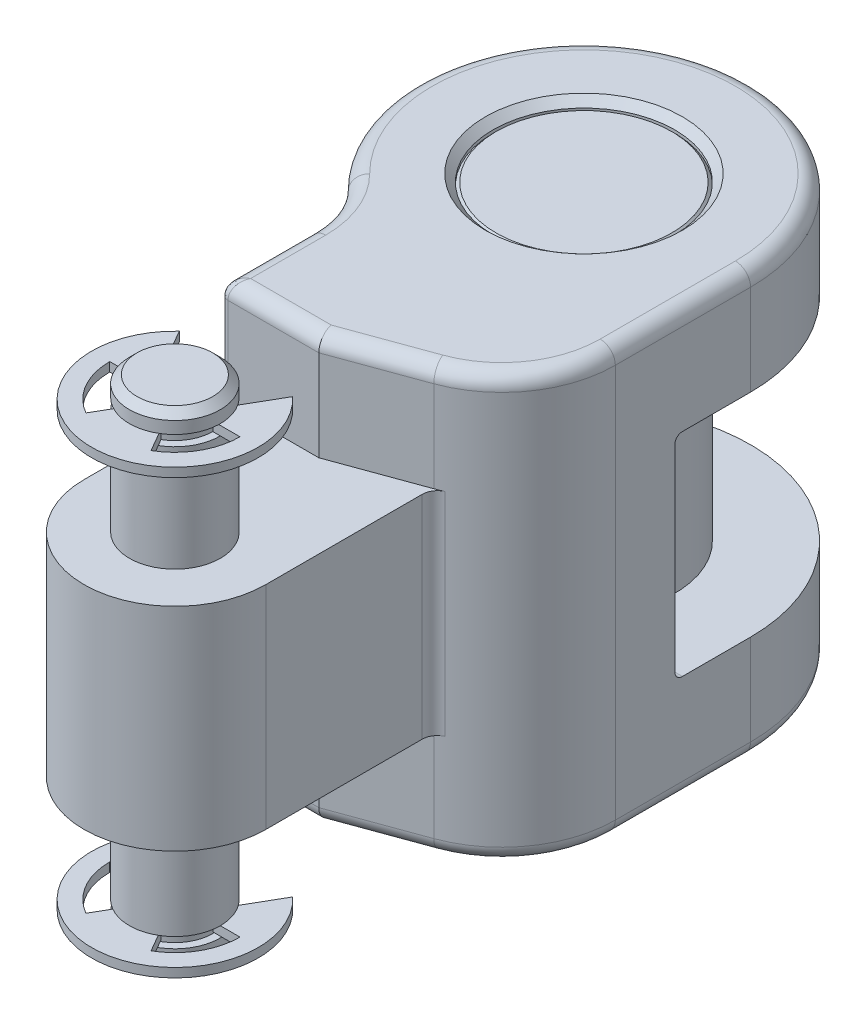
ISO-10303-21;
HEADER;
FILE_DESCRIPTION(('STEP AP214'),'2;1');
FILE_NAME('part.step','',(''),(''),'','','');
FILE_SCHEMA(('AUTOMOTIVE_DESIGN { 1 0 10303 214 1 1 1 1 }'));
ENDSEC;
DATA;
#1=APPLICATION_CONTEXT('core data for automotive mechanical design processes');
#2=APPLICATION_PROTOCOL_DEFINITION('international standard','automotive_design',2000,#1);
#3=PRODUCT_CONTEXT('',#1,'mechanical');
#4=PRODUCT('Part','Part','',(#3));
#5=PRODUCT_RELATED_PRODUCT_CATEGORY('part','',(#4));
#6=PRODUCT_DEFINITION_FORMATION('','',#4);
#7=PRODUCT_DEFINITION_CONTEXT('part definition',#1,'design');
#8=PRODUCT_DEFINITION('design','',#6,#7);
#9=PRODUCT_DEFINITION_SHAPE('','',#8);
#10=(LENGTH_UNIT() NAMED_UNIT(*) SI_UNIT(.MILLI.,.METRE.));
#11=(NAMED_UNIT(*) PLANE_ANGLE_UNIT() SI_UNIT($,.RADIAN.));
#12=(NAMED_UNIT(*) SI_UNIT($,.STERADIAN.) SOLID_ANGLE_UNIT());
#13=UNCERTAINTY_MEASURE_WITH_UNIT(LENGTH_MEASURE(1.E-05),#10,'distance_accuracy_value','');
#14=(GEOMETRIC_REPRESENTATION_CONTEXT(3) GLOBAL_UNCERTAINTY_ASSIGNED_CONTEXT((#13)) GLOBAL_UNIT_ASSIGNED_CONTEXT((#10,
#11,#12)) REPRESENTATION_CONTEXT('',''));
#15=CARTESIAN_POINT('',(0.,0.,0.));
#16=DIRECTION('',(0.,0.,1.));
#17=DIRECTION('',(1.,0.,0.));
#18=AXIS2_PLACEMENT_3D('',#15,#16,#17);
#19=CARTESIAN_POINT('',(0.,-14.6,27.));
#20=DIRECTION('',(0.,0.999999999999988,0.));
#21=DIRECTION('',(-1.,0.,0.));
#22=AXIS2_PLACEMENT_3D('',#19,#20,#21);
#23=PLANE('',#22);
#24=DIRECTION('',(0.5,0.,0.866025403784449));
#25=VECTOR('',#24,1.);
#26=CARTESIAN_POINT('',(-2.15,-14.6,25.7242649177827));
#27=LINE('',#26,#25);
#28=CARTESIAN_POINT('',(-3.74111693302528,-14.6,22.9683695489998));
#29=VERTEX_POINT('',#28);
#30=CARTESIAN_POINT('',(-2.15,-14.6,25.7242649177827));
#31=VERTEX_POINT('',#30);
#32=EDGE_CURVE('E1097',#29,#31,#27,.T.);
#33=ORIENTED_EDGE('',*,*,#32,.T.);
#34=CARTESIAN_POINT('',(0.,-14.6,27.));
#35=DIRECTION('',(0.,0.999999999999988,0.));
#36=DIRECTION('',(1.,0.,0.));
#37=AXIS2_PLACEMENT_3D('',#34,#35,#36);
#38=CIRCLE('',#37,2.5);
#39=CARTESIAN_POINT('',(-2.5,-14.6,27.));
#40=VERTEX_POINT('',#39);
#41=EDGE_CURVE('E1100',#31,#40,#38,.T.);
#42=ORIENTED_EDGE('',*,*,#41,.T.);
#43=DIRECTION('',(-1.,0.,0.));
#44=VECTOR('',#43,1.);
#45=CARTESIAN_POINT('',(-2.5,-14.6,27.));
#46=LINE('',#45,#44);
#47=CARTESIAN_POINT('',(-4.3,-14.6,27.));
#48=VERTEX_POINT('',#47);
#49=EDGE_CURVE('E1128',#40,#48,#46,.T.);
#50=ORIENTED_EDGE('',*,*,#49,.T.);
#51=CARTESIAN_POINT('',(0.,-14.6,27.));
#52=DIRECTION('',(0.,0.999999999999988,0.));
#53=DIRECTION('',(1.,0.,0.));
#54=AXIS2_PLACEMENT_3D('',#51,#52,#53);
#55=CIRCLE('',#54,4.3);
#56=CARTESIAN_POINT('',(-2.14999992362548,-14.6,30.7239092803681));
#57=VERTEX_POINT('',#56);
#58=EDGE_CURVE('E1125',#48,#57,#55,.T.);
#59=ORIENTED_EDGE('',*,*,#58,.T.);
#60=DIRECTION('',(0.500000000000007,0.,-0.86602540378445));
#61=VECTOR('',#60,1.);
#62=CARTESIAN_POINT('',(-2.14999992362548,-14.6,30.7239092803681));
#63=LINE('',#62,#61);
#64=CARTESIAN_POINT('',(-1.24999992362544,-14.6,29.1650635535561));
#65=VERTEX_POINT('',#64);
#66=EDGE_CURVE('E1122',#57,#65,#63,.T.);
#67=ORIENTED_EDGE('',*,*,#66,.T.);
#68=CARTESIAN_POINT('',(0.,-14.6,27.));
#69=DIRECTION('',(0.,0.999999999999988,0.));
#70=DIRECTION('',(1.,0.,0.));
#71=AXIS2_PLACEMENT_3D('',#68,#69,#70);
#72=CIRCLE('',#71,2.5);
#73=CARTESIAN_POINT('',(1.24999992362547,-14.6,29.165063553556));
#74=VERTEX_POINT('',#73);
#75=EDGE_CURVE('E1119',#65,#74,#72,.T.);
#76=ORIENTED_EDGE('',*,*,#75,.T.);
#77=DIRECTION('',(0.5,0.,0.86602540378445));
#78=VECTOR('',#77,1.);
#79=CARTESIAN_POINT('',(1.24999992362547,-14.6,29.165063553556));
#80=LINE('',#79,#78);
#81=CARTESIAN_POINT('',(2.14999992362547,-14.6,30.7239092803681));
#82=VERTEX_POINT('',#81);
#83=EDGE_CURVE('E1116',#74,#82,#80,.T.);
#84=ORIENTED_EDGE('',*,*,#83,.T.);
#85=CARTESIAN_POINT('',(0.,-14.6,27.));
#86=DIRECTION('',(0.,0.999999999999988,0.));
#87=DIRECTION('',(-1.,0.,0.));
#88=AXIS2_PLACEMENT_3D('',#85,#86,#87);
#89=CIRCLE('',#88,4.3);
#90=CARTESIAN_POINT('',(4.30000000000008,-14.6,27.));
#91=VERTEX_POINT('',#90);
#92=EDGE_CURVE('E1113',#82,#91,#89,.T.);
#93=ORIENTED_EDGE('',*,*,#92,.T.);
#94=DIRECTION('',(-1.,0.,0.));
#95=VECTOR('',#94,1.);
#96=CARTESIAN_POINT('',(4.30000000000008,-14.6,27.));
#97=LINE('',#96,#95);
#98=CARTESIAN_POINT('',(2.5,-14.6,27.));
#99=VERTEX_POINT('',#98);
#100=EDGE_CURVE('E1110',#91,#99,#97,.T.);
#101=ORIENTED_EDGE('',*,*,#100,.T.);
#102=CARTESIAN_POINT('',(0.,-14.6,27.));
#103=DIRECTION('',(0.,0.999999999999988,0.));
#104=DIRECTION('',(1.,0.,0.));
#105=AXIS2_PLACEMENT_3D('',#102,#103,#104);
#106=CIRCLE('',#105,2.5);
#107=CARTESIAN_POINT('',(2.15000000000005,-14.6,25.7242649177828));
#108=VERTEX_POINT('',#107);
#109=EDGE_CURVE('E1107',#99,#108,#106,.T.);
#110=ORIENTED_EDGE('',*,*,#109,.T.);
#111=DIRECTION('',(0.500000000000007,0.,-0.866025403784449));
#112=VECTOR('',#111,1.);
#113=CARTESIAN_POINT('',(2.15000000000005,-14.6,25.7242649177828));
#114=LINE('',#113,#112);
#115=CARTESIAN_POINT('',(3.74111693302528,-14.6,22.9683695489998));
#116=VERTEX_POINT('',#115);
#117=EDGE_CURVE('E1104',#108,#116,#114,.T.);
#118=ORIENTED_EDGE('',*,*,#117,.T.);
#119=CARTESIAN_POINT('',(0.,-14.6,27.));
#120=DIRECTION('',(0.,-0.999999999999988,0.));
#121=DIRECTION('',(0.,0.,-1.));
#122=AXIS2_PLACEMENT_3D('',#119,#120,#121);
#123=CIRCLE('',#122,5.5);
#124=EDGE_CURVE('E1096',#116,#29,#123,.T.);
#125=ORIENTED_EDGE('',*,*,#124,.T.);
#126=EDGE_LOOP('',(#33,#42,#50,#59,#67,#76,#84,#93,#101,#110,#118,#125));
#127=FACE_BOUND('',#126,.T.);
#128=ADVANCED_FACE('F14',(#127),#23,.F.);
#129=CARTESIAN_POINT('',(0.,-14.6,27.));
#130=DIRECTION('',(0.,0.999999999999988,0.));
#131=DIRECTION('',(-1.,0.,0.));
#132=AXIS2_PLACEMENT_3D('',#129,#130,#131);
#133=CYLINDRICAL_SURFACE('',#132,4.3);
#134=CARTESIAN_POINT('',(0.,-14.,27.));
#135=DIRECTION('',(0.,0.999999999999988,0.));
#136=DIRECTION('',(-1.,0.,0.));
#137=AXIS2_PLACEMENT_3D('',#134,#135,#136);
#138=CIRCLE('',#137,4.3);
#139=CARTESIAN_POINT('',(2.14999992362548,-14.,30.7239092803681));
#140=VERTEX_POINT('',#139);
#141=CARTESIAN_POINT('',(4.30000000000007,-14.,27.));
#142=VERTEX_POINT('',#141);
#143=EDGE_CURVE('E1152',#140,#142,#138,.T.);
#144=ORIENTED_EDGE('',*,*,#143,.T.);
#145=DIRECTION('',(0.,0.999999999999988,0.));
#146=VECTOR('',#145,1.);
#147=CARTESIAN_POINT('',(4.30000000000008,-14.6,27.));
#148=LINE('',#147,#146);
#149=EDGE_CURVE('E1081',#91,#142,#148,.T.);
#150=ORIENTED_EDGE('',*,*,#149,.F.);
#151=ORIENTED_EDGE('',*,*,#92,.F.);
#152=DIRECTION('',(0.,0.999999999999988,0.));
#153=VECTOR('',#152,1.);
#154=CARTESIAN_POINT('',(2.14999992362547,-14.6,30.7239092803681));
#155=LINE('',#154,#153);
#156=EDGE_CURVE('E1078',#82,#140,#155,.T.);
#157=ORIENTED_EDGE('',*,*,#156,.T.);
#158=EDGE_LOOP('',(#144,#150,#151,#157));
#159=FACE_BOUND('',#158,.T.);
#160=ADVANCED_FACE('F1443',(#159),#133,.F.);
#161=CARTESIAN_POINT('',(4.30000000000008,-14.6,27.));
#162=DIRECTION('',(0.,0.,-1.));
#163=DIRECTION('',(1.,0.,0.));
#164=AXIS2_PLACEMENT_3D('',#161,#162,#163);
#165=PLANE('',#164);
#166=DIRECTION('',(-1.,0.,0.));
#167=VECTOR('',#166,1.);
#168=CARTESIAN_POINT('',(4.30000000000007,-14.,27.));
#169=LINE('',#168,#167);
#170=CARTESIAN_POINT('',(3.,-14.,27.));
#171=VERTEX_POINT('',#170);
#172=EDGE_CURVE('E1147',#142,#171,#169,.T.);
#173=ORIENTED_EDGE('',*,*,#172,.T.);
#174=CARTESIAN_POINT('',(2.50000000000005,-14.,27.));
#175=VERTEX_POINT('',#174);
#176=EDGE_CURVE('E1151',#171,#175,#169,.T.);
#177=ORIENTED_EDGE('',*,*,#176,.T.);
#178=DIRECTION('',(0.,0.999999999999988,0.));
#179=VECTOR('',#178,1.);
#180=CARTESIAN_POINT('',(2.5,-14.6,27.));
#181=LINE('',#180,#179);
#182=EDGE_CURVE('E1084',#99,#175,#181,.T.);
#183=ORIENTED_EDGE('',*,*,#182,.F.);
#184=ORIENTED_EDGE('',*,*,#100,.F.);
#185=ORIENTED_EDGE('',*,*,#149,.T.);
#186=EDGE_LOOP('',(#173,#177,#183,#184,#185));
#187=FACE_BOUND('',#186,.T.);
#188=ADVANCED_FACE('F1449',(#187),#165,.F.);
#189=CARTESIAN_POINT('',(2.15000000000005,-14.6,25.7242649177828));
#190=DIRECTION('',(0.866025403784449,0.,0.500000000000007));
#191=DIRECTION('',(-0.500000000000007,0.,0.866025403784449));
#192=AXIS2_PLACEMENT_3D('',#189,#190,#191);
#193=PLANE('',#192);
#194=DIRECTION('',(0.500000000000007,0.,-0.866025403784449));
#195=VECTOR('',#194,1.);
#196=CARTESIAN_POINT('',(2.15000000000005,-14.,25.7242649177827));
#197=LINE('',#196,#195);
#198=CARTESIAN_POINT('',(2.15000000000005,-14.,25.7242649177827));
#199=VERTEX_POINT('',#198);
#200=CARTESIAN_POINT('',(2.4295439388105,-14.,25.2400806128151));
#201=VERTEX_POINT('',#200);
#202=EDGE_CURVE('E1142',#199,#201,#197,.T.);
#203=ORIENTED_EDGE('',*,*,#202,.T.);
#204=CARTESIAN_POINT('',(3.74111693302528,-14.,22.9683695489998));
#205=VERTEX_POINT('',#204);
#206=EDGE_CURVE('E1146',#201,#205,#197,.T.);
#207=ORIENTED_EDGE('',*,*,#206,.T.);
#208=DIRECTION('',(0.,0.999999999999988,0.));
#209=VECTOR('',#208,1.);
#210=CARTESIAN_POINT('',(3.74111693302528,-14.6,22.9683695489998));
#211=LINE('',#210,#209);
#212=EDGE_CURVE('E1090',#116,#205,#211,.T.);
#213=ORIENTED_EDGE('',*,*,#212,.F.);
#214=ORIENTED_EDGE('',*,*,#117,.F.);
#215=DIRECTION('',(0.,0.999999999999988,0.));
#216=VECTOR('',#215,1.);
#217=CARTESIAN_POINT('',(2.15000000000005,-14.6,25.7242649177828));
#218=LINE('',#217,#216);
#219=EDGE_CURVE('E1087',#108,#199,#218,.T.);
#220=ORIENTED_EDGE('',*,*,#219,.T.);
#221=EDGE_LOOP('',(#203,#207,#213,#214,#220));
#222=FACE_BOUND('',#221,.T.);
#223=ADVANCED_FACE('F1458',(#222),#193,.F.);
#224=CARTESIAN_POINT('',(0.,-14.6,27.));
#225=DIRECTION('',(0.,0.999999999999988,0.));
#226=DIRECTION('',(-1.,0.,0.));
#227=AXIS2_PLACEMENT_3D('',#224,#225,#226);
#228=CYLINDRICAL_SURFACE('',#227,5.5);
#229=CARTESIAN_POINT('',(0.,-14.,27.));
#230=DIRECTION('',(0.,-0.999999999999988,0.));
#231=DIRECTION('',(0.,0.,-1.));
#232=AXIS2_PLACEMENT_3D('',#229,#230,#231);
#233=CIRCLE('',#232,5.5);
#234=CARTESIAN_POINT('',(-3.74111693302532,-14.,22.9683695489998));
#235=VERTEX_POINT('',#234);
#236=EDGE_CURVE('E1101',#205,#235,#233,.T.);
#237=ORIENTED_EDGE('',*,*,#236,.T.);
#238=DIRECTION('',(0.,0.999999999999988,0.));
#239=VECTOR('',#238,1.);
#240=CARTESIAN_POINT('',(-3.74111693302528,-14.6,22.9683695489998));
#241=LINE('',#240,#239);
#242=EDGE_CURVE('E1093',#29,#235,#241,.T.);
#243=ORIENTED_EDGE('',*,*,#242,.F.);
#244=ORIENTED_EDGE('',*,*,#124,.F.);
#245=ORIENTED_EDGE('',*,*,#212,.T.);
#246=EDGE_LOOP('',(#237,#243,#244,#245));
#247=FACE_BOUND('',#246,.T.);
#248=ADVANCED_FACE('F1454',(#247),#228,.T.);
#249=CARTESIAN_POINT('',(-2.15,-14.6,25.7242649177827));
#250=DIRECTION('',(-0.866025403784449,0.,0.5));
#251=DIRECTION('',(-0.5,0.,-0.86602540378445));
#252=AXIS2_PLACEMENT_3D('',#249,#250,#251);
#253=PLANE('',#252);
#254=DIRECTION('',(0.5,0.,0.866025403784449));
#255=VECTOR('',#254,1.);
#256=CARTESIAN_POINT('',(-2.15000000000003,-14.,25.7242649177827));
#257=LINE('',#256,#255);
#258=CARTESIAN_POINT('',(-2.42954393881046,-14.,25.2400806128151));
#259=VERTEX_POINT('',#258);
#260=EDGE_CURVE('E1133',#235,#259,#257,.T.);
#261=ORIENTED_EDGE('',*,*,#260,.T.);
#262=CARTESIAN_POINT('',(-2.15000000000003,-14.,25.7242649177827));
#263=VERTEX_POINT('',#262);
#264=EDGE_CURVE('E1138',#259,#263,#257,.T.);
#265=ORIENTED_EDGE('',*,*,#264,.T.);
#266=DIRECTION('',(0.,0.999999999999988,0.));
#267=VECTOR('',#266,1.);
#268=CARTESIAN_POINT('',(-2.15,-14.6,25.7242649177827));
#269=LINE('',#268,#267);
#270=EDGE_CURVE('E1061',#31,#263,#269,.T.);
#271=ORIENTED_EDGE('',*,*,#270,.F.);
#272=ORIENTED_EDGE('',*,*,#32,.F.);
#273=ORIENTED_EDGE('',*,*,#242,.T.);
#274=EDGE_LOOP('',(#261,#265,#271,#272,#273));
#275=FACE_BOUND('',#274,.T.);
#276=ADVANCED_FACE('F1457',(#275),#253,.F.);
#277=CARTESIAN_POINT('',(-2.5,-14.6,27.));
#278=DIRECTION('',(0.,0.,-1.));
#279=DIRECTION('',(0.,0.999999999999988,0.));
#280=AXIS2_PLACEMENT_3D('',#277,#278,#279);
#281=PLANE('',#280);
#282=DIRECTION('',(-1.,0.,0.));
#283=VECTOR('',#282,1.);
#284=CARTESIAN_POINT('',(-2.50000000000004,-14.,27.));
#285=LINE('',#284,#283);
#286=CARTESIAN_POINT('',(-2.50000000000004,-14.,27.));
#287=VERTEX_POINT('',#286);
#288=CARTESIAN_POINT('',(-3.,-14.,27.));
#289=VERTEX_POINT('',#288);
#290=EDGE_CURVE('E34',#287,#289,#285,.T.);
#291=ORIENTED_EDGE('',*,*,#290,.T.);
#292=CARTESIAN_POINT('',(-4.30000000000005,-14.,27.));
#293=VERTEX_POINT('',#292);
#294=EDGE_CURVE('E1137',#289,#293,#285,.T.);
#295=ORIENTED_EDGE('',*,*,#294,.T.);
#296=DIRECTION('',(0.,0.999999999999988,0.));
#297=VECTOR('',#296,1.);
#298=CARTESIAN_POINT('',(-4.3,-14.6,27.));
#299=LINE('',#298,#297);
#300=EDGE_CURVE('E1066',#48,#293,#299,.T.);
#301=ORIENTED_EDGE('',*,*,#300,.F.);
#302=ORIENTED_EDGE('',*,*,#49,.F.);
#303=DIRECTION('',(0.,0.999999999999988,0.));
#304=VECTOR('',#303,1.);
#305=CARTESIAN_POINT('',(-2.5,-14.6,27.));
#306=LINE('',#305,#304);
#307=EDGE_CURVE('E1064',#40,#287,#306,.T.);
#308=ORIENTED_EDGE('',*,*,#307,.T.);
#309=EDGE_LOOP('',(#291,#295,#301,#302,#308));
#310=FACE_BOUND('',#309,.T.);
#311=ADVANCED_FACE('F1183',(#310),#281,.F.);
#312=CARTESIAN_POINT('',(0.,-14.6,27.));
#313=DIRECTION('',(0.,0.999999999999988,0.));
#314=DIRECTION('',(-1.,0.,0.));
#315=AXIS2_PLACEMENT_3D('',#312,#313,#314);
#316=CYLINDRICAL_SURFACE('',#315,4.3);
#317=CARTESIAN_POINT('',(0.,-14.,27.));
#318=DIRECTION('',(0.,0.999999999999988,0.));
#319=DIRECTION('',(1.,0.,0.));
#320=AXIS2_PLACEMENT_3D('',#317,#318,#319);
#321=CIRCLE('',#320,4.3);
#322=CARTESIAN_POINT('',(-2.14999992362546,-14.0000000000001,30.723909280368));
#323=VERTEX_POINT('',#322);
#324=EDGE_CURVE('E1166',#293,#323,#321,.T.);
#325=ORIENTED_EDGE('',*,*,#324,.T.);
#326=DIRECTION('',(0.,0.999999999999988,0.));
#327=VECTOR('',#326,1.);
#328=CARTESIAN_POINT('',(-2.14999992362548,-14.6,30.7239092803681));
#329=LINE('',#328,#327);
#330=EDGE_CURVE('E1069',#57,#323,#329,.T.);
#331=ORIENTED_EDGE('',*,*,#330,.F.);
#332=ORIENTED_EDGE('',*,*,#58,.F.);
#333=ORIENTED_EDGE('',*,*,#300,.T.);
#334=EDGE_LOOP('',(#325,#331,#332,#333));
#335=FACE_BOUND('',#334,.T.);
#336=ADVANCED_FACE('F1194',(#335),#316,.F.);
#337=CARTESIAN_POINT('',(-2.14999992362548,-14.6,30.7239092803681));
#338=DIRECTION('',(0.86602540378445,0.,0.500000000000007));
#339=DIRECTION('',(-0.500000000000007,0.,0.86602540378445));
#340=AXIS2_PLACEMENT_3D('',#337,#338,#339);
#341=PLANE('',#340);
#342=DIRECTION('',(0.500000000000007,0.,-0.86602540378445));
#343=VECTOR('',#342,1.);
#344=CARTESIAN_POINT('',(-2.14999992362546,-14.0000000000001,30.723909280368));
#345=LINE('',#344,#343);
#346=CARTESIAN_POINT('',(-1.49999992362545,-14.,29.5980762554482));
#347=VERTEX_POINT('',#346);
#348=EDGE_CURVE('E1161',#323,#347,#345,.T.);
#349=ORIENTED_EDGE('',*,*,#348,.T.);
#350=CARTESIAN_POINT('',(-1.24999992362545,-14.0000000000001,29.1650635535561));
#351=VERTEX_POINT('',#350);
#352=EDGE_CURVE('E1165',#347,#351,#345,.T.);
#353=ORIENTED_EDGE('',*,*,#352,.T.);
#354=DIRECTION('',(0.,0.999999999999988,0.));
#355=VECTOR('',#354,1.);
#356=CARTESIAN_POINT('',(-1.24999992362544,-14.6,29.1650635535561));
#357=LINE('',#356,#355);
#358=EDGE_CURVE('E1072',#65,#351,#357,.T.);
#359=ORIENTED_EDGE('',*,*,#358,.F.);
#360=ORIENTED_EDGE('',*,*,#66,.F.);
#361=ORIENTED_EDGE('',*,*,#330,.T.);
#362=EDGE_LOOP('',(#349,#353,#359,#360,#361));
#363=FACE_BOUND('',#362,.T.);
#364=ADVANCED_FACE('F1205',(#363),#341,.F.);
#365=CARTESIAN_POINT('',(1.24999992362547,-14.6,29.165063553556));
#366=DIRECTION('',(-0.86602540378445,0.,0.5));
#367=DIRECTION('',(-0.5,0.,-0.86602540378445));
#368=AXIS2_PLACEMENT_3D('',#365,#366,#367);
#369=PLANE('',#368);
#370=DIRECTION('',(0.5,0.,0.86602540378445));
#371=VECTOR('',#370,1.);
#372=CARTESIAN_POINT('',(1.24999992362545,-14.,29.165063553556));
#373=LINE('',#372,#371);
#374=CARTESIAN_POINT('',(1.24999992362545,-14.,29.165063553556));
#375=VERTEX_POINT('',#374);
#376=CARTESIAN_POINT('',(1.49999992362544,-14.,29.5980762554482));
#377=VERTEX_POINT('',#376);
#378=EDGE_CURVE('E1156',#375,#377,#373,.T.);
#379=ORIENTED_EDGE('',*,*,#378,.T.);
#380=EDGE_CURVE('E1160',#377,#140,#373,.T.);
#381=ORIENTED_EDGE('',*,*,#380,.T.);
#382=ORIENTED_EDGE('',*,*,#156,.F.);
#383=ORIENTED_EDGE('',*,*,#83,.F.);
#384=DIRECTION('',(0.,0.999999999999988,0.));
#385=VECTOR('',#384,1.);
#386=CARTESIAN_POINT('',(1.24999992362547,-14.6,29.165063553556));
#387=LINE('',#386,#385);
#388=EDGE_CURVE('E1075',#74,#375,#387,.T.);
#389=ORIENTED_EDGE('',*,*,#388,.T.);
#390=EDGE_LOOP('',(#379,#381,#382,#383,#389));
#391=FACE_BOUND('',#390,.T.);
#392=ADVANCED_FACE('F1243',(#391),#369,.F.);
#393=CARTESIAN_POINT('',(0.,-14.,27.));
#394=DIRECTION('',(0.,0.999999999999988,0.));
#395=DIRECTION('',(-1.,0.,0.));
#396=AXIS2_PLACEMENT_3D('',#393,#394,#395);
#397=PLANE('',#396);
#398=ORIENTED_EDGE('',*,*,#380,.F.);
#399=CARTESIAN_POINT('',(0.,-14.,27.));
#400=DIRECTION('',(0.,0.999999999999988,0.));
#401=DIRECTION('',(1.,0.,0.));
#402=AXIS2_PLACEMENT_3D('',#399,#400,#401);
#403=CIRCLE('',#402,3.);
#404=EDGE_CURVE('E9',#377,#347,#403,.F.);
#405=ORIENTED_EDGE('',*,*,#404,.T.);
#406=ORIENTED_EDGE('',*,*,#348,.F.);
#407=ORIENTED_EDGE('',*,*,#324,.F.);
#408=ORIENTED_EDGE('',*,*,#294,.F.);
#409=EDGE_CURVE('E24',#289,#259,#403,.F.);
#410=ORIENTED_EDGE('',*,*,#409,.T.);
#411=ORIENTED_EDGE('',*,*,#260,.F.);
#412=ORIENTED_EDGE('',*,*,#236,.F.);
#413=ORIENTED_EDGE('',*,*,#206,.F.);
#414=EDGE_CURVE('E26',#201,#171,#403,.F.);
#415=ORIENTED_EDGE('',*,*,#414,.T.);
#416=ORIENTED_EDGE('',*,*,#172,.F.);
#417=ORIENTED_EDGE('',*,*,#143,.F.);
#418=EDGE_LOOP('',(#398,#405,#406,#407,#408,#410,#411,#412,#413,#415,#416,#417));
#419=FACE_BOUND('',#418,.T.);
#420=ADVANCED_FACE('F1198',(#419),#397,.T.);
#421=CARTESIAN_POINT('',(0.,16.,27.));
#422=DIRECTION('',(0.,1.,0.));
#423=DIRECTION('',(0.,0.,1.));
#424=AXIS2_PLACEMENT_3D('',#421,#422,#423);
#425=PLANE('',#424);
#426=CARTESIAN_POINT('',(0.,16.,27.));
#427=DIRECTION('',(0.,1.,0.));
#428=DIRECTION('',(0.,0.,1.));
#429=AXIS2_PLACEMENT_3D('',#426,#427,#428);
#430=CIRCLE('',#429,2.5);
#431=CARTESIAN_POINT('',(0.,16.,29.5));
#432=VERTEX_POINT('',#431);
#433=EDGE_CURVE('E915',#432,#432,#430,.T.);
#434=ORIENTED_EDGE('',*,*,#433,.T.);
#435=EDGE_LOOP('',(#434));
#436=FACE_BOUND('',#435,.T.);
#437=ADVANCED_FACE('F1671',(#436),#425,.T.);
#438=CARTESIAN_POINT('',(0.,16.,27.));
#439=DIRECTION('',(0.,-1.,0.));
#440=DIRECTION('',(0.,0.,-1.));
#441=AXIS2_PLACEMENT_3D('',#438,#439,#440);
#442=CONICAL_SURFACE('',#441,2.5,0.785398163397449);
#443=CARTESIAN_POINT('',(0.,15.5,27.));
#444=DIRECTION('',(0.,1.,0.));
#445=DIRECTION('',(0.,0.,1.));
#446=AXIS2_PLACEMENT_3D('',#443,#444,#445);
#447=CIRCLE('',#446,3.);
#448=CARTESIAN_POINT('',(0.,15.5,30.));
#449=VERTEX_POINT('',#448);
#450=EDGE_CURVE('E924',#449,#449,#447,.F.);
#451=ORIENTED_EDGE('',*,*,#450,.F.);
#452=EDGE_LOOP('',(#451));
#453=FACE_BOUND('',#452,.T.);
#454=ORIENTED_EDGE('',*,*,#433,.F.);
#455=EDGE_LOOP('',(#454));
#456=FACE_BOUND('',#455,.T.);
#457=ADVANCED_FACE('F1724',(#453,#456),#442,.T.);
#458=CARTESIAN_POINT('',(0.,13.5,0.));
#459=DIRECTION('',(0.,1.,0.));
#460=DIRECTION('',(-1.,0.,0.));
#461=AXIS2_PLACEMENT_3D('',#458,#459,#460);
#462=PLANE('',#461);
#463=CARTESIAN_POINT('',(0.,13.5,0.));
#464=DIRECTION('',(0.,1.,0.));
#465=DIRECTION('',(-1.,0.,0.));
#466=AXIS2_PLACEMENT_3D('',#463,#464,#465);
#467=CIRCLE('',#466,5.8);
#468=CARTESIAN_POINT('',(-5.80000000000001,13.5,0.));
#469=VERTEX_POINT('',#468);
#470=EDGE_CURVE('E893',#469,#469,#467,.T.);
#471=ORIENTED_EDGE('',*,*,#470,.T.);
#472=EDGE_LOOP('',(#471));
#473=FACE_BOUND('',#472,.T.);
#474=ADVANCED_FACE('F1732',(#473),#462,.T.);
#475=CARTESIAN_POINT('',(0.,-13.5,0.));
#476=DIRECTION('',(0.,1.,0.));
#477=DIRECTION('',(-1.,0.,0.));
#478=AXIS2_PLACEMENT_3D('',#475,#476,#477);
#479=PLANE('',#478);
#480=CARTESIAN_POINT('',(0.,-13.5,0.));
#481=DIRECTION('',(0.,1.,0.));
#482=DIRECTION('',(-1.,0.,0.));
#483=AXIS2_PLACEMENT_3D('',#480,#481,#482);
#484=CIRCLE('',#483,5.8);
#485=CARTESIAN_POINT('',(-5.80000000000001,-13.5,0.));
#486=VERTEX_POINT('',#485);
#487=EDGE_CURVE('E897',#486,#486,#484,.F.);
#488=ORIENTED_EDGE('',*,*,#487,.T.);
#489=EDGE_LOOP('',(#488));
#490=FACE_BOUND('',#489,.T.);
#491=ADVANCED_FACE('F1741',(#490),#479,.F.);
#492=CARTESIAN_POINT('',(0.,16.,27.));
#493=DIRECTION('',(0.,-1.,0.));
#494=DIRECTION('',(0.,0.,-1.));
#495=AXIS2_PLACEMENT_3D('',#492,#493,#494);
#496=CYLINDRICAL_SURFACE('',#495,3.);
#497=ORIENTED_EDGE('',*,*,#450,.T.);
#498=EDGE_LOOP('',(#497));
#499=FACE_BOUND('',#498,.T.);
#500=CARTESIAN_POINT('',(0.,14.7,27.));
#501=DIRECTION('',(0.,-1.,0.));
#502=DIRECTION('',(0.,0.,-1.));
#503=AXIS2_PLACEMENT_3D('',#500,#501,#502);
#504=CIRCLE('',#503,3.);
#505=CARTESIAN_POINT('',(0.,14.7,24.));
#506=VERTEX_POINT('',#505);
#507=EDGE_CURVE('E935',#506,#506,#504,.T.);
#508=ORIENTED_EDGE('',*,*,#507,.F.);
#509=EDGE_LOOP('',(#508));
#510=FACE_BOUND('',#509,.T.);
#511=ADVANCED_FACE('F1440',(#499,#510),#496,.T.);
#512=CARTESIAN_POINT('',(0.,13.5,0.));
#513=DIRECTION('',(0.,-1.,0.));
#514=DIRECTION('',(1.,0.,0.));
#515=AXIS2_PLACEMENT_3D('',#512,#513,#514);
#516=CONICAL_SURFACE('',#515,5.8,0.785398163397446);
#517=CARTESIAN_POINT('',(0.,13.3,0.));
#518=DIRECTION('',(0.,1.,0.));
#519=DIRECTION('',(-1.,0.,0.));
#520=AXIS2_PLACEMENT_3D('',#517,#518,#519);
#521=CIRCLE('',#520,6.);
#522=CARTESIAN_POINT('',(-6.00000000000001,13.3,0.));
#523=VERTEX_POINT('',#522);
#524=EDGE_CURVE('E386',#523,#523,#521,.F.);
#525=ORIENTED_EDGE('',*,*,#524,.F.);
#526=EDGE_LOOP('',(#525));
#527=FACE_BOUND('',#526,.T.);
#528=ORIENTED_EDGE('',*,*,#470,.F.);
#529=EDGE_LOOP('',(#528));
#530=FACE_BOUND('',#529,.T.);
#531=ADVANCED_FACE('F1743',(#527,#530),#516,.T.);
#532=CARTESIAN_POINT('',(0.,-13.3,0.));
#533=DIRECTION('',(0.,1.,0.));
#534=DIRECTION('',(-1.,0.,0.));
#535=AXIS2_PLACEMENT_3D('',#532,#533,#534);
#536=CONICAL_SURFACE('',#535,6.,0.785398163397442);
#537=ORIENTED_EDGE('',*,*,#487,.F.);
#538=EDGE_LOOP('',(#537));
#539=FACE_BOUND('',#538,.T.);
#540=CARTESIAN_POINT('',(0.,-13.3,0.));
#541=DIRECTION('',(0.,1.,0.));
#542=DIRECTION('',(-1.,0.,0.));
#543=AXIS2_PLACEMENT_3D('',#540,#541,#542);
#544=CIRCLE('',#543,6.);
#545=CARTESIAN_POINT('',(-6.00000000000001,-13.3,0.));
#546=VERTEX_POINT('',#545);
#547=EDGE_CURVE('E901',#546,#546,#544,.T.);
#548=ORIENTED_EDGE('',*,*,#547,.F.);
#549=EDGE_LOOP('',(#548));
#550=FACE_BOUND('',#549,.T.);
#551=ADVANCED_FACE('F1753',(#539,#550),#536,.T.);
#552=CARTESIAN_POINT('',(3.,14.7,27.));
#553=DIRECTION('',(0.,-1.,0.));
#554=DIRECTION('',(0.,0.,-1.));
#555=AXIS2_PLACEMENT_3D('',#552,#553,#554);
#556=PLANE('',#555);
#557=ORIENTED_EDGE('',*,*,#507,.T.);
#558=EDGE_LOOP('',(#557));
#559=FACE_BOUND('',#558,.T.);
#560=CARTESIAN_POINT('',(0.,14.7,27.));
#561=DIRECTION('',(0.,-1.,0.));
#562=DIRECTION('',(0.,0.,-1.));
#563=AXIS2_PLACEMENT_3D('',#560,#561,#562);
#564=CIRCLE('',#563,2.5);
#565=CARTESIAN_POINT('',(0.,14.7,24.5));
#566=VERTEX_POINT('',#565);
#567=EDGE_CURVE('E932',#566,#566,#564,.T.);
#568=ORIENTED_EDGE('',*,*,#567,.F.);
#569=EDGE_LOOP('',(#568));
#570=FACE_BOUND('',#569,.T.);
#571=ADVANCED_FACE('F1479',(#559,#570),#556,.T.);
#572=CARTESIAN_POINT('',(0.,14.6,27.));
#573=DIRECTION('',(0.,0.999999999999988,0.));
#574=DIRECTION('',(-1.,0.,0.));
#575=AXIS2_PLACEMENT_3D('',#572,#573,#574);
#576=PLANE('',#575);
#577=DIRECTION('',(0.5,0.,0.866025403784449));
#578=VECTOR('',#577,1.);
#579=CARTESIAN_POINT('',(-2.15000000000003,14.6,25.7242649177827));
#580=LINE('',#579,#578);
#581=CARTESIAN_POINT('',(-3.74111693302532,14.6,22.9683695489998));
#582=VERTEX_POINT('',#581);
#583=CARTESIAN_POINT('',(-2.15000000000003,14.6,25.7242649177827));
#584=VERTEX_POINT('',#583);
#585=EDGE_CURVE('E911',#582,#584,#580,.T.);
#586=ORIENTED_EDGE('',*,*,#585,.F.);
#587=CARTESIAN_POINT('',(0.,14.6,27.));
#588=DIRECTION('',(0.,-0.999999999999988,0.));
#589=DIRECTION('',(0.,0.,-1.));
#590=AXIS2_PLACEMENT_3D('',#587,#588,#589);
#591=CIRCLE('',#590,5.5);
#592=CARTESIAN_POINT('',(3.74111693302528,14.6,22.9683695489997));
#593=VERTEX_POINT('',#592);
#594=EDGE_CURVE('E1023',#593,#582,#591,.T.);
#595=ORIENTED_EDGE('',*,*,#594,.F.);
#596=DIRECTION('',(0.500000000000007,0.,-0.866025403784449));
#597=VECTOR('',#596,1.);
#598=CARTESIAN_POINT('',(2.15000000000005,14.6,25.7242649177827));
#599=LINE('',#598,#597);
#600=CARTESIAN_POINT('',(2.15000000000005,14.6,25.7242649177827));
#601=VERTEX_POINT('',#600);
#602=EDGE_CURVE('E1026',#601,#593,#599,.T.);
#603=ORIENTED_EDGE('',*,*,#602,.F.);
#604=CARTESIAN_POINT('',(0.,14.6,27.));
#605=DIRECTION('',(0.,0.999999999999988,0.));
#606=DIRECTION('',(1.,0.,0.));
#607=AXIS2_PLACEMENT_3D('',#604,#605,#606);
#608=CIRCLE('',#607,2.5);
#609=CARTESIAN_POINT('',(2.50000000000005,14.6,27.));
#610=VERTEX_POINT('',#609);
#611=EDGE_CURVE('E1029',#610,#601,#608,.T.);
#612=ORIENTED_EDGE('',*,*,#611,.F.);
#613=DIRECTION('',(-1.,0.,0.));
#614=VECTOR('',#613,1.);
#615=CARTESIAN_POINT('',(4.30000000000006,14.6,27.));
#616=LINE('',#615,#614);
#617=CARTESIAN_POINT('',(4.30000000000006,14.6,27.));
#618=VERTEX_POINT('',#617);
#619=EDGE_CURVE('E1033',#618,#610,#616,.T.);
#620=ORIENTED_EDGE('',*,*,#619,.F.);
#621=CARTESIAN_POINT('',(0.,14.6,27.));
#622=DIRECTION('',(0.,0.999999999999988,0.));
#623=DIRECTION('',(-1.,0.,0.));
#624=AXIS2_PLACEMENT_3D('',#621,#622,#623);
#625=CIRCLE('',#624,4.3);
#626=CARTESIAN_POINT('',(2.14999992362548,14.6,30.7239092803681));
#627=VERTEX_POINT('',#626);
#628=EDGE_CURVE('E1037',#627,#618,#625,.T.);
#629=ORIENTED_EDGE('',*,*,#628,.F.);
#630=DIRECTION('',(0.5,0.,0.86602540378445));
#631=VECTOR('',#630,1.);
#632=CARTESIAN_POINT('',(1.24999992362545,14.6,29.165063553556));
#633=LINE('',#632,#631);
#634=CARTESIAN_POINT('',(1.24999992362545,14.6,29.165063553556));
#635=VERTEX_POINT('',#634);
#636=EDGE_CURVE('E1040',#635,#627,#633,.T.);
#637=ORIENTED_EDGE('',*,*,#636,.F.);
#638=CARTESIAN_POINT('',(0.,14.6,27.));
#639=DIRECTION('',(0.,0.999999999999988,0.));
#640=DIRECTION('',(1.,0.,0.));
#641=AXIS2_PLACEMENT_3D('',#638,#639,#640);
#642=CIRCLE('',#641,2.5);
#643=CARTESIAN_POINT('',(-1.24999992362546,14.5999999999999,29.1650635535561));
#644=VERTEX_POINT('',#643);
#645=EDGE_CURVE('E1043',#644,#635,#642,.T.);
#646=ORIENTED_EDGE('',*,*,#645,.F.);
#647=DIRECTION('',(0.500000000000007,0.,-0.86602540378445));
#648=VECTOR('',#647,1.);
#649=CARTESIAN_POINT('',(-2.14999992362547,14.5999999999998,30.723909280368));
#650=LINE('',#649,#648);
#651=CARTESIAN_POINT('',(-2.14999992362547,14.5999999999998,30.723909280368));
#652=VERTEX_POINT('',#651);
#653=EDGE_CURVE('E1047',#652,#644,#650,.T.);
#654=ORIENTED_EDGE('',*,*,#653,.F.);
#655=CARTESIAN_POINT('',(0.,14.6,27.));
#656=DIRECTION('',(0.,0.999999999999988,0.));
#657=DIRECTION('',(1.,0.,0.));
#658=AXIS2_PLACEMENT_3D('',#655,#656,#657);
#659=CIRCLE('',#658,4.3);
#660=CARTESIAN_POINT('',(-4.30000000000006,14.6,27.));
#661=VERTEX_POINT('',#660);
#662=EDGE_CURVE('E1051',#661,#652,#659,.T.);
#663=ORIENTED_EDGE('',*,*,#662,.F.);
#664=DIRECTION('',(-1.,0.,0.));
#665=VECTOR('',#664,1.);
#666=CARTESIAN_POINT('',(-2.50000000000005,14.6,27.));
#667=LINE('',#666,#665);
#668=CARTESIAN_POINT('',(-2.50000000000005,14.6,27.));
#669=VERTEX_POINT('',#668);
#670=EDGE_CURVE('E1054',#669,#661,#667,.T.);
#671=ORIENTED_EDGE('',*,*,#670,.F.);
#672=CARTESIAN_POINT('',(0.,14.6,27.));
#673=DIRECTION('',(0.,0.999999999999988,0.));
#674=DIRECTION('',(1.,0.,0.));
#675=AXIS2_PLACEMENT_3D('',#672,#673,#674);
#676=CIRCLE('',#675,2.5);
#677=EDGE_CURVE('E1022',#584,#669,#676,.T.);
#678=ORIENTED_EDGE('',*,*,#677,.F.);
#679=EDGE_LOOP('',(#586,#595,#603,#612,#620,#629,#637,#646,#654,#663,#671,#678));
#680=FACE_BOUND('',#679,.T.);
#681=ADVANCED_FACE('F1401',(#680),#576,.T.);
#682=CARTESIAN_POINT('',(0.,-14.000025,0.));
#683=DIRECTION('',(0.,1.,0.));
#684=DIRECTION('',(-1.,0.,0.));
#685=AXIS2_PLACEMENT_3D('',#682,#683,#684);
#686=CYLINDRICAL_SURFACE('',#685,6.);
#687=ORIENTED_EDGE('',*,*,#524,.T.);
#688=EDGE_LOOP('',(#687));
#689=FACE_BOUND('',#688,.T.);
#690=CARTESIAN_POINT('',(0.,13.5,0.));
#691=DIRECTION('',(0.,-1.,0.));
#692=DIRECTION('',(1.,0.,0.));
#693=AXIS2_PLACEMENT_3D('',#690,#691,#692);
#694=CIRCLE('',#693,6.);
#695=CARTESIAN_POINT('',(6.,13.5,0.));
#696=VERTEX_POINT('',#695);
#697=EDGE_CURVE('E499',#696,#696,#694,.F.);
#698=ORIENTED_EDGE('',*,*,#697,.T.);
#699=EDGE_LOOP('',(#698));
#700=FACE_BOUND('',#699,.T.);
#701=ADVANCED_FACE('F1478',(#689,#700),#686,.F.);
#702=ORIENTED_EDGE('',*,*,#547,.T.);
#703=EDGE_LOOP('',(#702));
#704=FACE_BOUND('',#703,.T.);
#705=CARTESIAN_POINT('',(0.,-13.5,0.));
#706=DIRECTION('',(0.,1.,0.));
#707=DIRECTION('',(-1.,0.,0.));
#708=AXIS2_PLACEMENT_3D('',#705,#706,#707);
#709=CIRCLE('',#708,6.);
#710=CARTESIAN_POINT('',(-6.,-13.5,0.));
#711=VERTEX_POINT('',#710);
#712=EDGE_CURVE('E508',#711,#711,#709,.F.);
#713=ORIENTED_EDGE('',*,*,#712,.T.);
#714=EDGE_LOOP('',(#713));
#715=FACE_BOUND('',#714,.T.);
#716=ADVANCED_FACE('F1787',(#704,#715),#686,.F.);
#717=CARTESIAN_POINT('',(0.,0.,27.));
#718=DIRECTION('',(0.,-1.,0.));
#719=DIRECTION('',(0.,0.,-1.));
#720=AXIS2_PLACEMENT_3D('',#717,#718,#719);
#721=CYLINDRICAL_SURFACE('',#720,2.5);
#722=ORIENTED_EDGE('',*,*,#567,.T.);
#723=EDGE_LOOP('',(#722));
#724=FACE_BOUND('',#723,.T.);
#725=CARTESIAN_POINT('',(0.,14.,27.));
#726=DIRECTION('',(0.,-1.,0.));
#727=DIRECTION('',(0.,0.,-1.));
#728=AXIS2_PLACEMENT_3D('',#725,#726,#727);
#729=CIRCLE('',#728,2.5);
#730=CARTESIAN_POINT('',(2.5,14.,27.));
#731=VERTEX_POINT('',#730);
#732=CARTESIAN_POINT('',(1.24999992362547,14.,29.165063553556));
#733=VERTEX_POINT('',#732);
#734=EDGE_CURVE('E927',#731,#733,#729,.T.);
#735=ORIENTED_EDGE('',*,*,#734,.F.);
#736=DIRECTION('',(0.,0.999999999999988,0.));
#737=VECTOR('',#736,1.);
#738=CARTESIAN_POINT('',(2.5,14.,27.));
#739=LINE('',#738,#737);
#740=EDGE_CURVE('E979',#731,#610,#739,.T.);
#741=ORIENTED_EDGE('',*,*,#740,.T.);
#742=ORIENTED_EDGE('',*,*,#611,.T.);
#743=DIRECTION('',(0.,0.999999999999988,0.));
#744=VECTOR('',#743,1.);
#745=CARTESIAN_POINT('',(2.15000000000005,14.,25.7242649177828));
#746=LINE('',#745,#744);
#747=CARTESIAN_POINT('',(2.15000000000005,14.,25.7242649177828));
#748=VERTEX_POINT('',#747);
#749=EDGE_CURVE('E981',#748,#601,#746,.T.);
#750=ORIENTED_EDGE('',*,*,#749,.F.);
#751=CARTESIAN_POINT('',(-2.15,14.,25.7242649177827));
#752=VERTEX_POINT('',#751);
#753=EDGE_CURVE('E928',#752,#748,#729,.T.);
#754=ORIENTED_EDGE('',*,*,#753,.F.);
#755=DIRECTION('',(0.,0.999999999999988,0.));
#756=VECTOR('',#755,1.);
#757=CARTESIAN_POINT('',(-2.15,14.,25.7242649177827));
#758=LINE('',#757,#756);
#759=EDGE_CURVE('E959',#752,#584,#758,.T.);
#760=ORIENTED_EDGE('',*,*,#759,.T.);
#761=ORIENTED_EDGE('',*,*,#677,.T.);
#762=DIRECTION('',(0.,0.999999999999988,0.));
#763=VECTOR('',#762,1.);
#764=CARTESIAN_POINT('',(-2.5,14.,27.));
#765=LINE('',#764,#763);
#766=CARTESIAN_POINT('',(-2.5,14.,27.));
#767=VERTEX_POINT('',#766);
#768=EDGE_CURVE('E961',#767,#669,#765,.T.);
#769=ORIENTED_EDGE('',*,*,#768,.F.);
#770=CARTESIAN_POINT('',(-1.24999992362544,14.,29.1650635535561));
#771=VERTEX_POINT('',#770);
#772=EDGE_CURVE('E931',#771,#767,#729,.T.);
#773=ORIENTED_EDGE('',*,*,#772,.F.);
#774=DIRECTION('',(0.,0.999999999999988,0.));
#775=VECTOR('',#774,1.);
#776=CARTESIAN_POINT('',(-1.24999992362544,14.,29.1650635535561));
#777=LINE('',#776,#775);
#778=EDGE_CURVE('E969',#771,#644,#777,.T.);
#779=ORIENTED_EDGE('',*,*,#778,.T.);
#780=ORIENTED_EDGE('',*,*,#645,.T.);
#781=DIRECTION('',(0.,0.999999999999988,0.));
#782=VECTOR('',#781,1.);
#783=CARTESIAN_POINT('',(1.24999992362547,14.,29.165063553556));
#784=LINE('',#783,#782);
#785=EDGE_CURVE('E971',#733,#635,#784,.T.);
#786=ORIENTED_EDGE('',*,*,#785,.F.);
#787=EDGE_LOOP('',(#735,#741,#742,#750,#754,#760,#761,#769,#773,#779,#780,#786));
#788=FACE_BOUND('',#787,.T.);
#789=ADVANCED_FACE('F1386',(#724,#788),#721,.T.);
#790=CARTESIAN_POINT('',(4.30000000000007,14.,27.));
#791=DIRECTION('',(0.,0.,-1.));
#792=DIRECTION('',(1.,0.,0.));
#793=AXIS2_PLACEMENT_3D('',#790,#791,#792);
#794=PLANE('',#793);
#795=ORIENTED_EDGE('',*,*,#619,.T.);
#796=ORIENTED_EDGE('',*,*,#740,.F.);
#797=DIRECTION('',(-1.,0.,0.));
#798=VECTOR('',#797,1.);
#799=CARTESIAN_POINT('',(4.30000000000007,14.,27.));
#800=LINE('',#799,#798);
#801=CARTESIAN_POINT('',(3.,14.,27.));
#802=VERTEX_POINT('',#801);
#803=EDGE_CURVE('E1003',#802,#731,#800,.T.);
#804=ORIENTED_EDGE('',*,*,#803,.F.);
#805=CARTESIAN_POINT('',(4.30000000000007,14.,27.));
#806=VERTEX_POINT('',#805);
#807=EDGE_CURVE('E1000',#806,#802,#800,.T.);
#808=ORIENTED_EDGE('',*,*,#807,.F.);
#809=DIRECTION('',(0.,0.999999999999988,0.));
#810=VECTOR('',#809,1.);
#811=CARTESIAN_POINT('',(4.30000000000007,14.,27.));
#812=LINE('',#811,#810);
#813=EDGE_CURVE('E976',#806,#618,#812,.T.);
#814=ORIENTED_EDGE('',*,*,#813,.T.);
#815=EDGE_LOOP('',(#795,#796,#804,#808,#814));
#816=FACE_BOUND('',#815,.T.);
#817=ADVANCED_FACE('F1409',(#816),#794,.F.);
#818=CARTESIAN_POINT('',(0.,14.,27.));
#819=DIRECTION('',(0.,0.999999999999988,0.));
#820=DIRECTION('',(-1.,0.,0.));
#821=AXIS2_PLACEMENT_3D('',#818,#819,#820);
#822=CYLINDRICAL_SURFACE('',#821,4.3);
#823=ORIENTED_EDGE('',*,*,#628,.T.);
#824=ORIENTED_EDGE('',*,*,#813,.F.);
#825=CARTESIAN_POINT('',(0.,14.,27.));
#826=DIRECTION('',(0.,0.999999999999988,0.));
#827=DIRECTION('',(-1.,0.,0.));
#828=AXIS2_PLACEMENT_3D('',#825,#826,#827);
#829=CIRCLE('',#828,4.3);
#830=CARTESIAN_POINT('',(2.14999992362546,14.,30.7239092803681));
#831=VERTEX_POINT('',#830);
#832=EDGE_CURVE('E1004',#831,#806,#829,.T.);
#833=ORIENTED_EDGE('',*,*,#832,.F.);
#834=DIRECTION('',(0.,0.999999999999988,0.));
#835=VECTOR('',#834,1.);
#836=CARTESIAN_POINT('',(2.14999992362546,14.,30.7239092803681));
#837=LINE('',#836,#835);
#838=EDGE_CURVE('E973',#831,#627,#837,.T.);
#839=ORIENTED_EDGE('',*,*,#838,.T.);
#840=EDGE_LOOP('',(#823,#824,#833,#839));
#841=FACE_BOUND('',#840,.T.);
#842=ADVANCED_FACE('F1406',(#841),#822,.F.);
#843=CARTESIAN_POINT('',(1.24999992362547,14.,29.165063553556));
#844=DIRECTION('',(-0.86602540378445,0.,0.5));
#845=DIRECTION('',(-0.5,0.,-0.86602540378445));
#846=AXIS2_PLACEMENT_3D('',#843,#844,#845);
#847=PLANE('',#846);
#848=ORIENTED_EDGE('',*,*,#636,.T.);
#849=ORIENTED_EDGE('',*,*,#838,.F.);
#850=DIRECTION('',(0.5,0.,0.86602540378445));
#851=VECTOR('',#850,1.);
#852=CARTESIAN_POINT('',(1.24999992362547,14.,29.165063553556));
#853=LINE('',#852,#851);
#854=CARTESIAN_POINT('',(1.49999992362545,14.,29.5980762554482));
#855=VERTEX_POINT('',#854);
#856=EDGE_CURVE('E1009',#855,#831,#853,.T.);
#857=ORIENTED_EDGE('',*,*,#856,.F.);
#858=EDGE_CURVE('E1006',#733,#855,#853,.T.);
#859=ORIENTED_EDGE('',*,*,#858,.F.);
#860=ORIENTED_EDGE('',*,*,#785,.T.);
#861=EDGE_LOOP('',(#848,#849,#857,#859,#860));
#862=FACE_BOUND('',#861,.T.);
#863=ADVANCED_FACE('F1391',(#862),#847,.F.);
#864=CARTESIAN_POINT('',(-2.14999992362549,14.,30.7239092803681));
#865=DIRECTION('',(0.86602540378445,0.,0.500000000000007));
#866=DIRECTION('',(-0.500000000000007,0.,0.86602540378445));
#867=AXIS2_PLACEMENT_3D('',#864,#865,#866);
#868=PLANE('',#867);
#869=ORIENTED_EDGE('',*,*,#653,.T.);
#870=ORIENTED_EDGE('',*,*,#778,.F.);
#871=DIRECTION('',(0.500000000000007,0.,-0.86602540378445));
#872=VECTOR('',#871,1.);
#873=CARTESIAN_POINT('',(-2.14999992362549,14.,30.7239092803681));
#874=LINE('',#873,#872);
#875=CARTESIAN_POINT('',(-1.49999992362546,14.,29.5980762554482));
#876=VERTEX_POINT('',#875);
#877=EDGE_CURVE('E1013',#876,#771,#874,.T.);
#878=ORIENTED_EDGE('',*,*,#877,.F.);
#879=CARTESIAN_POINT('',(-2.14999992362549,14.,30.7239092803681));
#880=VERTEX_POINT('',#879);
#881=EDGE_CURVE('E1010',#880,#876,#874,.T.);
#882=ORIENTED_EDGE('',*,*,#881,.F.);
#883=DIRECTION('',(0.,0.999999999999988,0.));
#884=VECTOR('',#883,1.);
#885=CARTESIAN_POINT('',(-2.14999992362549,14.,30.7239092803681));
#886=LINE('',#885,#884);
#887=EDGE_CURVE('E966',#880,#652,#886,.T.);
#888=ORIENTED_EDGE('',*,*,#887,.T.);
#889=EDGE_LOOP('',(#869,#870,#878,#882,#888));
#890=FACE_BOUND('',#889,.T.);
#891=ADVANCED_FACE('F1397',(#890),#868,.F.);
#892=CARTESIAN_POINT('',(0.,14.,27.));
#893=DIRECTION('',(0.,0.999999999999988,0.));
#894=DIRECTION('',(-1.,0.,0.));
#895=AXIS2_PLACEMENT_3D('',#892,#893,#894);
#896=CYLINDRICAL_SURFACE('',#895,4.3);
#897=ORIENTED_EDGE('',*,*,#662,.T.);
#898=ORIENTED_EDGE('',*,*,#887,.F.);
#899=CARTESIAN_POINT('',(0.,14.,27.));
#900=DIRECTION('',(0.,0.999999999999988,0.));
#901=DIRECTION('',(1.,0.,0.));
#902=AXIS2_PLACEMENT_3D('',#899,#900,#901);
#903=CIRCLE('',#902,4.3);
#904=CARTESIAN_POINT('',(-4.3,14.,27.));
#905=VERTEX_POINT('',#904);
#906=EDGE_CURVE('E1014',#905,#880,#903,.T.);
#907=ORIENTED_EDGE('',*,*,#906,.F.);
#908=DIRECTION('',(0.,0.999999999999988,0.));
#909=VECTOR('',#908,1.);
#910=CARTESIAN_POINT('',(-4.3,14.,27.));
#911=LINE('',#910,#909);
#912=EDGE_CURVE('E963',#905,#661,#911,.T.);
#913=ORIENTED_EDGE('',*,*,#912,.T.);
#914=EDGE_LOOP('',(#897,#898,#907,#913));
#915=FACE_BOUND('',#914,.T.);
#916=ADVANCED_FACE('F1430',(#915),#896,.F.);
#917=CARTESIAN_POINT('',(-2.5,14.,27.));
#918=DIRECTION('',(0.,0.,-1.));
#919=DIRECTION('',(0.,0.999999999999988,0.));
#920=AXIS2_PLACEMENT_3D('',#917,#918,#919);
#921=PLANE('',#920);
#922=ORIENTED_EDGE('',*,*,#670,.T.);
#923=ORIENTED_EDGE('',*,*,#912,.F.);
#924=DIRECTION('',(-1.,0.,0.));
#925=VECTOR('',#924,1.);
#926=CARTESIAN_POINT('',(-2.5,14.,27.));
#927=LINE('',#926,#925);
#928=CARTESIAN_POINT('',(-3.,14.,27.));
#929=VERTEX_POINT('',#928);
#930=EDGE_CURVE('E993',#929,#905,#927,.T.);
#931=ORIENTED_EDGE('',*,*,#930,.F.);
#932=EDGE_CURVE('E1016',#767,#929,#927,.T.);
#933=ORIENTED_EDGE('',*,*,#932,.F.);
#934=ORIENTED_EDGE('',*,*,#768,.T.);
#935=EDGE_LOOP('',(#922,#923,#931,#933,#934));
#936=FACE_BOUND('',#935,.T.);
#937=ADVANCED_FACE('F1368',(#936),#921,.F.);
#938=CARTESIAN_POINT('',(-2.15,14.,25.7242649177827));
#939=DIRECTION('',(-0.866025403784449,0.,0.5));
#940=DIRECTION('',(-0.5,0.,-0.86602540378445));
#941=AXIS2_PLACEMENT_3D('',#938,#939,#940);
#942=PLANE('',#941);
#943=ORIENTED_EDGE('',*,*,#585,.T.);
#944=ORIENTED_EDGE('',*,*,#759,.F.);
#945=DIRECTION('',(0.5,0.,0.866025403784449));
#946=VECTOR('',#945,1.);
#947=CARTESIAN_POINT('',(-2.15,14.,25.7242649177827));
#948=LINE('',#947,#946);
#949=CARTESIAN_POINT('',(-2.42954393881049,14.,25.2400806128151));
#950=VERTEX_POINT('',#949);
#951=EDGE_CURVE('E994',#950,#752,#948,.T.);
#952=ORIENTED_EDGE('',*,*,#951,.F.);
#953=CARTESIAN_POINT('',(-3.74111693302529,14.,22.9683695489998));
#954=VERTEX_POINT('',#953);
#955=EDGE_CURVE('E990',#954,#950,#948,.T.);
#956=ORIENTED_EDGE('',*,*,#955,.F.);
#957=DIRECTION('',(0.,0.999999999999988,0.));
#958=VECTOR('',#957,1.);
#959=CARTESIAN_POINT('',(-3.74111693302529,14.,22.9683695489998));
#960=LINE('',#959,#958);
#961=EDGE_CURVE('E986',#954,#582,#960,.T.);
#962=ORIENTED_EDGE('',*,*,#961,.T.);
#963=EDGE_LOOP('',(#943,#944,#952,#956,#962));
#964=FACE_BOUND('',#963,.T.);
#965=ADVANCED_FACE('F1425',(#964),#942,.F.);
#966=CARTESIAN_POINT('',(0.,14.,27.));
#967=DIRECTION('',(0.,0.999999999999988,0.));
#968=DIRECTION('',(-1.,0.,0.));
#969=AXIS2_PLACEMENT_3D('',#966,#967,#968);
#970=CYLINDRICAL_SURFACE('',#969,5.5);
#971=ORIENTED_EDGE('',*,*,#594,.T.);
#972=ORIENTED_EDGE('',*,*,#961,.F.);
#973=CARTESIAN_POINT('',(0.,14.,27.));
#974=DIRECTION('',(0.,-0.999999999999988,0.));
#975=DIRECTION('',(0.,0.,-1.));
#976=AXIS2_PLACEMENT_3D('',#973,#974,#975);
#977=CIRCLE('',#976,5.5);
#978=CARTESIAN_POINT('',(3.74111693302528,14.,22.9683695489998));
#979=VERTEX_POINT('',#978);
#980=EDGE_CURVE('E989',#979,#954,#977,.T.);
#981=ORIENTED_EDGE('',*,*,#980,.F.);
#982=DIRECTION('',(0.,0.999999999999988,0.));
#983=VECTOR('',#982,1.);
#984=CARTESIAN_POINT('',(3.74111693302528,14.,22.9683695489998));
#985=LINE('',#984,#983);
#986=EDGE_CURVE('E983',#979,#593,#985,.T.);
#987=ORIENTED_EDGE('',*,*,#986,.T.);
#988=EDGE_LOOP('',(#971,#972,#981,#987));
#989=FACE_BOUND('',#988,.T.);
#990=ADVANCED_FACE('F1423',(#989),#970,.T.);
#991=CARTESIAN_POINT('',(2.15000000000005,14.,25.7242649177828));
#992=DIRECTION('',(0.866025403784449,0.,0.500000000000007));
#993=DIRECTION('',(-0.500000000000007,0.,0.866025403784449));
#994=AXIS2_PLACEMENT_3D('',#991,#992,#993);
#995=PLANE('',#994);
#996=ORIENTED_EDGE('',*,*,#602,.T.);
#997=ORIENTED_EDGE('',*,*,#986,.F.);
#998=DIRECTION('',(0.500000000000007,0.,-0.866025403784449));
#999=VECTOR('',#998,1.);
#1000=CARTESIAN_POINT('',(2.15000000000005,14.,25.7242649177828));
#1001=LINE('',#1000,#999);
#1002=CARTESIAN_POINT('',(2.42954393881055,14.,25.2400806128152));
#1003=VERTEX_POINT('',#1002);
#1004=EDGE_CURVE('E999',#1003,#979,#1001,.T.);
#1005=ORIENTED_EDGE('',*,*,#1004,.F.);
#1006=EDGE_CURVE('E996',#748,#1003,#1001,.T.);
#1007=ORIENTED_EDGE('',*,*,#1006,.F.);
#1008=ORIENTED_EDGE('',*,*,#749,.T.);
#1009=EDGE_LOOP('',(#996,#997,#1005,#1007,#1008));
#1010=FACE_BOUND('',#1009,.T.);
#1011=ADVANCED_FACE('F1417',(#1010),#995,.F.);
#1012=CARTESIAN_POINT('',(0.108624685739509,-7.,11.1994732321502));
#1013=DIRECTION('',(-0.866025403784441,0.,0.5));
#1014=DIRECTION('',(0.5,0.,0.866025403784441));
#1015=AXIS2_PLACEMENT_3D('',#1012,#1013,#1014);
#1016=PLANE('',#1015);
#1017=DIRECTION('',(0.,1.,0.));
#1018=VECTOR('',#1017,1.);
#1019=CARTESIAN_POINT('',(0.108624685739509,-7.,11.1994732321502));
#1020=LINE('',#1019,#1018);
#1021=CARTESIAN_POINT('',(0.108624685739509,-6.5,11.1994732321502));
#1022=VERTEX_POINT('',#1021);
#1023=CARTESIAN_POINT('',(0.108624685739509,6.5,11.1994732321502));
#1024=VERTEX_POINT('',#1023);
#1025=EDGE_CURVE('E843',#1022,#1024,#1020,.T.);
#1026=ORIENTED_EDGE('',*,*,#1025,.F.);
#1027=DIRECTION('',(0.5,0.,0.866025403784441));
#1028=VECTOR('',#1027,1.);
#1029=CARTESIAN_POINT('',(0.108624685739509,-6.5,11.1994732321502));
#1030=LINE('',#1029,#1028);
#1031=CARTESIAN_POINT('',(-0.775,-6.5,9.66899038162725));
#1032=VERTEX_POINT('',#1031);
#1033=EDGE_CURVE('E689',#1022,#1032,#1030,.F.);
#1034=ORIENTED_EDGE('',*,*,#1033,.T.);
#1035=DIRECTION('',(0.,1.,0.));
#1036=VECTOR('',#1035,1.);
#1037=CARTESIAN_POINT('',(-0.775,-7.,9.66899038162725));
#1038=LINE('',#1037,#1036);
#1039=CARTESIAN_POINT('',(-0.775,6.5,9.66899038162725));
#1040=VERTEX_POINT('',#1039);
#1041=EDGE_CURVE('E846',#1032,#1040,#1038,.T.);
#1042=ORIENTED_EDGE('',*,*,#1041,.T.);
#1043=DIRECTION('',(0.5,0.,0.866025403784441));
#1044=VECTOR('',#1043,1.);
#1045=CARTESIAN_POINT('',(0.108624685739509,6.5,11.1994732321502));
#1046=LINE('',#1045,#1044);
#1047=EDGE_CURVE('E687',#1040,#1024,#1046,.T.);
#1048=ORIENTED_EDGE('',*,*,#1047,.T.);
#1049=EDGE_LOOP('',(#1026,#1034,#1042,#1048));
#1050=FACE_BOUND('',#1049,.T.);
#1051=ADVANCED_FACE('F1486',(#1050),#1016,.F.);
#1052=CARTESIAN_POINT('',(0.,-7.,0.));
#1053=DIRECTION('',(0.,1.,0.));
#1054=DIRECTION('',(-1.,0.,0.));
#1055=AXIS2_PLACEMENT_3D('',#1052,#1053,#1054);
#1056=CYLINDRICAL_SURFACE('',#1055,11.2);
#1057=DIRECTION('',(0.,1.,0.));
#1058=VECTOR('',#1057,1.);
#1059=CARTESIAN_POINT('',(10.021975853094,-7.,5.));
#1060=LINE('',#1059,#1058);
#1061=CARTESIAN_POINT('',(10.021975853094,-6.5,5.));
#1062=VERTEX_POINT('',#1061);
#1063=CARTESIAN_POINT('',(10.021975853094,6.5,5.));
#1064=VERTEX_POINT('',#1063);
#1065=EDGE_CURVE('E840',#1062,#1064,#1060,.T.);
#1066=ORIENTED_EDGE('',*,*,#1065,.F.);
#1067=CARTESIAN_POINT('',(0.,-6.5,0.));
#1068=DIRECTION('',(0.,1.,0.));
#1069=DIRECTION('',(-1.,0.,0.));
#1070=AXIS2_PLACEMENT_3D('',#1067,#1068,#1069);
#1071=CIRCLE('',#1070,11.2);
#1072=EDGE_CURVE('E693',#1062,#1022,#1071,.F.);
#1073=ORIENTED_EDGE('',*,*,#1072,.T.);
#1074=ORIENTED_EDGE('',*,*,#1025,.T.);
#1075=CARTESIAN_POINT('',(0.,6.5,0.));
#1076=DIRECTION('',(0.,1.,0.));
#1077=DIRECTION('',(-1.,0.,0.));
#1078=AXIS2_PLACEMENT_3D('',#1075,#1076,#1077);
#1079=CIRCLE('',#1078,11.2);
#1080=EDGE_CURVE('E691',#1024,#1064,#1079,.T.);
#1081=ORIENTED_EDGE('',*,*,#1080,.T.);
#1082=EDGE_LOOP('',(#1066,#1073,#1074,#1081));
#1083=FACE_BOUND('',#1082,.T.);
#1084=ADVANCED_FACE('F1811',(#1083),#1056,.F.);
#1085=CARTESIAN_POINT('',(0.,13.5,0.));
#1086=DIRECTION('',(0.,1.,0.));
#1087=DIRECTION('',(-1.,0.,0.));
#1088=AXIS2_PLACEMENT_3D('',#1085,#1086,#1087);
#1089=CONICAL_SURFACE('',#1088,6.,0.785398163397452);
#1090=CARTESIAN_POINT('',(0.,14.,0.));
#1091=DIRECTION('',(0.,-1.,0.));
#1092=DIRECTION('',(1.,0.,0.));
#1093=AXIS2_PLACEMENT_3D('',#1090,#1091,#1092);
#1094=CIRCLE('',#1093,6.5);
#1095=CARTESIAN_POINT('',(6.5,14.,0.));
#1096=VERTEX_POINT('',#1095);
#1097=EDGE_CURVE('E502',#1096,#1096,#1094,.T.);
#1098=ORIENTED_EDGE('',*,*,#1097,.F.);
#1099=EDGE_LOOP('',(#1098));
#1100=FACE_BOUND('',#1099,.T.);
#1101=ORIENTED_EDGE('',*,*,#697,.F.);
#1102=EDGE_LOOP('',(#1101));
#1103=FACE_BOUND('',#1102,.T.);
#1104=ADVANCED_FACE('F1803',(#1100,#1103),#1089,.F.);
#1105=CARTESIAN_POINT('',(0.,13.,0.));
#1106=DIRECTION('',(0.,-1.,0.));
#1107=DIRECTION('',(1.,0.,0.));
#1108=AXIS2_PLACEMENT_3D('',#1105,#1106,#1107);
#1109=TOROIDAL_SURFACE('',#1108,10.,1.);
#1110=CARTESIAN_POINT('',(-7.05882352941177,13.,7.08329092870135));
#1111=DIRECTION('',(-0.708329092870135,0.,-0.705882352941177));
#1112=DIRECTION('',(-0.705882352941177,0.,0.708329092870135));
#1113=AXIS2_PLACEMENT_3D('',#1110,#1111,#1112);
#1114=CIRCLE('',#1113,1.);
#1115=CARTESIAN_POINT('',(-7.76470588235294,13.,7.7916200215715));
#1116=VERTEX_POINT('',#1115);
#1117=CARTESIAN_POINT('',(-7.05882352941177,14.,7.08329092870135));
#1118=VERTEX_POINT('',#1117);
#1119=EDGE_CURVE('E649',#1116,#1118,#1114,.T.);
#1120=ORIENTED_EDGE('',*,*,#1119,.T.);
#1121=CARTESIAN_POINT('',(0.,14.,0.));
#1122=DIRECTION('',(0.,-1.,0.));
#1123=DIRECTION('',(1.,0.,0.));
#1124=AXIS2_PLACEMENT_3D('',#1121,#1122,#1123);
#1125=CIRCLE('',#1124,10.);
#1126=CARTESIAN_POINT('',(10.,14.,0.));
#1127=VERTEX_POINT('',#1126);
#1128=EDGE_CURVE('E598',#1127,#1118,#1125,.F.);
#1129=ORIENTED_EDGE('',*,*,#1128,.F.);
#1130=CARTESIAN_POINT('',(10.,13.,0.));
#1131=DIRECTION('',(0.,0.,1.));
#1132=DIRECTION('',(1.,0.,0.));
#1133=AXIS2_PLACEMENT_3D('',#1130,#1131,#1132);
#1134=CIRCLE('',#1133,1.);
#1135=CARTESIAN_POINT('',(11.,13.,0.));
#1136=VERTEX_POINT('',#1135);
#1137=EDGE_CURVE('E646',#1136,#1127,#1134,.T.);
#1138=ORIENTED_EDGE('',*,*,#1137,.F.);
#1139=CARTESIAN_POINT('',(0.,13.,0.));
#1140=DIRECTION('',(0.,-1.,0.));
#1141=DIRECTION('',(1.,0.,0.));
#1142=AXIS2_PLACEMENT_3D('',#1139,#1140,#1141);
#1143=CIRCLE('',#1142,11.);
#1144=EDGE_CURVE('E615',#1116,#1136,#1143,.T.);
#1145=ORIENTED_EDGE('',*,*,#1144,.F.);
#1146=EDGE_LOOP('',(#1120,#1129,#1138,#1145));
#1147=FACE_BOUND('',#1146,.T.);
#1148=ADVANCED_FACE('F816',(#1147),#1109,.T.);
#1149=CARTESIAN_POINT('',(0.,-13.,0.));
#1150=DIRECTION('',(0.,1.,0.));
#1151=DIRECTION('',(-1.,0.,0.));
#1152=AXIS2_PLACEMENT_3D('',#1149,#1150,#1151);
#1153=TOROIDAL_SURFACE('',#1152,10.,1.);
#1154=CARTESIAN_POINT('',(10.,-13.,0.));
#1155=DIRECTION('',(0.,0.,1.));
#1156=DIRECTION('',(1.,0.,0.));
#1157=AXIS2_PLACEMENT_3D('',#1154,#1155,#1156);
#1158=CIRCLE('',#1157,1.);
#1159=CARTESIAN_POINT('',(10.,-14.,0.));
#1160=VERTEX_POINT('',#1159);
#1161=CARTESIAN_POINT('',(11.,-13.,0.));
#1162=VERTEX_POINT('',#1161);
#1163=EDGE_CURVE('E629',#1160,#1162,#1158,.T.);
#1164=ORIENTED_EDGE('',*,*,#1163,.F.);
#1165=CARTESIAN_POINT('',(0.,-14.,0.));
#1166=DIRECTION('',(0.,1.,0.));
#1167=DIRECTION('',(-1.,0.,0.));
#1168=AXIS2_PLACEMENT_3D('',#1165,#1166,#1167);
#1169=CIRCLE('',#1168,10.);
#1170=CARTESIAN_POINT('',(-7.05882352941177,-14.,7.08329092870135));
#1171=VERTEX_POINT('',#1170);
#1172=EDGE_CURVE('E571',#1171,#1160,#1169,.F.);
#1173=ORIENTED_EDGE('',*,*,#1172,.F.);
#1174=CARTESIAN_POINT('',(-7.05882352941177,-13.,7.08329092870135));
#1175=DIRECTION('',(-0.708329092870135,0.,-0.705882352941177));
#1176=DIRECTION('',(-0.705882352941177,0.,0.708329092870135));
#1177=AXIS2_PLACEMENT_3D('',#1174,#1175,#1176);
#1178=CIRCLE('',#1177,1.);
#1179=CARTESIAN_POINT('',(-7.76470588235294,-13.,7.7916200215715));
#1180=VERTEX_POINT('',#1179);
#1181=EDGE_CURVE('E632',#1171,#1180,#1178,.T.);
#1182=ORIENTED_EDGE('',*,*,#1181,.T.);
#1183=CARTESIAN_POINT('',(0.,-13.,0.));
#1184=DIRECTION('',(0.,1.,0.));
#1185=DIRECTION('',(-1.,0.,0.));
#1186=AXIS2_PLACEMENT_3D('',#1183,#1184,#1185);
#1187=CIRCLE('',#1186,11.);
#1188=EDGE_CURVE('E593',#1162,#1180,#1187,.T.);
#1189=ORIENTED_EDGE('',*,*,#1188,.F.);
#1190=EDGE_LOOP('',(#1164,#1173,#1182,#1189));
#1191=FACE_BOUND('',#1190,.T.);
#1192=ADVANCED_FACE('F1820',(#1191),#1153,.T.);
#1193=CARTESIAN_POINT('',(0.,-14.,0.));
#1194=DIRECTION('',(0.,-1.,0.));
#1195=DIRECTION('',(1.,0.,0.));
#1196=AXIS2_PLACEMENT_3D('',#1193,#1194,#1195);
#1197=CONICAL_SURFACE('',#1196,6.5,0.785398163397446);
#1198=ORIENTED_EDGE('',*,*,#712,.F.);
#1199=EDGE_LOOP('',(#1198));
#1200=FACE_BOUND('',#1199,.T.);
#1201=CARTESIAN_POINT('',(0.,-14.,0.));
#1202=DIRECTION('',(0.,1.,0.));
#1203=DIRECTION('',(-1.,0.,0.));
#1204=AXIS2_PLACEMENT_3D('',#1201,#1202,#1203);
#1205=CIRCLE('',#1204,6.5);
#1206=CARTESIAN_POINT('',(-6.5,-14.,0.));
#1207=VERTEX_POINT('',#1206);
#1208=EDGE_CURVE('E505',#1207,#1207,#1205,.T.);
#1209=ORIENTED_EDGE('',*,*,#1208,.F.);
#1210=EDGE_LOOP('',(#1209));
#1211=FACE_BOUND('',#1210,.T.);
#1212=ADVANCED_FACE('F1814',(#1200,#1211),#1197,.F.);
#1213=CARTESIAN_POINT('',(3.,14.,27.));
#1214=DIRECTION('',(0.,1.,0.));
#1215=DIRECTION('',(0.,0.,1.));
#1216=AXIS2_PLACEMENT_3D('',#1213,#1214,#1215);
#1217=PLANE('',#1216);
#1218=CARTESIAN_POINT('',(0.,14.,27.));
#1219=DIRECTION('',(0.,-1.,0.));
#1220=DIRECTION('',(0.,0.,-1.));
#1221=AXIS2_PLACEMENT_3D('',#1218,#1219,#1220);
#1222=CIRCLE('',#1221,3.);
#1223=EDGE_CURVE('E939',#950,#1003,#1222,.T.);
#1224=ORIENTED_EDGE('',*,*,#1223,.F.);
#1225=ORIENTED_EDGE('',*,*,#951,.T.);
#1226=ORIENTED_EDGE('',*,*,#753,.T.);
#1227=ORIENTED_EDGE('',*,*,#1006,.T.);
#1228=EDGE_LOOP('',(#1224,#1225,#1226,#1227));
#1229=FACE_BOUND('',#1228,.T.);
#1230=ADVANCED_FACE('F1413',(#1229),#1217,.T.);
#1231=ORIENTED_EDGE('',*,*,#772,.T.);
#1232=ORIENTED_EDGE('',*,*,#932,.T.);
#1233=EDGE_CURVE('E942',#876,#929,#1222,.T.);
#1234=ORIENTED_EDGE('',*,*,#1233,.F.);
#1235=ORIENTED_EDGE('',*,*,#877,.T.);
#1236=EDGE_LOOP('',(#1231,#1232,#1234,#1235));
#1237=FACE_BOUND('',#1236,.T.);
#1238=ADVANCED_FACE('F1376',(#1237),#1217,.T.);
#1239=ORIENTED_EDGE('',*,*,#734,.T.);
#1240=ORIENTED_EDGE('',*,*,#858,.T.);
#1241=EDGE_CURVE('E938',#802,#855,#1222,.T.);
#1242=ORIENTED_EDGE('',*,*,#1241,.F.);
#1243=ORIENTED_EDGE('',*,*,#803,.T.);
#1244=EDGE_LOOP('',(#1239,#1240,#1242,#1243));
#1245=FACE_BOUND('',#1244,.T.);
#1246=ADVANCED_FACE('F1383',(#1245),#1217,.T.);
#1247=CARTESIAN_POINT('',(0.,14.,27.));
#1248=DIRECTION('',(0.,0.999999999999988,0.));
#1249=DIRECTION('',(-1.,0.,0.));
#1250=AXIS2_PLACEMENT_3D('',#1247,#1248,#1249);
#1251=PLANE('',#1250);
#1252=EDGE_CURVE('E1323',#1003,#802,#1222,.T.);
#1253=ORIENTED_EDGE('',*,*,#1252,.F.);
#1254=ORIENTED_EDGE('',*,*,#1004,.T.);
#1255=ORIENTED_EDGE('',*,*,#980,.T.);
#1256=ORIENTED_EDGE('',*,*,#955,.T.);
#1257=EDGE_CURVE('E944',#929,#950,#1222,.T.);
#1258=ORIENTED_EDGE('',*,*,#1257,.F.);
#1259=ORIENTED_EDGE('',*,*,#930,.T.);
#1260=ORIENTED_EDGE('',*,*,#906,.T.);
#1261=ORIENTED_EDGE('',*,*,#881,.T.);
#1262=EDGE_CURVE('E1353',#855,#876,#1222,.T.);
#1263=ORIENTED_EDGE('',*,*,#1262,.F.);
#1264=ORIENTED_EDGE('',*,*,#856,.T.);
#1265=ORIENTED_EDGE('',*,*,#832,.T.);
#1266=ORIENTED_EDGE('',*,*,#807,.T.);
#1267=EDGE_LOOP('',(#1253,#1254,#1255,#1256,#1258,#1259,#1260,#1261,#1263,#1264,#1265,#1266));
#1268=FACE_BOUND('',#1267,.T.);
#1269=ADVANCED_FACE('F1372',(#1268),#1251,.F.);
#1270=CARTESIAN_POINT('',(11.,13.,17.));
#1271=DIRECTION('',(1.,0.,0.));
#1272=DIRECTION('',(0.,1.,0.));
#1273=AXIS2_PLACEMENT_3D('',#1270,#1271,#1272);
#1274=CYLINDRICAL_SURFACE('',#1273,1.);
#1275=DIRECTION('',(1.,0.,0.));
#1276=VECTOR('',#1275,1.);
#1277=CARTESIAN_POINT('',(11.,14.,17.));
#1278=LINE('',#1277,#1276);
#1279=CARTESIAN_POINT('',(-5.,14.,17.));
#1280=VERTEX_POINT('',#1279);
#1281=CARTESIAN_POINT('',(0.323673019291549,14.,17.));
#1282=VERTEX_POINT('',#1281);
#1283=EDGE_CURVE('E463',#1280,#1282,#1278,.T.);
#1284=ORIENTED_EDGE('',*,*,#1283,.F.);
#1285=CARTESIAN_POINT('',(-5.,13.,17.));
#1286=DIRECTION('',(-0.894427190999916,0.,-0.447213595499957));
#1287=DIRECTION('',(-0.447213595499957,0.,0.894427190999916));
#1288=AXIS2_PLACEMENT_3D('',#1285,#1286,#1287);
#1289=ELLIPSE('',#1288,1.11803398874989,1.);
#1290=CARTESIAN_POINT('',(-5.5,13.,18.));
#1291=VERTEX_POINT('',#1290);
#1292=EDGE_CURVE('E478',#1280,#1291,#1289,.F.);
#1293=ORIENTED_EDGE('',*,*,#1292,.T.);
#1294=DIRECTION('',(1.,0.,0.));
#1295=VECTOR('',#1294,1.);
#1296=CARTESIAN_POINT('',(0.5,13.,18.));
#1297=LINE('',#1296,#1295);
#1298=CARTESIAN_POINT('',(0.5,13.,18.));
#1299=VERTEX_POINT('',#1298);
#1300=EDGE_CURVE('E468',#1299,#1291,#1297,.F.);
#1301=ORIENTED_EDGE('',*,*,#1300,.F.);
#1302=CARTESIAN_POINT('',(0.323673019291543,13.,17.));
#1303=DIRECTION('',(0.984807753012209,0.,-0.173648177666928));
#1304=DIRECTION('',(-0.173648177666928,0.,-0.984807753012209));
#1305=AXIS2_PLACEMENT_3D('',#1302,#1303,#1304);
#1306=ELLIPSE('',#1305,1.01542661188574,1.);
#1307=EDGE_CURVE('E466',#1282,#1299,#1306,.T.);
#1308=ORIENTED_EDGE('',*,*,#1307,.F.);
#1309=EDGE_LOOP('',(#1284,#1293,#1301,#1308));
#1310=FACE_BOUND('',#1309,.T.);
#1311=ADVANCED_FACE('F416',(#1310),#1274,.T.);
#1312=CARTESIAN_POINT('',(0.,-16.,27.));
#1313=DIRECTION('',(0.,1.,0.));
#1314=DIRECTION('',(0.,0.,1.));
#1315=AXIS2_PLACEMENT_3D('',#1312,#1313,#1314);
#1316=PLANE('',#1315);
#1317=CARTESIAN_POINT('',(0.,-16.,27.));
#1318=DIRECTION('',(0.,1.,0.));
#1319=DIRECTION('',(0.,0.,1.));
#1320=AXIS2_PLACEMENT_3D('',#1317,#1318,#1319);
#1321=CIRCLE('',#1320,2.5);
#1322=CARTESIAN_POINT('',(0.,-16.,29.5));
#1323=VERTEX_POINT('',#1322);
#1324=EDGE_CURVE('E918',#1323,#1323,#1321,.F.);
#1325=ORIENTED_EDGE('',*,*,#1324,.T.);
#1326=EDGE_LOOP('',(#1325));
#1327=FACE_BOUND('',#1326,.T.);
#1328=ADVANCED_FACE('F1872',(#1327),#1316,.F.);
#1329=CARTESIAN_POINT('',(18.7501335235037,13.,10.2933168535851));
#1330=DIRECTION('',(0.93969262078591,0.,-0.342020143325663));
#1331=DIRECTION('',(-0.342020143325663,0.,-0.93969262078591));
#1332=AXIS2_PLACEMENT_3D('',#1329,#1330,#1331);
#1333=CYLINDRICAL_SURFACE('',#1332,1.);
#1334=DIRECTION('',(0.93969262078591,0.,-0.342020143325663));
#1335=VECTOR('',#1334,1.);
#1336=CARTESIAN_POINT('',(18.7501335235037,14.,10.2933168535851));
#1337=LINE('',#1336,#1335);
#1338=CARTESIAN_POINT('',(5.72313093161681,14.,15.0347580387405));
#1339=VERTEX_POINT('',#1338);
#1340=EDGE_CURVE('E607',#1282,#1339,#1337,.T.);
#1341=ORIENTED_EDGE('',*,*,#1340,.F.);
#1342=ORIENTED_EDGE('',*,*,#1307,.T.);
#1343=DIRECTION('',(0.93969262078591,0.,-0.342020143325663));
#1344=VECTOR('',#1343,1.);
#1345=CARTESIAN_POINT('',(0.5,13.,18.));
#1346=LINE('',#1345,#1344);
#1347=CARTESIAN_POINT('',(6.06515107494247,13.,15.9744506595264));
#1348=VERTEX_POINT('',#1347);
#1349=EDGE_CURVE('E609',#1348,#1299,#1346,.F.);
#1350=ORIENTED_EDGE('',*,*,#1349,.F.);
#1351=CARTESIAN_POINT('',(5.72313093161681,13.,15.0347580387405));
#1352=DIRECTION('',(-0.939692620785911,0.,0.342020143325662));
#1353=DIRECTION('',(0.342020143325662,0.,0.939692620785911));
#1354=AXIS2_PLACEMENT_3D('',#1351,#1352,#1353);
#1355=CIRCLE('',#1354,1.);
#1356=EDGE_CURVE('E639',#1348,#1339,#1355,.T.);
#1357=ORIENTED_EDGE('',*,*,#1356,.T.);
#1358=EDGE_LOOP('',(#1341,#1342,#1350,#1357));
#1359=FACE_BOUND('',#1358,.T.);
#1360=ADVANCED_FACE('F759',(#1359),#1333,.T.);
#1361=CARTESIAN_POINT('',(10.,13.,-11.));
#1362=DIRECTION('',(0.,0.,-1.));
#1363=DIRECTION('',(-1.,0.,0.));
#1364=AXIS2_PLACEMENT_3D('',#1361,#1362,#1363);
#1365=CYLINDRICAL_SURFACE('',#1364,1.);
#1366=ORIENTED_EDGE('',*,*,#1137,.T.);
#1367=DIRECTION('',(0.,0.,-1.));
#1368=VECTOR('',#1367,1.);
#1369=CARTESIAN_POINT('',(10.,14.,-11.));
#1370=LINE('',#1369,#1368);
#1371=CARTESIAN_POINT('',(10.,14.,8.9267560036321));
#1372=VERTEX_POINT('',#1371);
#1373=EDGE_CURVE('E595',#1372,#1127,#1370,.T.);
#1374=ORIENTED_EDGE('',*,*,#1373,.F.);
#1375=CARTESIAN_POINT('',(10.,13.,8.9267560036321));
#1376=DIRECTION('',(0.,0.,1.));
#1377=DIRECTION('',(1.,0.,0.));
#1378=AXIS2_PLACEMENT_3D('',#1375,#1376,#1377);
#1379=CIRCLE('',#1378,1.);
#1380=CARTESIAN_POINT('',(11.,13.,8.9267560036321));
#1381=VERTEX_POINT('',#1380);
#1382=EDGE_CURVE('E642',#1381,#1372,#1379,.T.);
#1383=ORIENTED_EDGE('',*,*,#1382,.F.);
#1384=DIRECTION('',(0.,0.,-1.));
#1385=VECTOR('',#1384,1.);
#1386=CARTESIAN_POINT('',(11.,13.,20.));
#1387=LINE('',#1386,#1385);
#1388=EDGE_CURVE('E617',#1136,#1381,#1387,.F.);
#1389=ORIENTED_EDGE('',*,*,#1388,.F.);
#1390=EDGE_LOOP('',(#1366,#1374,#1383,#1389));
#1391=FACE_BOUND('',#1390,.T.);
#1392=ADVANCED_FACE('F822',(#1391),#1365,.T.);
#1393=CARTESIAN_POINT('',(11.,-7.,5.));
#1394=DIRECTION('',(0.,0.,1.));
#1395=DIRECTION('',(1.,0.,0.));
#1396=AXIS2_PLACEMENT_3D('',#1393,#1394,#1395);
#1397=PLANE('',#1396);
#1398=DIRECTION('',(0.,1.,0.));
#1399=VECTOR('',#1398,1.);
#1400=CARTESIAN_POINT('',(11.,-7.,5.));
#1401=LINE('',#1400,#1399);
#1402=CARTESIAN_POINT('',(11.,-6.5,5.));
#1403=VERTEX_POINT('',#1402);
#1404=CARTESIAN_POINT('',(11.,6.5,5.));
#1405=VERTEX_POINT('',#1404);
#1406=EDGE_CURVE('E838',#1403,#1405,#1401,.T.);
#1407=ORIENTED_EDGE('',*,*,#1406,.F.);
#1408=DIRECTION('',(1.,0.,0.));
#1409=VECTOR('',#1408,1.);
#1410=CARTESIAN_POINT('',(11.,-6.5,5.));
#1411=LINE('',#1410,#1409);
#1412=EDGE_CURVE('E667',#1403,#1062,#1411,.F.);
#1413=ORIENTED_EDGE('',*,*,#1412,.T.);
#1414=ORIENTED_EDGE('',*,*,#1065,.T.);
#1415=DIRECTION('',(1.,0.,0.));
#1416=VECTOR('',#1415,1.);
#1417=CARTESIAN_POINT('',(11.,6.5,5.));
#1418=LINE('',#1417,#1416);
#1419=EDGE_CURVE('E664',#1064,#1405,#1418,.T.);
#1420=ORIENTED_EDGE('',*,*,#1419,.T.);
#1421=EDGE_LOOP('',(#1407,#1413,#1414,#1420));
#1422=FACE_BOUND('',#1421,.T.);
#1423=ADVANCED_FACE('F1824',(#1422),#1397,.F.);
#1424=CARTESIAN_POINT('',(10.,-13.,20.));
#1425=DIRECTION('',(0.,0.,-1.));
#1426=DIRECTION('',(-1.,0.,0.));
#1427=AXIS2_PLACEMENT_3D('',#1424,#1425,#1426);
#1428=CYLINDRICAL_SURFACE('',#1427,1.);
#1429=ORIENTED_EDGE('',*,*,#1163,.T.);
#1430=DIRECTION('',(0.,0.,-1.));
#1431=VECTOR('',#1430,1.);
#1432=CARTESIAN_POINT('',(11.,-13.,20.));
#1433=LINE('',#1432,#1431);
#1434=CARTESIAN_POINT('',(11.,-13.,8.9267560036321));
#1435=VERTEX_POINT('',#1434);
#1436=EDGE_CURVE('E620',#1435,#1162,#1433,.T.);
#1437=ORIENTED_EDGE('',*,*,#1436,.F.);
#1438=CARTESIAN_POINT('',(10.,-13.,8.9267560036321));
#1439=DIRECTION('',(0.,0.,1.));
#1440=DIRECTION('',(1.,0.,0.));
#1441=AXIS2_PLACEMENT_3D('',#1438,#1439,#1440);
#1442=CIRCLE('',#1441,1.);
#1443=CARTESIAN_POINT('',(10.,-14.,8.9267560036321));
#1444=VERTEX_POINT('',#1443);
#1445=EDGE_CURVE('E625',#1444,#1435,#1442,.T.);
#1446=ORIENTED_EDGE('',*,*,#1445,.F.);
#1447=DIRECTION('',(0.,0.,-1.));
#1448=VECTOR('',#1447,1.);
#1449=CARTESIAN_POINT('',(10.,-14.,-11.));
#1450=LINE('',#1449,#1448);
#1451=EDGE_CURVE('E569',#1160,#1444,#1450,.F.);
#1452=ORIENTED_EDGE('',*,*,#1451,.F.);
#1453=EDGE_LOOP('',(#1429,#1437,#1446,#1452));
#1454=FACE_BOUND('',#1453,.T.);
#1455=ADVANCED_FACE('F729',(#1454),#1428,.T.);
#1456=CARTESIAN_POINT('',(-4.33503294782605,-6.5,2.50283243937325));
#1457=DIRECTION('',(0.5,0.,0.866025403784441));
#1458=DIRECTION('',(0.866025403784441,0.,-0.5));
#1459=AXIS2_PLACEMENT_3D('',#1456,#1457,#1458);
#1460=CYLINDRICAL_SURFACE('',#1459,0.5);
#1461=CARTESIAN_POINT('',(-0.775,-6.5,9.66899038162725));
#1462=CARTESIAN_POINT('',(-0.77501984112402,-6.52580669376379,9.66902047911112));
#1463=CARTESIAN_POINT('',(-0.773795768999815,-6.55158814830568,9.6670848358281));
#1464=CARTESIAN_POINT('',(-0.769018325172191,-6.60228652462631,9.65952310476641));
#1465=CARTESIAN_POINT('',(-0.765473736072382,-6.62720633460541,9.65391093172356));
#1466=CARTESIAN_POINT('',(-0.756214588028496,-6.67555705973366,9.63923859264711));
#1467=CARTESIAN_POINT('',(-0.75050140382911,-6.69898890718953,9.63018061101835));
#1468=CARTESIAN_POINT('',(-0.737155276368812,-6.74383800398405,9.60899618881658));
#1469=CARTESIAN_POINT('',(-0.729521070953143,-6.76525391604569,9.59686773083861));
#1470=CARTESIAN_POINT('',(-0.712245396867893,-6.80653448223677,9.56938275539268));
#1471=CARTESIAN_POINT('',(-0.70253003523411,-6.82628850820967,9.55390711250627));
#1472=CARTESIAN_POINT('',(-0.681656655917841,-6.86281311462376,9.52060016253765));
#1473=CARTESIAN_POINT('',(-0.670498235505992,-6.8795828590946,9.50276819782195));
#1474=CARTESIAN_POINT('',(-0.645786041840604,-6.9115965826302,9.4632000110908));
#1475=CARTESIAN_POINT('',(-0.632103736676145,-6.92647682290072,9.44125009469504));
#1476=CARTESIAN_POINT('',(-0.603757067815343,-6.95220042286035,9.39566826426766));
#1477=CARTESIAN_POINT('',(-0.589091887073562,-6.96304037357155,9.37203494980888));
#1478=CARTESIAN_POINT('',(-0.558517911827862,-6.98098739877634,9.32264197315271));
#1479=CARTESIAN_POINT('',(-0.542582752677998,-6.98791709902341,9.2968346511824));
#1480=CARTESIAN_POINT('',(-0.510439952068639,-6.99729289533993,9.24463866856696));
#1481=CARTESIAN_POINT('',(-0.494232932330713,-6.99974810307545,9.21825130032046));
#1482=CARTESIAN_POINT('',(-0.477221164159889,-6.99999387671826,9.19047829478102));
#1483=CARTESIAN_POINT('',(-0.476371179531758,-7.00000001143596,9.18909043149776));
#1484=CARTESIAN_POINT('',(-0.475521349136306,-7.,9.18770262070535));
#1485=B_SPLINE_CURVE_WITH_KNOTS('',3,(#1461,#1462,#1463,#1464,#1465,#1466,#1467,#1468,#1469,
#1470,#1471,#1472,#1473,#1474,#1475,#1476,#1477,#1478,#1479,#1480,#1481,#1482,#1483,#1484),
.UNSPECIFIED.,.F.,.F.,(4,2,2,2,2,2,2,2,2,2,2,4),(0.,0.0772791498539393,0.154267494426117,
0.231207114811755,0.308197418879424,0.388595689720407,0.469016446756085,0.558174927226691,
0.647408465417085,0.740418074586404,0.833238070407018,0.838120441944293),.UNSPECIFIED.);
#1486=CARTESIAN_POINT('',(-0.475521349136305,-7.,9.18770262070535));
#1487=VERTEX_POINT('',#1486);
#1488=EDGE_CURVE('E735',#1487,#1032,#1485,.F.);
#1489=ORIENTED_EDGE('',*,*,#1488,.T.);
#1490=ORIENTED_EDGE('',*,*,#1033,.F.);
#1491=CARTESIAN_POINT('',(0.108624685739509,-6.5,11.1994732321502));
#1492=CARTESIAN_POINT('',(0.108605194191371,-6.52537884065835,11.1995060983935));
#1493=CARTESIAN_POINT('',(0.109732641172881,-6.55072898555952,11.1975325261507));
#1494=CARTESIAN_POINT('',(0.114123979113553,-6.6005557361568,11.1898385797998));
#1495=CARTESIAN_POINT('',(0.117378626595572,-6.62503564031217,11.1841344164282));
#1496=CARTESIAN_POINT('',(0.125865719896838,-6.67251673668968,11.169247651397));
#1497=CARTESIAN_POINT('',(0.131096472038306,-6.69551917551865,11.1600680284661));
#1498=CARTESIAN_POINT('',(0.143294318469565,-6.7395572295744,11.1386373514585));
#1499=CARTESIAN_POINT('',(0.150262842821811,-6.76059120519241,11.1263837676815));
#1500=CARTESIAN_POINT('',(0.166061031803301,-6.80131706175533,11.0985657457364));
#1501=CARTESIAN_POINT('',(0.174967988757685,-6.82088426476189,11.082863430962));
#1502=CARTESIAN_POINT('',(0.194082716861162,-6.85712954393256,11.0491089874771));
#1503=CARTESIAN_POINT('',(0.204290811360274,-6.87380689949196,11.0310562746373));
#1504=CARTESIAN_POINT('',(0.227100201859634,-6.9060830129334,10.9906432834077));
#1505=CARTESIAN_POINT('',(0.239840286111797,-6.9212637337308,10.9680278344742));
#1506=CARTESIAN_POINT('',(0.26623534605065,-6.94766209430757,10.9210650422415));
#1507=CARTESIAN_POINT('',(0.279891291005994,-6.95887545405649,10.8967158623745));
#1508=CARTESIAN_POINT('',(0.309603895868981,-6.97850866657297,10.8436077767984));
#1509=CARTESIAN_POINT('',(0.325740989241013,-6.98637155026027,10.8146885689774));
#1510=CARTESIAN_POINT('',(0.358311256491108,-6.9969854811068,10.756151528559));
#1511=CARTESIAN_POINT('',(0.374743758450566,-6.99974693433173,10.7265352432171));
#1512=CARTESIAN_POINT('',(0.391891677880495,-6.9999944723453,10.6955396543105));
#1513=CARTESIAN_POINT('',(0.392659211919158,-7.00000000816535,10.6941521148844));
#1514=CARTESIAN_POINT('',(0.393426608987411,-7.,10.6927646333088));
#1515=B_SPLINE_CURVE_WITH_KNOTS('',3,(#1491,#1492,#1493,#1494,#1495,#1496,#1497,#1498,#1499,
#1500,#1501,#1502,#1503,#1504,#1505,#1506,#1507,#1508,#1509,#1510,#1511,#1512,#1513,#1514),
.UNSPECIFIED.,.F.,.F.,(4,2,2,2,2,2,2,2,2,2,2,4),(0.,0.075989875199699,0.151651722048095,
0.227248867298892,0.302908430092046,0.382459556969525,0.462030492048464,0.551886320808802,
0.641838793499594,0.74355285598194,0.845059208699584,0.849816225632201),.UNSPECIFIED.);
#1516=CARTESIAN_POINT('',(0.393426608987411,-7.,10.6927646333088));
#1517=VERTEX_POINT('',#1516);
#1518=EDGE_CURVE('E711',#1517,#1022,#1515,.F.);
#1519=ORIENTED_EDGE('',*,*,#1518,.F.);
#1520=DIRECTION('',(0.5,0.,0.866025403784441));
#1521=VECTOR('',#1520,1.);
#1522=CARTESIAN_POINT('',(-4.33503294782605,-7.,2.50283243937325));
#1523=LINE('',#1522,#1521);
#1524=EDGE_CURVE('E655',#1487,#1517,#1523,.T.);
#1525=ORIENTED_EDGE('',*,*,#1524,.F.);
#1526=EDGE_LOOP('',(#1489,#1490,#1519,#1525));
#1527=FACE_BOUND('',#1526,.T.);
#1528=ADVANCED_FACE('F725',(#1527),#1460,.F.);
#1529=CARTESIAN_POINT('',(0.,7.,0.));
#1530=DIRECTION('',(0.,-1.,0.));
#1531=DIRECTION('',(1.,0.,0.));
#1532=AXIS2_PLACEMENT_3D('',#1529,#1530,#1531);
#1533=CYLINDRICAL_SURFACE('',#1532,11.);
#1534=DIRECTION('',(0.,-1.,0.));
#1535=VECTOR('',#1534,1.);
#1536=CARTESIAN_POINT('',(-7.76470588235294,7.,7.7916200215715));
#1537=LINE('',#1536,#1535);
#1538=CARTESIAN_POINT('',(-7.76470588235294,-7.,7.7916200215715));
#1539=VERTEX_POINT('',#1538);
#1540=EDGE_CURVE('E532',#1180,#1539,#1537,.F.);
#1541=ORIENTED_EDGE('',*,*,#1540,.T.);
#1542=CARTESIAN_POINT('',(0.,-7.,0.));
#1543=DIRECTION('',(0.,1.,0.));
#1544=DIRECTION('',(-1.,0.,0.));
#1545=AXIS2_PLACEMENT_3D('',#1542,#1543,#1544);
#1546=CIRCLE('',#1545,11.);
#1547=CARTESIAN_POINT('',(11.,-7.,0.));
#1548=VERTEX_POINT('',#1547);
#1549=EDGE_CURVE('E525',#1548,#1539,#1546,.T.);
#1550=ORIENTED_EDGE('',*,*,#1549,.F.);
#1551=DIRECTION('',(0.,-1.,0.));
#1552=VECTOR('',#1551,1.);
#1553=CARTESIAN_POINT('',(11.,7.,0.));
#1554=LINE('',#1553,#1552);
#1555=EDGE_CURVE('E522',#1162,#1548,#1554,.F.);
#1556=ORIENTED_EDGE('',*,*,#1555,.F.);
#1557=ORIENTED_EDGE('',*,*,#1188,.T.);
#1558=EDGE_LOOP('',(#1541,#1550,#1556,#1557));
#1559=FACE_BOUND('',#1558,.T.);
#1560=ADVANCED_FACE('F723',(#1559),#1533,.T.);
#1561=CARTESIAN_POINT('',(0.,-6.5,4.5));
#1562=DIRECTION('',(1.,0.,0.));
#1563=DIRECTION('',(0.,0.,-1.));
#1564=AXIS2_PLACEMENT_3D('',#1561,#1562,#1563);
#1565=CYLINDRICAL_SURFACE('',#1564,0.5);
#1566=CARTESIAN_POINT('',(10.021975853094,-6.5,5.));
#1567=CARTESIAN_POINT('',(10.0219960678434,-6.52511968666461,5.00003390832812));
#1568=CARTESIAN_POINT('',(10.0208062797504,-6.55020861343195,4.99810944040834));
#1569=CARTESIAN_POINT('',(10.0161715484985,-6.59950766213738,4.99061961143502));
#1570=CARTESIAN_POINT('',(10.0127371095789,-6.62372132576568,4.98507120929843));
#1571=CARTESIAN_POINT('',(10.0037796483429,-6.67067574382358,4.97061198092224));
#1572=CARTESIAN_POINT('',(9.99825869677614,-6.69341793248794,4.96170448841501));
#1573=CARTESIAN_POINT('',(9.98537592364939,-6.73696315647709,4.94094279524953));
#1574=CARTESIAN_POINT('',(9.97801240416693,-6.75776437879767,4.92908587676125));
#1575=CARTESIAN_POINT('',(9.96126849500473,-6.79814062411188,4.90216100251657));
#1576=CARTESIAN_POINT('',(9.95179886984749,-6.817583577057,4.88695138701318));
#1577=CARTESIAN_POINT('',(9.93144049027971,-6.85363623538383,4.85430697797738));
#1578=CARTESIAN_POINT('',(9.92055141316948,-6.87024529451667,4.83687167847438));
#1579=CARTESIAN_POINT('',(9.89602318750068,-6.90265089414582,4.79766970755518));
#1580=CARTESIAN_POINT('',(9.88221301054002,-6.91799854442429,4.77563939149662));
#1581=CARTESIAN_POINT('',(9.85350402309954,-6.94477781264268,4.7299463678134));
#1582=CARTESIAN_POINT('',(9.83860391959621,-6.95620468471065,4.70628172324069));
#1583=CARTESIAN_POINT('',(9.80518890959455,-6.97690677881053,4.6533387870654));
#1584=CARTESIAN_POINT('',(9.78652092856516,-6.98537401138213,4.62384133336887));
#1585=CARTESIAN_POINT('',(9.74866011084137,-6.99678808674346,4.56419488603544));
#1586=CARTESIAN_POINT('',(9.72946841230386,-6.99974606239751,4.53404733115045));
#1587=CARTESIAN_POINT('',(9.70941354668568,-6.99999478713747,4.5026379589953));
#1588=CARTESIAN_POINT('',(9.70857122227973,-7.00000000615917,4.50131890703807));
#1589=CARTESIAN_POINT('',(9.70772887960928,-7.,4.5));
#1590=B_SPLINE_CURVE_WITH_KNOTS('',3,(#1566,#1567,#1568,#1569,#1570,#1571,#1572,#1573,#1574,
#1575,#1576,#1577,#1578,#1579,#1580,#1581,#1582,#1583,#1584,#1585,#1586,#1587,#1588,#1589),
.UNSPECIFIED.,.F.,.F.,(4,2,2,2,2,2,2,2,2,2,2,4),(0.,0.0752089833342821,0.150068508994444,
0.224853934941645,0.299708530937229,0.378716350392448,0.457742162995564,0.547969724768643,
0.6383061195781,0.745620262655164,0.852717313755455,0.857412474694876),.UNSPECIFIED.);
#1591=CARTESIAN_POINT('',(9.70772887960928,-7.,4.5));
#1592=VERTEX_POINT('',#1591);
#1593=EDGE_CURVE('E448',#1592,#1062,#1590,.F.);
#1594=ORIENTED_EDGE('',*,*,#1593,.T.);
#1595=ORIENTED_EDGE('',*,*,#1412,.F.);
#1596=CARTESIAN_POINT('',(11.,-6.5,4.5));
#1597=DIRECTION('',(-1.,0.,0.));
#1598=DIRECTION('',(0.,0.,1.));
#1599=AXIS2_PLACEMENT_3D('',#1596,#1597,#1598);
#1600=CIRCLE('',#1599,0.5);
#1601=CARTESIAN_POINT('',(11.,-7.,4.5));
#1602=VERTEX_POINT('',#1601);
#1603=EDGE_CURVE('E695',#1602,#1403,#1600,.T.);
#1604=ORIENTED_EDGE('',*,*,#1603,.F.);
#1605=DIRECTION('',(1.,0.,0.));
#1606=VECTOR('',#1605,1.);
#1607=CARTESIAN_POINT('',(0.,-7.,4.5));
#1608=LINE('',#1607,#1606);
#1609=EDGE_CURVE('E661',#1592,#1602,#1608,.T.);
#1610=ORIENTED_EDGE('',*,*,#1609,.F.);
#1611=EDGE_LOOP('',(#1594,#1595,#1604,#1610));
#1612=FACE_BOUND('',#1611,.T.);
#1613=ADVANCED_FACE('F436',(#1612),#1565,.F.);
#1614=CARTESIAN_POINT('',(0.,-6.5,0.));
#1615=DIRECTION('',(0.,1.,0.));
#1616=DIRECTION('',(-1.,0.,0.));
#1617=AXIS2_PLACEMENT_3D('',#1614,#1615,#1616);
#1618=TOROIDAL_SURFACE('',#1617,10.7,0.5);
#1619=ORIENTED_EDGE('',*,*,#1518,.T.);
#1620=ORIENTED_EDGE('',*,*,#1072,.F.);
#1621=ORIENTED_EDGE('',*,*,#1593,.F.);
#1622=CARTESIAN_POINT('',(0.,-7.,0.));
#1623=DIRECTION('',(0.,1.,0.));
#1624=DIRECTION('',(-1.,0.,0.));
#1625=AXIS2_PLACEMENT_3D('',#1622,#1623,#1624);
#1626=CIRCLE('',#1625,10.7);
#1627=EDGE_CURVE('E622',#1517,#1592,#1626,.T.);
#1628=ORIENTED_EDGE('',*,*,#1627,.F.);
#1629=EDGE_LOOP('',(#1619,#1620,#1621,#1628));
#1630=FACE_BOUND('',#1629,.T.);
#1631=ADVANCED_FACE('F718',(#1630),#1618,.F.);
#1632=CARTESIAN_POINT('',(0.,-6.5,0.));
#1633=DIRECTION('',(0.,1.,0.));
#1634=DIRECTION('',(-1.,0.,0.));
#1635=AXIS2_PLACEMENT_3D('',#1632,#1633,#1634);
#1636=TOROIDAL_SURFACE('',#1635,9.2,0.5);
#1637=CARTESIAN_POINT('',(-2.8,-6.5,9.28708781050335));
#1638=CARTESIAN_POINT('',(-2.79998243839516,-6.52382501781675,9.28712993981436));
#1639=CARTESIAN_POINT('',(-2.80079895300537,-6.54760866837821,9.28507106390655));
#1640=CARTESIAN_POINT('',(-2.80395363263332,-6.59427157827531,9.27710408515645));
#1641=CARTESIAN_POINT('',(-2.80628227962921,-6.61715555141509,9.27122005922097));
#1642=CARTESIAN_POINT('',(-2.81231286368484,-6.66147384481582,9.25596068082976));
#1643=CARTESIAN_POINT('',(-2.81601247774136,-6.68291054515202,9.24659123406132));
#1644=CARTESIAN_POINT('',(-2.82457893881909,-6.72396875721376,9.22485464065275));
#1645=CARTESIAN_POINT('',(-2.82944731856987,-6.74358783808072,9.21248355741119));
#1646=CARTESIAN_POINT('',(-2.84052385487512,-6.78207723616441,9.18427195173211));
#1647=CARTESIAN_POINT('',(-2.846803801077,-6.80078874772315,9.16824427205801));
#1648=CARTESIAN_POINT('',(-2.8602087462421,-6.83565151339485,9.13393451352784));
#1649=CARTESIAN_POINT('',(-2.86733415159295,-6.85180152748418,9.11565135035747));
#1650=CARTESIAN_POINT('',(-2.88582764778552,-6.88871626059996,9.06804802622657));
#1651=CARTESIAN_POINT('',(-2.89757994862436,-6.90793092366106,9.03766910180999));
#1652=CARTESIAN_POINT('',(-2.92195019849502,-6.94081688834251,8.97433958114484));
#1653=CARTESIAN_POINT('',(-2.93456994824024,-6.95447622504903,8.94138361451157));
#1654=CARTESIAN_POINT('',(-2.96077148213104,-6.9768776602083,8.87257291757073));
#1655=CARTESIAN_POINT('',(-2.97437155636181,-6.9854012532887,8.83665496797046));
#1656=CARTESIAN_POINT('',(-3.00168868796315,-6.99684515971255,8.76406668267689));
#1657=CARTESIAN_POINT('',(-3.01540539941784,-6.99977846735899,8.72739829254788));
#1658=CARTESIAN_POINT('',(-3.02955784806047,-6.99999597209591,8.68932804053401));
#1659=CARTESIAN_POINT('',(-3.03008180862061,-6.99999999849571,8.68791824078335));
#1660=CARTESIAN_POINT('',(-3.03060562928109,-7.,8.6865084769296));
#1661=B_SPLINE_CURVE_WITH_KNOTS('',3,(#1637,#1638,#1639,#1640,#1641,#1642,#1643,#1644,#1645,
#1646,#1647,#1648,#1649,#1650,#1651,#1652,#1653,#1654,#1655,#1656,#1657,#1658,#1659,#1660),
.UNSPECIFIED.,.F.,.F.,(4,2,2,2,2,2,2,2,2,2,2,4),(0.,0.0713069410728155,0.142169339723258,
0.212912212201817,0.283748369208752,0.359747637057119,0.435783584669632,0.548623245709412,
0.661704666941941,0.779308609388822,0.896638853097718,0.901150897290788),.UNSPECIFIED.);
#1662=CARTESIAN_POINT('',(-3.03060562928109,-7.,8.6865084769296));
#1663=VERTEX_POINT('',#1662);
#1664=CARTESIAN_POINT('',(-2.8,-6.5,9.28708781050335));
#1665=VERTEX_POINT('',#1664);
#1666=EDGE_CURVE('E643',#1663,#1665,#1661,.F.);
#1667=ORIENTED_EDGE('',*,*,#1666,.T.);
#1668=CARTESIAN_POINT('',(0.,-6.5,0.));
#1669=DIRECTION('',(0.,1.,0.));
#1670=DIRECTION('',(-1.,0.,0.));
#1671=AXIS2_PLACEMENT_3D('',#1668,#1669,#1670);
#1672=CIRCLE('',#1671,9.7);
#1673=EDGE_CURVE('E685',#1032,#1665,#1672,.F.);
#1674=ORIENTED_EDGE('',*,*,#1673,.F.);
#1675=ORIENTED_EDGE('',*,*,#1488,.F.);
#1676=CARTESIAN_POINT('',(0.,-7.,0.));
#1677=DIRECTION('',(0.,1.,0.));
#1678=DIRECTION('',(-1.,0.,0.));
#1679=AXIS2_PLACEMENT_3D('',#1676,#1677,#1678);
#1680=CIRCLE('',#1679,9.2);
#1681=EDGE_CURVE('E657',#1663,#1487,#1680,.T.);
#1682=ORIENTED_EDGE('',*,*,#1681,.F.);
#1683=EDGE_LOOP('',(#1667,#1674,#1675,#1682));
#1684=FACE_BOUND('',#1683,.T.);
#1685=ADVANCED_FACE('F731',(#1684),#1636,.F.);
#1686=CARTESIAN_POINT('',(0.,-7.,0.));
#1687=DIRECTION('',(0.,1.,0.));
#1688=DIRECTION('',(-1.,0.,0.));
#1689=AXIS2_PLACEMENT_3D('',#1686,#1687,#1688);
#1690=CYLINDRICAL_SURFACE('',#1689,9.7);
#1691=ORIENTED_EDGE('',*,*,#1041,.F.);
#1692=ORIENTED_EDGE('',*,*,#1673,.T.);
#1693=DIRECTION('',(0.,1.,0.));
#1694=VECTOR('',#1693,1.);
#1695=CARTESIAN_POINT('',(-2.8,-7.,9.28708781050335));
#1696=LINE('',#1695,#1694);
#1697=CARTESIAN_POINT('',(-2.8,6.5,9.28708781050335));
#1698=VERTEX_POINT('',#1697);
#1699=EDGE_CURVE('E833',#1665,#1698,#1696,.T.);
#1700=ORIENTED_EDGE('',*,*,#1699,.T.);
#1701=CARTESIAN_POINT('',(0.,6.5,0.));
#1702=DIRECTION('',(0.,1.,0.));
#1703=DIRECTION('',(-1.,0.,0.));
#1704=AXIS2_PLACEMENT_3D('',#1701,#1702,#1703);
#1705=CIRCLE('',#1704,9.7);
#1706=EDGE_CURVE('E683',#1698,#1040,#1705,.T.);
#1707=ORIENTED_EDGE('',*,*,#1706,.T.);
#1708=EDGE_LOOP('',(#1691,#1692,#1700,#1707));
#1709=FACE_BOUND('',#1708,.T.);
#1710=ADVANCED_FACE('F1870',(#1709),#1690,.F.);
#1711=CARTESIAN_POINT('',(0.,13.5,0.));
#1712=DIRECTION('',(0.,-1.,0.));
#1713=DIRECTION('',(1.,0.,0.));
#1714=AXIS2_PLACEMENT_3D('',#1711,#1712,#1713);
#1715=CYLINDRICAL_SURFACE('',#1714,6.);
#1716=CARTESIAN_POINT('',(0.,-7.,0.));
#1717=DIRECTION('',(0.,1.,0.));
#1718=DIRECTION('',(-1.,0.,0.));
#1719=AXIS2_PLACEMENT_3D('',#1716,#1717,#1718);
#1720=CIRCLE('',#1719,6.);
#1721=CARTESIAN_POINT('',(-6.,-7.,0.));
#1722=VERTEX_POINT('',#1721);
#1723=EDGE_CURVE('E498',#1722,#1722,#1720,.T.);
#1724=ORIENTED_EDGE('',*,*,#1723,.T.);
#1725=EDGE_LOOP('',(#1724));
#1726=FACE_BOUND('',#1725,.T.);
#1727=CARTESIAN_POINT('',(0.,7.,0.));
#1728=DIRECTION('',(0.,1.,0.));
#1729=DIRECTION('',(-1.,0.,0.));
#1730=AXIS2_PLACEMENT_3D('',#1727,#1728,#1729);
#1731=CIRCLE('',#1730,6.);
#1732=CARTESIAN_POINT('',(-6.,7.,0.));
#1733=VERTEX_POINT('',#1732);
#1734=EDGE_CURVE('E494',#1733,#1733,#1731,.T.);
#1735=ORIENTED_EDGE('',*,*,#1734,.F.);
#1736=EDGE_LOOP('',(#1735));
#1737=FACE_BOUND('',#1736,.T.);
#1738=ADVANCED_FACE('F1776',(#1726,#1737),#1715,.T.);
#1739=CARTESIAN_POINT('',(0.,7.,0.));
#1740=DIRECTION('',(0.,-1.,0.));
#1741=DIRECTION('',(1.,0.,0.));
#1742=AXIS2_PLACEMENT_3D('',#1739,#1740,#1741);
#1743=CYLINDRICAL_SURFACE('',#1742,11.);
#1744=CARTESIAN_POINT('',(0.,7.,0.));
#1745=DIRECTION('',(0.,1.,0.));
#1746=DIRECTION('',(-1.,0.,0.));
#1747=AXIS2_PLACEMENT_3D('',#1744,#1745,#1746);
#1748=CIRCLE('',#1747,11.);
#1749=CARTESIAN_POINT('',(-7.76470588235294,7.,7.7916200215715));
#1750=VERTEX_POINT('',#1749);
#1751=CARTESIAN_POINT('',(11.,7.,0.));
#1752=VERTEX_POINT('',#1751);
#1753=EDGE_CURVE('E527',#1750,#1752,#1748,.F.);
#1754=ORIENTED_EDGE('',*,*,#1753,.F.);
#1755=DIRECTION('',(0.,-1.,0.));
#1756=VECTOR('',#1755,1.);
#1757=CARTESIAN_POINT('',(-7.76470588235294,7.,7.7916200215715));
#1758=LINE('',#1757,#1756);
#1759=EDGE_CURVE('E541',#1750,#1116,#1758,.F.);
#1760=ORIENTED_EDGE('',*,*,#1759,.T.);
#1761=ORIENTED_EDGE('',*,*,#1144,.T.);
#1762=DIRECTION('',(0.,-1.,0.));
#1763=VECTOR('',#1762,1.);
#1764=CARTESIAN_POINT('',(11.,7.,0.));
#1765=LINE('',#1764,#1763);
#1766=EDGE_CURVE('E519',#1752,#1136,#1765,.F.);
#1767=ORIENTED_EDGE('',*,*,#1766,.F.);
#1768=EDGE_LOOP('',(#1754,#1760,#1761,#1767));
#1769=FACE_BOUND('',#1768,.T.);
#1770=ADVANCED_FACE('F812',(#1769),#1743,.T.);
#1771=CARTESIAN_POINT('',(0.,6.5,0.));
#1772=DIRECTION('',(0.,1.,0.));
#1773=DIRECTION('',(-1.,0.,0.));
#1774=AXIS2_PLACEMENT_3D('',#1771,#1772,#1773);
#1775=TOROIDAL_SURFACE('',#1774,9.2,0.5);
#1776=CARTESIAN_POINT('',(-2.8,6.5,9.28708781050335));
#1777=CARTESIAN_POINT('',(-2.79998243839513,6.52382501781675,9.28712993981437));
#1778=CARTESIAN_POINT('',(-2.80079895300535,6.54760866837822,9.28507106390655));
#1779=CARTESIAN_POINT('',(-2.80395363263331,6.59427157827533,9.27710408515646));
#1780=CARTESIAN_POINT('',(-2.80628227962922,6.61715555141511,9.27122005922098));
#1781=CARTESIAN_POINT('',(-2.81231286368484,6.66147384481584,9.25596068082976));
#1782=CARTESIAN_POINT('',(-2.81601247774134,6.68291054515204,9.24659123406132));
#1783=CARTESIAN_POINT('',(-2.82457893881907,6.72396875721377,9.22485464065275));
#1784=CARTESIAN_POINT('',(-2.82944731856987,6.74358783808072,9.21248355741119));
#1785=CARTESIAN_POINT('',(-2.84052385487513,6.78207723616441,9.18427195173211));
#1786=CARTESIAN_POINT('',(-2.84680380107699,6.80078874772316,9.168244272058));
#1787=CARTESIAN_POINT('',(-2.86020874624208,6.83565151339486,9.13393451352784));
#1788=CARTESIAN_POINT('',(-2.86733415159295,6.8518015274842,9.11565135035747));
#1789=CARTESIAN_POINT('',(-2.88582764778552,6.88871626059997,9.06804802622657));
#1790=CARTESIAN_POINT('',(-2.89757994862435,6.90793092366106,9.03766910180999));
#1791=CARTESIAN_POINT('',(-2.92195019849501,6.94081688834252,8.97433958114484));
#1792=CARTESIAN_POINT('',(-2.93456994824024,6.95447622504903,8.94138361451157));
#1793=CARTESIAN_POINT('',(-2.96077148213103,6.9768776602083,8.87257291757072));
#1794=CARTESIAN_POINT('',(-2.97437155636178,6.98540125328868,8.83665496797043));
#1795=CARTESIAN_POINT('',(-3.00168868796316,6.99684515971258,8.76406668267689));
#1796=CARTESIAN_POINT('',(-3.01540539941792,6.99977846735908,8.72739829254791));
#1797=CARTESIAN_POINT('',(-3.02955784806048,6.99999597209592,8.68932804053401));
#1798=CARTESIAN_POINT('',(-3.03008180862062,6.99999999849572,8.68791824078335));
#1799=CARTESIAN_POINT('',(-3.03060562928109,7.,8.6865084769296));
#1800=B_SPLINE_CURVE_WITH_KNOTS('',3,(#1776,#1777,#1778,#1779,#1780,#1781,#1782,#1783,#1784,
#1785,#1786,#1787,#1788,#1789,#1790,#1791,#1792,#1793,#1794,#1795,#1796,#1797,#1798,#1799),
.UNSPECIFIED.,.F.,.F.,(4,2,2,2,2,2,2,2,2,2,2,4),(0.,0.0713069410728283,0.142169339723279,
0.21291221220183,0.283748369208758,0.359747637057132,0.435783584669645,0.548623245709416,
0.661704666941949,0.779308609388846,0.896638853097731,0.901150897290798),.UNSPECIFIED.);
#1801=CARTESIAN_POINT('',(-3.0306056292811,7.,8.6865084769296));
#1802=VERTEX_POINT('',#1801);
#1803=EDGE_CURVE('E440',#1698,#1802,#1800,.T.);
#1804=ORIENTED_EDGE('',*,*,#1803,.T.);
#1805=CARTESIAN_POINT('',(0.,7.,0.));
#1806=DIRECTION('',(0.,1.,0.));
#1807=DIRECTION('',(-1.,0.,0.));
#1808=AXIS2_PLACEMENT_3D('',#1805,#1806,#1807);
#1809=CIRCLE('',#1808,9.2);
#1810=CARTESIAN_POINT('',(-0.475521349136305,7.,9.18770262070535));
#1811=VERTEX_POINT('',#1810);
#1812=EDGE_CURVE('E673',#1811,#1802,#1809,.F.);
#1813=ORIENTED_EDGE('',*,*,#1812,.F.);
#1814=CARTESIAN_POINT('',(-0.775,6.5,9.66899038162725));
#1815=CARTESIAN_POINT('',(-0.775019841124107,6.52580669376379,9.66902047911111));
#1816=CARTESIAN_POINT('',(-0.7737957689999,6.55158814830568,9.66708483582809));
#1817=CARTESIAN_POINT('',(-0.769018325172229,6.60228652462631,9.6595231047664));
#1818=CARTESIAN_POINT('',(-0.765473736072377,6.62720633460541,9.65391093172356));
#1819=CARTESIAN_POINT('',(-0.756214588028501,6.67555705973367,9.63923859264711));
#1820=CARTESIAN_POINT('',(-0.750501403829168,6.69898890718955,9.63018061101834));
#1821=CARTESIAN_POINT('',(-0.737155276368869,6.74383800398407,9.60899618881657));
#1822=CARTESIAN_POINT('',(-0.729521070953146,6.7652539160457,9.59686773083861));
#1823=CARTESIAN_POINT('',(-0.712245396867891,6.80653448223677,9.56938275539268));
#1824=CARTESIAN_POINT('',(-0.702530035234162,6.82628850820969,9.55390711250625));
#1825=CARTESIAN_POINT('',(-0.681656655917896,6.86281311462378,9.52060016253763));
#1826=CARTESIAN_POINT('',(-0.670498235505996,6.8795828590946,9.50276819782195));
#1827=CARTESIAN_POINT('',(-0.645786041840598,6.9115965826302,9.4632000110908));
#1828=CARTESIAN_POINT('',(-0.632103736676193,6.92647682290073,9.44125009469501));
#1829=CARTESIAN_POINT('',(-0.603757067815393,6.95220042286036,9.39566826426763));
#1830=CARTESIAN_POINT('',(-0.589091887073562,6.96304037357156,9.37203494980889));
#1831=CARTESIAN_POINT('',(-0.55851791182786,6.98098739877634,9.32264197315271));
#1832=CARTESIAN_POINT('',(-0.542582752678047,6.98791709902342,9.29683465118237));
#1833=CARTESIAN_POINT('',(-0.510439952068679,6.99729289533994,9.24463866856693));
#1834=CARTESIAN_POINT('',(-0.494232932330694,6.99974810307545,9.21825130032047));
#1835=CARTESIAN_POINT('',(-0.477221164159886,6.99999387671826,9.19047829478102));
#1836=CARTESIAN_POINT('',(-0.476371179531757,7.00000001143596,9.18909043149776));
#1837=CARTESIAN_POINT('',(-0.475521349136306,7.,9.18770262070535));
#1838=B_SPLINE_CURVE_WITH_KNOTS('',3,(#1814,#1815,#1816,#1817,#1818,#1819,#1820,#1821,#1822,
#1823,#1824,#1825,#1826,#1827,#1828,#1829,#1830,#1831,#1832,#1833,#1834,#1835,#1836,#1837),
.UNSPECIFIED.,.F.,.F.,(4,2,2,2,2,2,2,2,2,2,2,4),(0.,0.0772791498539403,0.154267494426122,
0.231207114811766,0.308197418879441,0.388595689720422,0.469016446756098,0.558174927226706,
0.6474084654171,0.74041807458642,0.833238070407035,0.838120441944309),.UNSPECIFIED.);
#1839=EDGE_CURVE('E449',#1040,#1811,#1838,.T.);
#1840=ORIENTED_EDGE('',*,*,#1839,.F.);
#1841=ORIENTED_EDGE('',*,*,#1706,.F.);
#1842=EDGE_LOOP('',(#1804,#1813,#1840,#1841));
#1843=FACE_BOUND('',#1842,.T.);
#1844=ADVANCED_FACE('F435',(#1843),#1775,.F.);
#1845=CARTESIAN_POINT('',(0.541637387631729,6.5,10.9494732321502));
#1846=DIRECTION('',(-0.5,0.,-0.866025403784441));
#1847=DIRECTION('',(-0.866025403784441,0.,0.5));
#1848=AXIS2_PLACEMENT_3D('',#1845,#1846,#1847);
#1849=CYLINDRICAL_SURFACE('',#1848,0.5);
#1850=ORIENTED_EDGE('',*,*,#1839,.T.);
#1851=DIRECTION('',(0.5,0.,0.866025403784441));
#1852=VECTOR('',#1851,1.);
#1853=CARTESIAN_POINT('',(-0.341987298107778,7.,9.41899038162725));
#1854=LINE('',#1853,#1852);
#1855=CARTESIAN_POINT('',(0.393426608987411,7.,10.6927646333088));
#1856=VERTEX_POINT('',#1855);
#1857=EDGE_CURVE('E671',#1856,#1811,#1854,.F.);
#1858=ORIENTED_EDGE('',*,*,#1857,.F.);
#1859=CARTESIAN_POINT('',(0.108624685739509,6.5,11.1994732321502));
#1860=CARTESIAN_POINT('',(0.10860519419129,6.52537884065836,11.1995060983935));
#1861=CARTESIAN_POINT('',(0.109732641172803,6.55072898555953,11.1975325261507));
#1862=CARTESIAN_POINT('',(0.114123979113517,6.60055573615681,11.1898385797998));
#1863=CARTESIAN_POINT('',(0.117378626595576,6.62503564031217,11.1841344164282));
#1864=CARTESIAN_POINT('',(0.125865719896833,6.67251673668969,11.169247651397));
#1865=CARTESIAN_POINT('',(0.131096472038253,6.69551917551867,11.1600680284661));
#1866=CARTESIAN_POINT('',(0.143294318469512,6.73955722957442,11.1386373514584));
#1867=CARTESIAN_POINT('',(0.150262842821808,6.76059120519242,11.1263837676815));
#1868=CARTESIAN_POINT('',(0.166061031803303,6.80131706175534,11.0985657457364));
#1869=CARTESIAN_POINT('',(0.174967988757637,6.82088426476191,11.082863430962));
#1870=CARTESIAN_POINT('',(0.194082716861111,6.85712954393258,11.0491089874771));
#1871=CARTESIAN_POINT('',(0.20429081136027,6.87380689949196,11.0310562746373));
#1872=CARTESIAN_POINT('',(0.22710020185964,6.9060830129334,10.9906432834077));
#1873=CARTESIAN_POINT('',(0.239840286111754,6.92126373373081,10.9680278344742));
#1874=CARTESIAN_POINT('',(0.266235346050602,6.94766209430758,10.9210650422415));
#1875=CARTESIAN_POINT('',(0.27989129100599,6.95887545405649,10.8967158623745));
#1876=CARTESIAN_POINT('',(0.309603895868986,6.97850866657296,10.8436077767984));
#1877=CARTESIAN_POINT('',(0.325740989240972,6.98637155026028,10.8146885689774));
#1878=CARTESIAN_POINT('',(0.358311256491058,6.9969854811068,10.756151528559));
#1879=CARTESIAN_POINT('',(0.374743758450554,6.99974693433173,10.7265352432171));
#1880=CARTESIAN_POINT('',(0.391891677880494,6.9999944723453,10.6955396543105));
#1881=CARTESIAN_POINT('',(0.392659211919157,7.00000000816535,10.6941521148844));
#1882=CARTESIAN_POINT('',(0.39342660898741,7.,10.6927646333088));
#1883=B_SPLINE_CURVE_WITH_KNOTS('',3,(#1859,#1860,#1861,#1862,#1863,#1864,#1865,#1866,#1867,
#1868,#1869,#1870,#1871,#1872,#1873,#1874,#1875,#1876,#1877,#1878,#1879,#1880,#1881,#1882),
.UNSPECIFIED.,.F.,.F.,(4,2,2,2,2,2,2,2,2,2,2,4),(0.,0.0759898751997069,0.151651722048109,
0.227248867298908,0.302908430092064,0.382459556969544,0.462030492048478,0.551886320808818,
0.641838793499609,0.743552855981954,0.845059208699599,0.849816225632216),.UNSPECIFIED.);
#1884=EDGE_CURVE('E771',#1024,#1856,#1883,.T.);
#1885=ORIENTED_EDGE('',*,*,#1884,.F.);
#1886=ORIENTED_EDGE('',*,*,#1047,.F.);
#1887=EDGE_LOOP('',(#1850,#1858,#1885,#1886));
#1888=FACE_BOUND('',#1887,.T.);
#1889=ADVANCED_FACE('F767',(#1888),#1849,.F.);
#1890=CARTESIAN_POINT('',(0.,6.5,0.));
#1891=DIRECTION('',(0.,1.,0.));
#1892=DIRECTION('',(-1.,0.,0.));
#1893=AXIS2_PLACEMENT_3D('',#1890,#1891,#1892);
#1894=TOROIDAL_SURFACE('',#1893,10.7,0.5);
#1895=ORIENTED_EDGE('',*,*,#1884,.T.);
#1896=CARTESIAN_POINT('',(0.,7.,0.));
#1897=DIRECTION('',(0.,1.,0.));
#1898=DIRECTION('',(-1.,0.,0.));
#1899=AXIS2_PLACEMENT_3D('',#1896,#1897,#1898);
#1900=CIRCLE('',#1899,10.7);
#1901=CARTESIAN_POINT('',(9.70772887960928,7.,4.5));
#1902=VERTEX_POINT('',#1901);
#1903=EDGE_CURVE('E669',#1902,#1856,#1900,.F.);
#1904=ORIENTED_EDGE('',*,*,#1903,.F.);
#1905=CARTESIAN_POINT('',(10.021975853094,6.5,5.));
#1906=CARTESIAN_POINT('',(10.0219960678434,6.52511968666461,5.00003390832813));
#1907=CARTESIAN_POINT('',(10.0208062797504,6.55020861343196,4.99810944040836));
#1908=CARTESIAN_POINT('',(10.0161715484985,6.59950766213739,4.99061961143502));
#1909=CARTESIAN_POINT('',(10.0127371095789,6.62372132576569,4.98507120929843));
#1910=CARTESIAN_POINT('',(10.0037796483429,6.67067574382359,4.97061198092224));
#1911=CARTESIAN_POINT('',(9.99825869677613,6.69341793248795,4.96170448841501));
#1912=CARTESIAN_POINT('',(9.98537592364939,6.73696315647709,4.94094279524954));
#1913=CARTESIAN_POINT('',(9.97801240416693,6.75776437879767,4.92908587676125));
#1914=CARTESIAN_POINT('',(9.96126849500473,6.79814062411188,4.90216100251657));
#1915=CARTESIAN_POINT('',(9.95179886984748,6.817583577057,4.88695138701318));
#1916=CARTESIAN_POINT('',(9.9314404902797,6.85363623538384,4.85430697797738));
#1917=CARTESIAN_POINT('',(9.92055141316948,6.87024529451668,4.83687167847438));
#1918=CARTESIAN_POINT('',(9.89602318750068,6.90265089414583,4.79766970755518));
#1919=CARTESIAN_POINT('',(9.88221301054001,6.9179985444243,4.77563939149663));
#1920=CARTESIAN_POINT('',(9.85350402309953,6.94477781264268,4.7299463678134));
#1921=CARTESIAN_POINT('',(9.8386039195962,6.95620468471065,4.70628172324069));
#1922=CARTESIAN_POINT('',(9.80518890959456,6.97690677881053,4.65333878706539));
#1923=CARTESIAN_POINT('',(9.78652092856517,6.98537401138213,4.62384133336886));
#1924=CARTESIAN_POINT('',(9.74866011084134,6.99678808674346,4.56419488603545));
#1925=CARTESIAN_POINT('',(9.72946841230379,6.99974606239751,4.53404733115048));
#1926=CARTESIAN_POINT('',(9.70941354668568,6.99999478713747,4.5026379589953));
#1927=CARTESIAN_POINT('',(9.70857122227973,7.00000000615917,4.50131890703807));
#1928=CARTESIAN_POINT('',(9.70772887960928,7.,4.5));
#1929=B_SPLINE_CURVE_WITH_KNOTS('',3,(#1905,#1906,#1907,#1908,#1909,#1910,#1911,#1912,#1913,
#1914,#1915,#1916,#1917,#1918,#1919,#1920,#1921,#1922,#1923,#1924,#1925,#1926,#1927,#1928),
.UNSPECIFIED.,.F.,.F.,(4,2,2,2,2,2,2,2,2,2,2,4),(0.,0.0752089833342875,0.150068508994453,
0.22485393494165,0.29970853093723,0.378716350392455,0.457742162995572,0.54796972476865,
0.638306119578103,0.74562026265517,0.852717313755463,0.857412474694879),.UNSPECIFIED.);
#1930=EDGE_CURVE('E401',#1064,#1902,#1929,.T.);
#1931=ORIENTED_EDGE('',*,*,#1930,.F.);
#1932=ORIENTED_EDGE('',*,*,#1080,.F.);
#1933=EDGE_LOOP('',(#1895,#1904,#1931,#1932));
#1934=FACE_BOUND('',#1933,.T.);
#1935=ADVANCED_FACE('F763',(#1934),#1894,.F.);
#1936=CARTESIAN_POINT('',(11.,6.5,4.5));
#1937=DIRECTION('',(-1.,0.,0.));
#1938=DIRECTION('',(0.,0.,1.));
#1939=AXIS2_PLACEMENT_3D('',#1936,#1937,#1938);
#1940=CYLINDRICAL_SURFACE('',#1939,0.5);
#1941=ORIENTED_EDGE('',*,*,#1930,.T.);
#1942=DIRECTION('',(1.,0.,0.));
#1943=VECTOR('',#1942,1.);
#1944=CARTESIAN_POINT('',(10.021975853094,7.,4.5));
#1945=LINE('',#1944,#1943);
#1946=CARTESIAN_POINT('',(11.,7.,4.5));
#1947=VERTEX_POINT('',#1946);
#1948=EDGE_CURVE('E677',#1947,#1902,#1945,.F.);
#1949=ORIENTED_EDGE('',*,*,#1948,.F.);
#1950=CARTESIAN_POINT('',(11.,6.5,4.5));
#1951=DIRECTION('',(-1.,0.,0.));
#1952=DIRECTION('',(0.,0.,1.));
#1953=AXIS2_PLACEMENT_3D('',#1950,#1951,#1952);
#1954=CIRCLE('',#1953,0.5);
#1955=EDGE_CURVE('E697',#1405,#1947,#1954,.T.);
#1956=ORIENTED_EDGE('',*,*,#1955,.F.);
#1957=ORIENTED_EDGE('',*,*,#1419,.F.);
#1958=EDGE_LOOP('',(#1941,#1949,#1956,#1957));
#1959=FACE_BOUND('',#1958,.T.);
#1960=ADVANCED_FACE('F427',(#1959),#1940,.F.);
#1961=CARTESIAN_POINT('',(-12.,13.,12.0415945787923));
#1962=DIRECTION('',(0.,-1.,0.));
#1963=DIRECTION('',(1.,0.,0.));
#1964=AXIS2_PLACEMENT_3D('',#1961,#1962,#1963);
#1965=TOROIDAL_SURFACE('',#1964,7.,1.);
#1966=CARTESIAN_POINT('',(-5.,13.,12.0415945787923));
#1967=DIRECTION('',(0.,0.,-1.));
#1968=DIRECTION('',(-1.,0.,0.));
#1969=AXIS2_PLACEMENT_3D('',#1966,#1967,#1968);
#1970=CIRCLE('',#1969,1.);
#1971=CARTESIAN_POINT('',(-6.,13.,12.0415945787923));
#1972=VERTEX_POINT('',#1971);
#1973=CARTESIAN_POINT('',(-5.,14.,12.0415945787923));
#1974=VERTEX_POINT('',#1973);
#1975=EDGE_CURVE('E626',#1972,#1974,#1970,.T.);
#1976=ORIENTED_EDGE('',*,*,#1975,.T.);
#1977=CARTESIAN_POINT('',(-12.,14.,12.0415945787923));
#1978=DIRECTION('',(0.,-1.,0.));
#1979=DIRECTION('',(1.,0.,0.));
#1980=AXIS2_PLACEMENT_3D('',#1977,#1978,#1979);
#1981=CIRCLE('',#1980,7.);
#1982=EDGE_CURVE('E600',#1118,#1974,#1981,.T.);
#1983=ORIENTED_EDGE('',*,*,#1982,.F.);
#1984=ORIENTED_EDGE('',*,*,#1119,.F.);
#1985=CARTESIAN_POINT('',(-12.,13.,12.0415945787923));
#1986=DIRECTION('',(0.,-1.,0.));
#1987=DIRECTION('',(1.,0.,0.));
#1988=AXIS2_PLACEMENT_3D('',#1985,#1986,#1987);
#1989=CIRCLE('',#1988,6.);
#1990=EDGE_CURVE('E612',#1972,#1116,#1989,.F.);
#1991=ORIENTED_EDGE('',*,*,#1990,.F.);
#1992=EDGE_LOOP('',(#1976,#1983,#1984,#1991));
#1993=FACE_BOUND('',#1992,.T.);
#1994=ADVANCED_FACE('F762',(#1993),#1965,.T.);
#1995=CARTESIAN_POINT('',(11.,14.,-11.));
#1996=DIRECTION('',(0.,-1.,0.));
#1997=DIRECTION('',(1.,0.,0.));
#1998=AXIS2_PLACEMENT_3D('',#1995,#1996,#1997);
#1999=PLANE('',#1998);
#2000=DIRECTION('',(0.,0.,1.));
#2001=VECTOR('',#2000,1.);
#2002=CARTESIAN_POINT('',(-5.,14.,-11.));
#2003=LINE('',#2002,#2001);
#2004=EDGE_CURVE('E602',#1974,#1280,#2003,.T.);
#2005=ORIENTED_EDGE('',*,*,#2004,.T.);
#2006=ORIENTED_EDGE('',*,*,#1283,.T.);
#2007=ORIENTED_EDGE('',*,*,#1340,.T.);
#2008=CARTESIAN_POINT('',(3.5,14.,8.9267560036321));
#2009=DIRECTION('',(0.,-1.,0.));
#2010=DIRECTION('',(1.,0.,0.));
#2011=AXIS2_PLACEMENT_3D('',#2008,#2009,#2010);
#2012=CIRCLE('',#2011,6.5);
#2013=EDGE_CURVE('E605',#1339,#1372,#2012,.F.);
#2014=ORIENTED_EDGE('',*,*,#2013,.T.);
#2015=ORIENTED_EDGE('',*,*,#1373,.T.);
#2016=ORIENTED_EDGE('',*,*,#1128,.T.);
#2017=ORIENTED_EDGE('',*,*,#1982,.T.);
#2018=EDGE_LOOP('',(#2005,#2006,#2007,#2014,#2015,#2016,#2017));
#2019=FACE_BOUND('',#2018,.T.);
#2020=ORIENTED_EDGE('',*,*,#1097,.T.);
#2021=EDGE_LOOP('',(#2020));
#2022=FACE_BOUND('',#2021,.T.);
#2023=ADVANCED_FACE('F2084',(#2019,#2022),#1999,.F.);
#2024=CARTESIAN_POINT('',(-5.,14.,17.));
#2025=CARTESIAN_POINT('',(-5.,14.,17.));
#2026=CARTESIAN_POINT('',(-5.,14.,17.));
#2027=CARTESIAN_POINT('',(-5.0435647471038,13.999982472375,17.0217823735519));
#2028=CARTESIAN_POINT('',(-5.03267972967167,13.9999886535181,17.0326797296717));
#2029=CARTESIAN_POINT('',(-5.0217823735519,13.999982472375,17.0435647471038));
#2030=CARTESIAN_POINT('',(-5.08714061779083,13.9971517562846,17.0435703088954));
#2031=CARTESIAN_POINT('',(-5.06544997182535,13.9985731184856,17.0654499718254));
#2032=CARTESIAN_POINT('',(-5.04357030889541,13.9971517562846,17.0871406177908));
#2033=CARTESIAN_POINT('',(-5.17354299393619,13.9857864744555,17.0867714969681));
#2034=CARTESIAN_POINT('',(-5.13080703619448,13.992842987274,17.1308070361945));
#2035=CARTESIAN_POINT('',(-5.08677149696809,13.9857864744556,17.1735429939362));
#2036=CARTESIAN_POINT('',(-5.21637272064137,13.9773005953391,17.1081863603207));
#2037=CARTESIAN_POINT('',(-5.16357922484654,13.988520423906,17.1635792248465));
#2038=CARTESIAN_POINT('',(-5.10818636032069,13.9773005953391,17.2163727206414));
#2039=CARTESIAN_POINT('',(-5.30055341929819,13.9547418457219,17.1502767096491));
#2040=CARTESIAN_POINT('',(-5.22894944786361,13.9768377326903,17.2289494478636));
#2041=CARTESIAN_POINT('',(-5.15027670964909,13.9547418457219,17.3005534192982));
#2042=CARTESIAN_POINT('',(-5.34191714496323,13.9407650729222,17.1709585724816));
#2043=CARTESIAN_POINT('',(-5.26173045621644,13.9694621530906,17.2617304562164));
#2044=CARTESIAN_POINT('',(-5.17095857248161,13.9407650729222,17.3419171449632));
#2045=CARTESIAN_POINT('',(-5.42244546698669,13.9074099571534,17.2112227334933));
#2046=CARTESIAN_POINT('',(-5.32714029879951,13.9513665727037,17.3271402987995));
#2047=CARTESIAN_POINT('',(-5.21122273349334,13.9074099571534,17.4224454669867));
#2048=CARTESIAN_POINT('',(-5.46163913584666,13.8881731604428,17.2308195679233));
#2049=CARTESIAN_POINT('',(-5.35994571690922,13.9406256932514,17.3599457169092));
#2050=CARTESIAN_POINT('',(-5.23081956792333,13.8881731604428,17.4616391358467));
#2051=CARTESIAN_POINT('',(-5.53713983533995,13.8445826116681,17.26856991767));
#2052=CARTESIAN_POINT('',(-5.42541574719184,13.9152796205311,17.4254157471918));
#2053=CARTESIAN_POINT('',(-5.26856991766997,13.8445826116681,17.5371398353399));
#2054=CARTESIAN_POINT('',(-5.57349903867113,13.8204112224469,17.2867495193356));
#2055=CARTESIAN_POINT('',(-5.45824492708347,13.9006525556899,17.4582449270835));
#2056=CARTESIAN_POINT('',(-5.28674951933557,13.8204112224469,17.5734990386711));
#2057=CARTESIAN_POINT('',(-5.64268407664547,13.767323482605,17.3213420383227));
#2058=CARTESIAN_POINT('',(-5.52370324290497,13.8667119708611,17.523703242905));
#2059=CARTESIAN_POINT('',(-5.32134203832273,13.767323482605,17.6426840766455));
#2060=CARTESIAN_POINT('',(-5.67559167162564,13.7386223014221,17.3377958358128));
#2061=CARTESIAN_POINT('',(-5.55647598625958,13.8473850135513,17.5564759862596));
#2062=CARTESIAN_POINT('',(-5.33779583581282,13.7386223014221,17.6755916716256));
#2063=CARTESIAN_POINT('',(-5.73727928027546,13.6769338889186,17.3686396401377));
#2064=CARTESIAN_POINT('',(-5.62156465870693,13.8028528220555,17.6215646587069));
#2065=CARTESIAN_POINT('',(-5.36863964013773,13.6769338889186,17.7372792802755));
#2066=CARTESIAN_POINT('',(-5.76617541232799,13.6441813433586,17.383087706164));
#2067=CARTESIAN_POINT('',(-5.65399103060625,13.7776603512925,17.6539910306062));
#2068=CARTESIAN_POINT('',(-5.383087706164,13.6441813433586,17.766175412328));
#2069=CARTESIAN_POINT('',(-5.81930967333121,13.574933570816,17.4096548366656));
#2070=CARTESIAN_POINT('',(-5.71771724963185,13.7198614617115,17.7177172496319));
#2071=CARTESIAN_POINT('',(-5.40965483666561,13.574933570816,17.8193096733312));
#2072=CARTESIAN_POINT('',(-5.84369879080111,13.5386727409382,17.4218493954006));
#2073=CARTESIAN_POINT('',(-5.74908038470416,13.6873243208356,17.7490803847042));
#2074=CARTESIAN_POINT('',(-5.42184939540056,13.5386727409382,17.8436987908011));
#2075=CARTESIAN_POINT('',(-5.88736598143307,13.4630352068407,17.4436829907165));
#2076=CARTESIAN_POINT('',(-5.80931588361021,13.613228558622,17.8093158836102));
#2077=CARTESIAN_POINT('',(-5.44368299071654,13.4630352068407,17.8873659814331));
#2078=CARTESIAN_POINT('',(-5.90682220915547,13.4238668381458,17.4534111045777));
#2079=CARTESIAN_POINT('',(-5.83819367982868,13.571840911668,17.8381936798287));
#2080=CARTESIAN_POINT('',(-5.45341110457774,13.4238668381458,17.9068222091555));
#2081=CARTESIAN_POINT('',(-5.94026526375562,13.343121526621,17.4701326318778));
#2082=CARTESIAN_POINT('',(-5.89119887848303,13.4790553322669,17.891198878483));
#2083=CARTESIAN_POINT('',(-5.47013263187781,13.343121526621,17.9402652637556));
#2084=CARTESIAN_POINT('',(-5.95443727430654,13.3017001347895,17.4772186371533));
#2085=CARTESIAN_POINT('',(-5.91527628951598,13.427983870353,17.915276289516));
#2086=CARTESIAN_POINT('',(-5.47721863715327,13.3017001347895,17.9544372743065));
#2087=CARTESIAN_POINT('',(-5.9770694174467,13.2172255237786,17.4885347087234));
#2088=CARTESIAN_POINT('',(-5.9557305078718,13.3165325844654,17.9557305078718));
#2089=CARTESIAN_POINT('',(-5.48853470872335,13.2172255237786,17.9770694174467));
#2090=CARTESIAN_POINT('',(-5.98568828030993,13.1742586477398,17.492844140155));
#2091=CARTESIAN_POINT('',(-5.97202823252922,13.2566724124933,17.9720282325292));
#2092=CARTESIAN_POINT('',(-5.49284414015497,13.1742586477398,17.9856882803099));
#2093=CARTESIAN_POINT('',(-5.99710699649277,13.0875112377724,17.4985534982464));
#2094=CARTESIAN_POINT('',(-5.99419309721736,13.1308737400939,17.9941930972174));
#2095=CARTESIAN_POINT('',(-5.49855349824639,13.0875112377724,17.9971069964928));
#2096=CARTESIAN_POINT('',(-6.,13.0437556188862,17.5));
#2097=CARTESIAN_POINT('',(-6.,13.0656278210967,18.));
#2098=CARTESIAN_POINT('',(-5.5,13.0437556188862,18.));
#2099=CARTESIAN_POINT('',(-6.,12.9562443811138,17.5));
#2100=CARTESIAN_POINT('',(-6.,12.9343721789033,18.));
#2101=CARTESIAN_POINT('',(-5.5,12.9562443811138,18.));
#2102=CARTESIAN_POINT('',(-5.99710699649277,12.9124887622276,17.4985534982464));
#2103=CARTESIAN_POINT('',(-5.99419309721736,12.8691262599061,17.9941930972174));
#2104=CARTESIAN_POINT('',(-5.49855349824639,12.9124887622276,17.9971069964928));
#2105=CARTESIAN_POINT('',(-5.98568828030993,12.8257413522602,17.492844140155));
#2106=CARTESIAN_POINT('',(-5.97202823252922,12.7433275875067,17.9720282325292));
#2107=CARTESIAN_POINT('',(-5.49284414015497,12.8257413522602,17.9856882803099));
#2108=CARTESIAN_POINT('',(-5.9770694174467,12.7827744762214,17.4885347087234));
#2109=CARTESIAN_POINT('',(-5.9557305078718,12.6834674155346,17.9557305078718));
#2110=CARTESIAN_POINT('',(-5.48853470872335,12.7827744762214,17.9770694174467));
#2111=CARTESIAN_POINT('',(-5.95443727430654,12.6982998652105,17.4772186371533));
#2112=CARTESIAN_POINT('',(-5.91527628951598,12.572016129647,17.915276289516));
#2113=CARTESIAN_POINT('',(-5.47721863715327,12.6982998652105,17.9544372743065));
#2114=CARTESIAN_POINT('',(-5.94026526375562,12.656878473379,17.4701326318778));
#2115=CARTESIAN_POINT('',(-5.89119887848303,12.5209446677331,17.891198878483));
#2116=CARTESIAN_POINT('',(-5.47013263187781,12.656878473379,17.9402652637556));
#2117=CARTESIAN_POINT('',(-5.90682220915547,12.5761331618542,17.4534111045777));
#2118=CARTESIAN_POINT('',(-5.83819367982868,12.428159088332,17.8381936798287));
#2119=CARTESIAN_POINT('',(-5.45341110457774,12.5761331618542,17.9068222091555));
#2120=CARTESIAN_POINT('',(-5.88736598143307,12.5369647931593,17.4436829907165));
#2121=CARTESIAN_POINT('',(-5.80931588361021,12.386771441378,17.8093158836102));
#2122=CARTESIAN_POINT('',(-5.44368299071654,12.5369647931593,17.8873659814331));
#2123=CARTESIAN_POINT('',(-5.84369879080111,12.4613272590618,17.4218493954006));
#2124=CARTESIAN_POINT('',(-5.74908038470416,12.3126756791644,17.7490803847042));
#2125=CARTESIAN_POINT('',(-5.42184939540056,12.4613272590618,17.8436987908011));
#2126=CARTESIAN_POINT('',(-5.81930967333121,12.425066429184,17.4096548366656));
#2127=CARTESIAN_POINT('',(-5.71771724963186,12.2801385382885,17.7177172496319));
#2128=CARTESIAN_POINT('',(-5.40965483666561,12.425066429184,17.8193096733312));
#2129=CARTESIAN_POINT('',(-5.76617541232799,12.3558186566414,17.383087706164));
#2130=CARTESIAN_POINT('',(-5.65399103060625,12.2223396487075,17.6539910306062));
#2131=CARTESIAN_POINT('',(-5.383087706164,12.3558186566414,17.766175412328));
#2132=CARTESIAN_POINT('',(-5.73727928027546,12.3230661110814,17.3686396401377));
#2133=CARTESIAN_POINT('',(-5.62156465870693,12.1971471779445,17.6215646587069));
#2134=CARTESIAN_POINT('',(-5.36863964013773,12.3230661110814,17.7372792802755));
#2135=CARTESIAN_POINT('',(-5.67559167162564,12.2613776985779,17.3377958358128));
#2136=CARTESIAN_POINT('',(-5.55647598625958,12.1526149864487,17.5564759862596));
#2137=CARTESIAN_POINT('',(-5.33779583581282,12.2613776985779,17.6755916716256));
#2138=CARTESIAN_POINT('',(-5.64268407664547,12.232676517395,17.3213420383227));
#2139=CARTESIAN_POINT('',(-5.52370324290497,12.1332880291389,17.523703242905));
#2140=CARTESIAN_POINT('',(-5.32134203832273,12.232676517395,17.6426840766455));
#2141=CARTESIAN_POINT('',(-5.57349903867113,12.1795887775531,17.2867495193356));
#2142=CARTESIAN_POINT('',(-5.45824492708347,12.0993474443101,17.4582449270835));
#2143=CARTESIAN_POINT('',(-5.28674951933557,12.1795887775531,17.5734990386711));
#2144=CARTESIAN_POINT('',(-5.53713983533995,12.1554173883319,17.26856991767));
#2145=CARTESIAN_POINT('',(-5.42541574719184,12.0847203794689,17.4254157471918));
#2146=CARTESIAN_POINT('',(-5.26856991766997,12.1554173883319,17.5371398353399));
#2147=CARTESIAN_POINT('',(-5.46163913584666,12.1118268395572,17.2308195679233));
#2148=CARTESIAN_POINT('',(-5.35994571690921,12.0593743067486,17.3599457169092));
#2149=CARTESIAN_POINT('',(-5.23081956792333,12.1118268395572,17.4616391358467));
#2150=CARTESIAN_POINT('',(-5.42244546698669,12.0925900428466,17.2112227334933));
#2151=CARTESIAN_POINT('',(-5.32714029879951,12.0486334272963,17.3271402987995));
#2152=CARTESIAN_POINT('',(-5.21122273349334,12.0925900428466,17.4224454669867));
#2153=CARTESIAN_POINT('',(-5.34191714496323,12.0592349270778,17.1709585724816));
#2154=CARTESIAN_POINT('',(-5.26173045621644,12.0305378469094,17.2617304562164));
#2155=CARTESIAN_POINT('',(-5.17095857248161,12.0592349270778,17.3419171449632));
#2156=CARTESIAN_POINT('',(-5.30055341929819,12.0452581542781,17.1502767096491));
#2157=CARTESIAN_POINT('',(-5.22894944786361,12.0231622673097,17.2289494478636));
#2158=CARTESIAN_POINT('',(-5.15027670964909,12.0452581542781,17.3005534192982));
#2159=CARTESIAN_POINT('',(-5.21637272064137,12.0226994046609,17.1081863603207));
#2160=CARTESIAN_POINT('',(-5.16357922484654,12.011479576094,17.1635792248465));
#2161=CARTESIAN_POINT('',(-5.10818636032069,12.0226994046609,17.2163727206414));
#2162=CARTESIAN_POINT('',(-5.17354299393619,12.0142135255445,17.0867714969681));
#2163=CARTESIAN_POINT('',(-5.13080703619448,12.007157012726,17.1308070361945));
#2164=CARTESIAN_POINT('',(-5.08677149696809,12.0142135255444,17.1735429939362));
#2165=CARTESIAN_POINT('',(-5.08714061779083,12.0028482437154,17.0435703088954));
#2166=CARTESIAN_POINT('',(-5.06544997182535,12.0014268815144,17.0654499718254));
#2167=CARTESIAN_POINT('',(-5.04357030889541,12.0028482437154,17.0871406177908));
#2168=CARTESIAN_POINT('',(-5.0435647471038,12.000017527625,17.0217823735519));
#2169=CARTESIAN_POINT('',(-5.03267972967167,12.0000113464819,17.0326797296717));
#2170=CARTESIAN_POINT('',(-5.0217823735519,12.000017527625,17.0435647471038));
#2171=CARTESIAN_POINT('',(-5.,12.,17.));
#2172=CARTESIAN_POINT('',(-5.,12.,17.));
#2173=CARTESIAN_POINT('',(-5.,12.,17.));
#2174=(BOUNDED_SURFACE() B_SPLINE_SURFACE(3,2,((#2024,#2025,#2026),(#2027,#2028,#2029),(#2030,
#2031,#2032),(#2033,#2034,#2035),(#2036,#2037,#2038),(#2039,#2040,#2041),(#2042,#2043,#2044),
(#2045,#2046,#2047),(#2048,#2049,#2050),(#2051,#2052,#2053),(#2054,#2055,#2056),(#2057,#2058,
#2059),(#2060,#2061,#2062),(#2063,#2064,#2065),(#2066,#2067,#2068),(#2069,#2070,#2071),(#2072,
#2073,#2074),(#2075,#2076,#2077),(#2078,#2079,#2080),(#2081,#2082,#2083),(#2084,#2085,#2086),
(#2087,#2088,#2089),(#2090,#2091,#2092),(#2093,#2094,#2095),(#2096,#2097,#2098),(#2099,#2100,
#2101),(#2102,#2103,#2104),(#2105,#2106,#2107),(#2108,#2109,#2110),(#2111,#2112,#2113),(#2114,
#2115,#2116),(#2117,#2118,#2119),(#2120,#2121,#2122),(#2123,#2124,#2125),(#2126,#2127,#2128),
(#2129,#2130,#2131),(#2132,#2133,#2134),(#2135,#2136,#2137),(#2138,#2139,#2140),(#2141,#2142,
#2143),(#2144,#2145,#2146),(#2147,#2148,#2149),(#2150,#2151,#2152),(#2153,#2154,#2155),(#2156,
#2157,#2158),(#2159,#2160,#2161),(#2162,#2163,#2164),(#2165,#2166,#2167),(#2168,#2169,#2170),
(#2171,#2172,#2173)),.UNSPECIFIED.,.F.,.F.,.F.) B_SPLINE_SURFACE_WITH_KNOTS((4,2,2,2,2,2,2,2,2,
2,2,2,2,2,2,2,2,2,2,2,2,2,2,2,4),(3,3),(0.,0.0923950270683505,0.18400470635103,
0.274077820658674,0.361932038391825,0.446989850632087,0.528816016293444,0.607156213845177,
0.681975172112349,0.753489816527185,0.822188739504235,0.888824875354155,0.954367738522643,
1.01991060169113,1.08654673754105,1.1552456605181,1.22676030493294,1.30157926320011,
1.37991946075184,1.4617456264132,1.54680343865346,1.63465765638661,1.72473077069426,
1.81634044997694,1.90873547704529),(0.,1.),
.UNSPECIFIED.) GEOMETRIC_REPRESENTATION_ITEM() RATIONAL_B_SPLINE_SURFACE(((1.,1.,1.),(1.,
1.00000566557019,1.),(1.,0.998576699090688,1.),(1.,0.992910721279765,1.),(1.,0.988697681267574,
1.),(1.,0.977617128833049,1.),(1.,0.970795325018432,1.),(1.,0.954789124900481,1.),(1.,
0.94566706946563,1.),(1.,0.925487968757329,1.),(1.,0.914501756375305,1.),(1.,0.891169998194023,
1.),(1.,0.878891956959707,1.),(1.,0.853706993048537,1.),(1.,0.840849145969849,1.),(1.,
0.81538745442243,1.),(1.,0.802798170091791,1.),(1.,0.778880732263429,1.),(1.,0.76752143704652,
1.),(1.,0.747118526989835,1.),(1.,0.738001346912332,1.),(1.,0.723039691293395,1.),(1.,
0.717105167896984,1.),(1.,0.709170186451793,1.),(1.,0.707106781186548,1.),(1.,0.707106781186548,
1.),(1.,0.709170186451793,1.),(1.,0.717105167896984,1.),(1.,0.723039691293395,1.),(1.,
0.738001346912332,1.),(1.,0.747118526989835,1.),(1.,0.76752143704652,1.),(1.,0.778880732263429,
1.),(1.,0.802798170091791,1.),(1.,0.81538745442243,1.),(1.,0.840849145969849,1.),(1.,
0.853706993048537,1.),(1.,0.878891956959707,1.),(1.,0.891169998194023,1.),(1.,0.914501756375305,
1.),(1.,0.925487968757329,1.),(1.,0.94566706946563,1.),(1.,0.954789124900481,1.),(1.,
0.970795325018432,1.),(1.,0.977617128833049,1.),(1.,0.988697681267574,1.),(1.,0.992910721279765,
1.),(1.,0.998576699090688,1.),(1.,1.00000566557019,1.),(1.,1.,1.))) REPRESENTATION_ITEM('') SURFACE());
#2175=CARTESIAN_POINT('',(-5.5,13.,17.5));
#2176=DIRECTION('',(0.,1.,0.));
#2177=DIRECTION('',(-1.,0.,0.));
#2178=AXIS2_PLACEMENT_3D('',#2175,#2176,#2177);
#2179=CIRCLE('',#2178,0.5);
#2180=CARTESIAN_POINT('',(-6.,13.,17.5));
#2181=VERTEX_POINT('',#2180);
#2182=EDGE_CURVE('E391',#2181,#1291,#2179,.T.);
#2183=ORIENTED_EDGE('',*,*,#2182,.T.);
#2184=ORIENTED_EDGE('',*,*,#1292,.F.);
#2185=CARTESIAN_POINT('',(-5.,13.,17.));
#2186=DIRECTION('',(-0.447213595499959,0.,-0.894427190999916));
#2187=DIRECTION('',(-0.894427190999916,0.,0.447213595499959));
#2188=AXIS2_PLACEMENT_3D('',#2185,#2186,#2187);
#2189=ELLIPSE('',#2188,1.11803398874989,1.);
#2190=EDGE_CURVE('E475',#2181,#1280,#2189,.T.);
#2191=ORIENTED_EDGE('',*,*,#2190,.F.);
#2192=EDGE_LOOP('',(#2183,#2184,#2191));
#2193=FACE_BOUND('',#2192,.T.);
#2194=ADVANCED_FACE('F1744',(#2193),#2174,.T.);
#2195=CARTESIAN_POINT('',(-12.,-13.,12.0415945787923));
#2196=DIRECTION('',(0.,1.,0.));
#2197=DIRECTION('',(-1.,0.,0.));
#2198=AXIS2_PLACEMENT_3D('',#2195,#2196,#2197);
#2199=TOROIDAL_SURFACE('',#2198,7.,1.);
#2200=CARTESIAN_POINT('',(-5.,-13.,12.0415945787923));
#2201=DIRECTION('',(0.,0.,-1.));
#2202=DIRECTION('',(-1.,0.,0.));
#2203=AXIS2_PLACEMENT_3D('',#2200,#2201,#2202);
#2204=CIRCLE('',#2203,1.);
#2205=CARTESIAN_POINT('',(-5.,-14.,12.0415945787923));
#2206=VERTEX_POINT('',#2205);
#2207=CARTESIAN_POINT('',(-6.,-13.,12.0415945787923));
#2208=VERTEX_POINT('',#2207);
#2209=EDGE_CURVE('E635',#2206,#2208,#2204,.T.);
#2210=ORIENTED_EDGE('',*,*,#2209,.T.);
#2211=CARTESIAN_POINT('',(-12.,-13.,12.0415945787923));
#2212=DIRECTION('',(0.,1.,0.));
#2213=DIRECTION('',(-1.,0.,0.));
#2214=AXIS2_PLACEMENT_3D('',#2211,#2212,#2213);
#2215=CIRCLE('',#2214,6.);
#2216=EDGE_CURVE('E591',#1180,#2208,#2215,.F.);
#2217=ORIENTED_EDGE('',*,*,#2216,.F.);
#2218=ORIENTED_EDGE('',*,*,#1181,.F.);
#2219=CARTESIAN_POINT('',(-12.,-14.,12.0415945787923));
#2220=DIRECTION('',(0.,1.,0.));
#2221=DIRECTION('',(-1.,0.,0.));
#2222=AXIS2_PLACEMENT_3D('',#2219,#2220,#2221);
#2223=CIRCLE('',#2222,7.);
#2224=EDGE_CURVE('E573',#2206,#1171,#2223,.T.);
#2225=ORIENTED_EDGE('',*,*,#2224,.F.);
#2226=EDGE_LOOP('',(#2210,#2217,#2218,#2225));
#2227=FACE_BOUND('',#2226,.T.);
#2228=ADVANCED_FACE('F1841',(#2227),#2199,.T.);
#2229=CARTESIAN_POINT('',(11.,-14.,-11.));
#2230=DIRECTION('',(0.,1.,0.));
#2231=DIRECTION('',(1.,0.,0.));
#2232=AXIS2_PLACEMENT_3D('',#2229,#2230,#2231);
#2233=PLANE('',#2232);
#2234=ORIENTED_EDGE('',*,*,#1208,.T.);
#2235=EDGE_LOOP('',(#2234));
#2236=FACE_BOUND('',#2235,.T.);
#2237=DIRECTION('',(0.93969262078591,0.,-0.342020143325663));
#2238=VECTOR('',#2237,1.);
#2239=CARTESIAN_POINT('',(18.7501335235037,-14.,10.2933168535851));
#2240=LINE('',#2239,#2238);
#2241=CARTESIAN_POINT('',(5.72313093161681,-14.,15.0347580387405));
#2242=VERTEX_POINT('',#2241);
#2243=CARTESIAN_POINT('',(0.323673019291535,-14.,17.));
#2244=VERTEX_POINT('',#2243);
#2245=EDGE_CURVE('E579',#2242,#2244,#2240,.F.);
#2246=ORIENTED_EDGE('',*,*,#2245,.T.);
#2247=DIRECTION('',(1.,0.,0.));
#2248=VECTOR('',#2247,1.);
#2249=CARTESIAN_POINT('',(-5.,-14.,17.));
#2250=LINE('',#2249,#2248);
#2251=CARTESIAN_POINT('',(-5.,-14.,17.));
#2252=VERTEX_POINT('',#2251);
#2253=EDGE_CURVE('E460',#2244,#2252,#2250,.F.);
#2254=ORIENTED_EDGE('',*,*,#2253,.T.);
#2255=DIRECTION('',(0.,0.,1.));
#2256=VECTOR('',#2255,1.);
#2257=CARTESIAN_POINT('',(-5.,-14.,-11.));
#2258=LINE('',#2257,#2256);
#2259=EDGE_CURVE('E575',#2252,#2206,#2258,.F.);
#2260=ORIENTED_EDGE('',*,*,#2259,.T.);
#2261=ORIENTED_EDGE('',*,*,#2224,.T.);
#2262=ORIENTED_EDGE('',*,*,#1172,.T.);
#2263=ORIENTED_EDGE('',*,*,#1451,.T.);
#2264=CARTESIAN_POINT('',(3.5,-14.,8.9267560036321));
#2265=DIRECTION('',(0.,1.,0.));
#2266=DIRECTION('',(-1.,0.,0.));
#2267=AXIS2_PLACEMENT_3D('',#2264,#2265,#2266);
#2268=CIRCLE('',#2267,6.5);
#2269=EDGE_CURVE('E577',#1444,#2242,#2268,.F.);
#2270=ORIENTED_EDGE('',*,*,#2269,.T.);
#2271=EDGE_LOOP('',(#2246,#2254,#2260,#2261,#2262,#2263,#2270));
#2272=FACE_BOUND('',#2271,.T.);
#2273=ADVANCED_FACE('F1906',(#2236,#2272),#2233,.F.);
#2274=CARTESIAN_POINT('',(0.,7.,27.));
#2275=DIRECTION('',(0.,1.,0.));
#2276=DIRECTION('',(1.,0.,0.));
#2277=AXIS2_PLACEMENT_3D('',#2274,#2275,#2276);
#2278=CIRCLE('',#2277,3.);
#2279=CARTESIAN_POINT('',(2.99999999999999,7.,27.));
#2280=VERTEX_POINT('',#2279);
#2281=EDGE_CURVE('E908',#2280,#2280,#2278,.T.);
#2282=ORIENTED_EDGE('',*,*,#2281,.T.);
#2283=EDGE_LOOP('',(#2282));
#2284=FACE_BOUND('',#2283,.T.);
#2285=ORIENTED_EDGE('',*,*,#1252,.T.);
#2286=ORIENTED_EDGE('',*,*,#1241,.T.);
#2287=ORIENTED_EDGE('',*,*,#1262,.T.);
#2288=ORIENTED_EDGE('',*,*,#1233,.T.);
#2289=ORIENTED_EDGE('',*,*,#1257,.T.);
#2290=ORIENTED_EDGE('',*,*,#1223,.T.);
#2291=EDGE_LOOP('',(#2285,#2286,#2287,#2288,#2289,#2290));
#2292=FACE_BOUND('',#2291,.T.);
#2293=ADVANCED_FACE('F1363',(#2284,#2292),#496,.T.);
#2294=CARTESIAN_POINT('',(0.5,14.,18.));
#2295=DIRECTION('',(0.,0.,-1.));
#2296=DIRECTION('',(-1.,0.,0.));
#2297=AXIS2_PLACEMENT_3D('',#2294,#2295,#2296);
#2298=PLANE('',#2297);
#2299=ORIENTED_EDGE('',*,*,#1300,.T.);
#2300=DIRECTION('',(0.,-1.,0.));
#2301=VECTOR('',#2300,1.);
#2302=CARTESIAN_POINT('',(-5.5,14.,18.));
#2303=LINE('',#2302,#2301);
#2304=CARTESIAN_POINT('',(-5.5,7.,18.));
#2305=VERTEX_POINT('',#2304);
#2306=EDGE_CURVE('E359',#1291,#2305,#2303,.T.);
#2307=ORIENTED_EDGE('',*,*,#2306,.T.);
#2308=DIRECTION('',(1.,0.,0.));
#2309=VECTOR('',#2308,1.);
#2310=CARTESIAN_POINT('',(0.5,7.,18.));
#2311=LINE('',#2310,#2309);
#2312=CARTESIAN_POINT('',(0.5,7.,18.));
#2313=VERTEX_POINT('',#2312);
#2314=EDGE_CURVE('E384',#2305,#2313,#2311,.T.);
#2315=ORIENTED_EDGE('',*,*,#2314,.T.);
#2316=DIRECTION('',(0.,-1.,0.));
#2317=VECTOR('',#2316,1.);
#2318=CARTESIAN_POINT('',(0.5,14.,18.));
#2319=LINE('',#2318,#2317);
#2320=EDGE_CURVE('E855',#1299,#2313,#2319,.T.);
#2321=ORIENTED_EDGE('',*,*,#2320,.F.);
#2322=EDGE_LOOP('',(#2299,#2307,#2315,#2321));
#2323=FACE_BOUND('',#2322,.T.);
#2324=ADVANCED_FACE('F1905',(#2323),#2298,.F.);
#2325=CARTESIAN_POINT('',(0.,-15.5,27.));
#2326=DIRECTION('',(0.,1.,0.));
#2327=DIRECTION('',(0.,0.,1.));
#2328=AXIS2_PLACEMENT_3D('',#2325,#2326,#2327);
#2329=CONICAL_SURFACE('',#2328,3.,0.785398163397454);
#2330=ORIENTED_EDGE('',*,*,#1324,.F.);
#2331=EDGE_LOOP('',(#2330));
#2332=FACE_BOUND('',#2331,.T.);
#2333=CARTESIAN_POINT('',(0.,-15.5,27.));
#2334=DIRECTION('',(0.,1.,0.));
#2335=DIRECTION('',(0.,0.,1.));
#2336=AXIS2_PLACEMENT_3D('',#2333,#2334,#2335);
#2337=CIRCLE('',#2336,3.);
#2338=CARTESIAN_POINT('',(0.,-15.5,30.));
#2339=VERTEX_POINT('',#2338);
#2340=EDGE_CURVE('E921',#2339,#2339,#2337,.T.);
#2341=ORIENTED_EDGE('',*,*,#2340,.F.);
#2342=EDGE_LOOP('',(#2341));
#2343=FACE_BOUND('',#2342,.T.);
#2344=ADVANCED_FACE('F1912',(#2332,#2343),#2329,.T.);
#2345=CARTESIAN_POINT('',(3.5,-13.,8.9267560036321));
#2346=DIRECTION('',(0.,1.,0.));
#2347=DIRECTION('',(-1.,0.,0.));
#2348=AXIS2_PLACEMENT_3D('',#2345,#2346,#2347);
#2349=TOROIDAL_SURFACE('',#2348,6.5,1.);
#2350=ORIENTED_EDGE('',*,*,#1445,.T.);
#2351=CARTESIAN_POINT('',(3.5,-13.,8.9267560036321));
#2352=DIRECTION('',(0.,1.,0.));
#2353=DIRECTION('',(-1.,0.,0.));
#2354=AXIS2_PLACEMENT_3D('',#2351,#2352,#2353);
#2355=CIRCLE('',#2354,7.5);
#2356=CARTESIAN_POINT('',(6.06515107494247,-13.,15.9744506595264));
#2357=VERTEX_POINT('',#2356);
#2358=EDGE_CURVE('E585',#2357,#1435,#2355,.T.);
#2359=ORIENTED_EDGE('',*,*,#2358,.F.);
#2360=CARTESIAN_POINT('',(5.72313093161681,-13.,15.0347580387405));
#2361=DIRECTION('',(-0.939692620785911,0.,0.342020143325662));
#2362=DIRECTION('',(0.342020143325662,0.,0.939692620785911));
#2363=AXIS2_PLACEMENT_3D('',#2360,#2361,#2362);
#2364=CIRCLE('',#2363,1.);
#2365=EDGE_CURVE('E623',#2242,#2357,#2364,.T.);
#2366=ORIENTED_EDGE('',*,*,#2365,.F.);
#2367=ORIENTED_EDGE('',*,*,#2269,.F.);
#2368=EDGE_LOOP('',(#2350,#2359,#2366,#2367));
#2369=FACE_BOUND('',#2368,.T.);
#2370=ADVANCED_FACE('F1914',(#2369),#2349,.T.);
#2371=CARTESIAN_POINT('',(0.5,14.,18.));
#2372=DIRECTION('',(-0.342020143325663,0.,-0.93969262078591));
#2373=DIRECTION('',(-0.93969262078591,0.,0.342020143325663));
#2374=AXIS2_PLACEMENT_3D('',#2371,#2372,#2373);
#2375=PLANE('',#2374);
#2376=DIRECTION('',(0.,1.,0.));
#2377=VECTOR('',#2376,1.);
#2378=CARTESIAN_POINT('',(6.06515107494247,-14.000025,15.9744506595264));
#2379=LINE('',#2378,#2377);
#2380=CARTESIAN_POINT('',(6.06515107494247,7.,15.9744506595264));
#2381=VERTEX_POINT('',#2380);
#2382=EDGE_CURVE('E884',#2381,#1348,#2379,.T.);
#2383=ORIENTED_EDGE('',*,*,#2382,.T.);
#2384=ORIENTED_EDGE('',*,*,#1349,.T.);
#2385=ORIENTED_EDGE('',*,*,#2320,.T.);
#2386=DIRECTION('',(0.93969262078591,0.,-0.342020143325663));
#2387=VECTOR('',#2386,1.);
#2388=CARTESIAN_POINT('',(0.5,7.,18.));
#2389=LINE('',#2388,#2387);
#2390=EDGE_CURVE('E858',#2313,#2381,#2389,.T.);
#2391=ORIENTED_EDGE('',*,*,#2390,.T.);
#2392=EDGE_LOOP('',(#2383,#2384,#2385,#2391));
#2393=FACE_BOUND('',#2392,.T.);
#2394=ADVANCED_FACE('F1903',(#2393),#2375,.F.);
#2395=CARTESIAN_POINT('',(3.5,13.,8.9267560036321));
#2396=DIRECTION('',(0.,-1.,0.));
#2397=DIRECTION('',(1.,0.,0.));
#2398=AXIS2_PLACEMENT_3D('',#2395,#2396,#2397);
#2399=TOROIDAL_SURFACE('',#2398,6.5,1.);
#2400=ORIENTED_EDGE('',*,*,#1382,.T.);
#2401=ORIENTED_EDGE('',*,*,#2013,.F.);
#2402=ORIENTED_EDGE('',*,*,#1356,.F.);
#2403=CARTESIAN_POINT('',(3.5,13.,8.9267560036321));
#2404=DIRECTION('',(0.,-1.,0.));
#2405=DIRECTION('',(1.,0.,0.));
#2406=AXIS2_PLACEMENT_3D('',#2403,#2404,#2405);
#2407=CIRCLE('',#2406,7.5);
#2408=EDGE_CURVE('E582',#1381,#1348,#2407,.T.);
#2409=ORIENTED_EDGE('',*,*,#2408,.F.);
#2410=EDGE_LOOP('',(#2400,#2401,#2402,#2409));
#2411=FACE_BOUND('',#2410,.T.);
#2412=ADVANCED_FACE('F1997',(#2411),#2399,.T.);
#2413=CARTESIAN_POINT('',(11.,7.,20.));
#2414=DIRECTION('',(-1.,0.,0.));
#2415=DIRECTION('',(0.,0.,1.));
#2416=AXIS2_PLACEMENT_3D('',#2413,#2414,#2415);
#2417=PLANE('',#2416);
#2418=DIRECTION('',(0.,1.,0.));
#2419=VECTOR('',#2418,1.);
#2420=CARTESIAN_POINT('',(11.,-14.000025,8.9267560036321));
#2421=LINE('',#2420,#2419);
#2422=EDGE_CURVE('E638',#1435,#1381,#2421,.T.);
#2423=ORIENTED_EDGE('',*,*,#2422,.F.);
#2424=ORIENTED_EDGE('',*,*,#1436,.T.);
#2425=ORIENTED_EDGE('',*,*,#1555,.T.);
#2426=DIRECTION('',(0.,0.,-1.));
#2427=VECTOR('',#2426,1.);
#2428=CARTESIAN_POINT('',(11.,-7.,5.));
#2429=LINE('',#2428,#2427);
#2430=EDGE_CURVE('E830',#1602,#1548,#2429,.T.);
#2431=ORIENTED_EDGE('',*,*,#2430,.F.);
#2432=ORIENTED_EDGE('',*,*,#1603,.T.);
#2433=ORIENTED_EDGE('',*,*,#1406,.T.);
#2434=ORIENTED_EDGE('',*,*,#1955,.T.);
#2435=DIRECTION('',(0.,0.,-1.));
#2436=VECTOR('',#2435,1.);
#2437=CARTESIAN_POINT('',(11.,7.,5.));
#2438=LINE('',#2437,#2436);
#2439=EDGE_CURVE('E828',#1947,#1752,#2438,.T.);
#2440=ORIENTED_EDGE('',*,*,#2439,.T.);
#2441=ORIENTED_EDGE('',*,*,#1766,.T.);
#2442=ORIENTED_EDGE('',*,*,#1388,.T.);
#2443=EDGE_LOOP('',(#2423,#2424,#2425,#2431,#2432,#2433,#2434,#2440,#2441,#2442));
#2444=FACE_BOUND('',#2443,.T.);
#2445=ADVANCED_FACE('F826',(#2444),#2417,.F.);
#2446=CARTESIAN_POINT('',(0.157979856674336,-13.,17.0603073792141));
#2447=DIRECTION('',(0.93969262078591,0.,-0.342020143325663));
#2448=DIRECTION('',(-0.342020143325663,0.,-0.93969262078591));
#2449=AXIS2_PLACEMENT_3D('',#2446,#2447,#2448);
#2450=CYLINDRICAL_SURFACE('',#2449,1.);
#2451=DIRECTION('',(0.93969262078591,0.,-0.342020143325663));
#2452=VECTOR('',#2451,1.);
#2453=CARTESIAN_POINT('',(0.5,-13.,18.));
#2454=LINE('',#2453,#2452);
#2455=CARTESIAN_POINT('',(0.5,-13.,18.));
#2456=VERTEX_POINT('',#2455);
#2457=EDGE_CURVE('E566',#2456,#2357,#2454,.T.);
#2458=ORIENTED_EDGE('',*,*,#2457,.F.);
#2459=CARTESIAN_POINT('',(0.323673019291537,-13.,17.));
#2460=DIRECTION('',(0.984807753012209,0.,-0.173648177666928));
#2461=DIRECTION('',(-0.173648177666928,0.,-0.984807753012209));
#2462=AXIS2_PLACEMENT_3D('',#2459,#2460,#2461);
#2463=ELLIPSE('',#2462,1.01542661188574,1.);
#2464=EDGE_CURVE('E457',#2456,#2244,#2463,.T.);
#2465=ORIENTED_EDGE('',*,*,#2464,.T.);
#2466=ORIENTED_EDGE('',*,*,#2245,.F.);
#2467=ORIENTED_EDGE('',*,*,#2365,.T.);
#2468=EDGE_LOOP('',(#2458,#2465,#2466,#2467));
#2469=FACE_BOUND('',#2468,.T.);
#2470=ADVANCED_FACE('F425',(#2469),#2450,.T.);
#2471=CARTESIAN_POINT('',(0.5,-13.,17.));
#2472=DIRECTION('',(-1.,0.,0.));
#2473=DIRECTION('',(0.,-1.,0.));
#2474=AXIS2_PLACEMENT_3D('',#2471,#2472,#2473);
#2475=CYLINDRICAL_SURFACE('',#2474,1.);
#2476=DIRECTION('',(1.,0.,0.));
#2477=VECTOR('',#2476,1.);
#2478=CARTESIAN_POINT('',(-2.42380440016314,-13.,18.));
#2479=LINE('',#2478,#2477);
#2480=CARTESIAN_POINT('',(-5.5,-13.,18.));
#2481=VERTEX_POINT('',#2480);
#2482=EDGE_CURVE('E455',#2481,#2456,#2479,.T.);
#2483=ORIENTED_EDGE('',*,*,#2482,.F.);
#2484=CARTESIAN_POINT('',(-5.,-13.,17.));
#2485=DIRECTION('',(-0.894427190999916,0.,-0.447213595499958));
#2486=DIRECTION('',(-0.447213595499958,0.,0.894427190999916));
#2487=AXIS2_PLACEMENT_3D('',#2484,#2485,#2486);
#2488=ELLIPSE('',#2487,1.11803398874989,1.);
#2489=EDGE_CURVE('E473',#2481,#2252,#2488,.F.);
#2490=ORIENTED_EDGE('',*,*,#2489,.T.);
#2491=ORIENTED_EDGE('',*,*,#2253,.F.);
#2492=ORIENTED_EDGE('',*,*,#2464,.F.);
#2493=EDGE_LOOP('',(#2483,#2490,#2491,#2492));
#2494=FACE_BOUND('',#2493,.T.);
#2495=ADVANCED_FACE('F413',(#2494),#2475,.T.);
#2496=CARTESIAN_POINT('',(-5.,-12.,17.));
#2497=CARTESIAN_POINT('',(-5.,-12.,17.));
#2498=CARTESIAN_POINT('',(-5.,-12.,17.));
#2499=CARTESIAN_POINT('',(-5.04356474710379,-12.000017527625,17.0217823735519));
#2500=CARTESIAN_POINT('',(-5.03267972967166,-12.0000113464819,17.0326797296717));
#2501=CARTESIAN_POINT('',(-5.0217823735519,-12.000017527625,17.0435647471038));
#2502=CARTESIAN_POINT('',(-5.08714061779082,-12.0028482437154,17.0435703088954));
#2503=CARTESIAN_POINT('',(-5.06544997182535,-12.0014268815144,17.0654499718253));
#2504=CARTESIAN_POINT('',(-5.04357030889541,-12.0028482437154,17.0871406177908));
#2505=CARTESIAN_POINT('',(-5.17354299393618,-12.0142135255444,17.0867714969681));
#2506=CARTESIAN_POINT('',(-5.13080703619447,-12.007157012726,17.1308070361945));
#2507=CARTESIAN_POINT('',(-5.08677149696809,-12.0142135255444,17.1735429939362));
#2508=CARTESIAN_POINT('',(-5.21637272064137,-12.0226994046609,17.1081863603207));
#2509=CARTESIAN_POINT('',(-5.16357922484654,-12.011479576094,17.1635792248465));
#2510=CARTESIAN_POINT('',(-5.10818636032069,-12.0226994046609,17.2163727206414));
#2511=CARTESIAN_POINT('',(-5.30055341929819,-12.0452581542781,17.1502767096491));
#2512=CARTESIAN_POINT('',(-5.2289494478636,-12.0231622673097,17.2289494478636));
#2513=CARTESIAN_POINT('',(-5.15027670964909,-12.0452581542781,17.3005534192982));
#2514=CARTESIAN_POINT('',(-5.34191714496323,-12.0592349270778,17.1709585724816));
#2515=CARTESIAN_POINT('',(-5.26173045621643,-12.0305378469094,17.2617304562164));
#2516=CARTESIAN_POINT('',(-5.17095857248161,-12.0592349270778,17.3419171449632));
#2517=CARTESIAN_POINT('',(-5.42244546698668,-12.0925900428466,17.2112227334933));
#2518=CARTESIAN_POINT('',(-5.32714029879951,-12.0486334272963,17.3271402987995));
#2519=CARTESIAN_POINT('',(-5.21122273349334,-12.0925900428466,17.4224454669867));
#2520=CARTESIAN_POINT('',(-5.46163913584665,-12.1118268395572,17.2308195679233));
#2521=CARTESIAN_POINT('',(-5.35994571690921,-12.0593743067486,17.3599457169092));
#2522=CARTESIAN_POINT('',(-5.23081956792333,-12.1118268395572,17.4616391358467));
#2523=CARTESIAN_POINT('',(-5.53713983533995,-12.1554173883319,17.26856991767));
#2524=CARTESIAN_POINT('',(-5.42541574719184,-12.0847203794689,17.4254157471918));
#2525=CARTESIAN_POINT('',(-5.26856991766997,-12.1554173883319,17.5371398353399));
#2526=CARTESIAN_POINT('',(-5.57349903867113,-12.1795887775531,17.2867495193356));
#2527=CARTESIAN_POINT('',(-5.45824492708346,-12.0993474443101,17.4582449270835));
#2528=CARTESIAN_POINT('',(-5.28674951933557,-12.1795887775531,17.5734990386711));
#2529=CARTESIAN_POINT('',(-5.64268407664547,-12.232676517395,17.3213420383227));
#2530=CARTESIAN_POINT('',(-5.52370324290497,-12.1332880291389,17.523703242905));
#2531=CARTESIAN_POINT('',(-5.32134203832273,-12.232676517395,17.6426840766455));
#2532=CARTESIAN_POINT('',(-5.67559167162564,-12.2613776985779,17.3377958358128));
#2533=CARTESIAN_POINT('',(-5.55647598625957,-12.1526149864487,17.5564759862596));
#2534=CARTESIAN_POINT('',(-5.33779583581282,-12.2613776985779,17.6755916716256));
#2535=CARTESIAN_POINT('',(-5.73727928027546,-12.3230661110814,17.3686396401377));
#2536=CARTESIAN_POINT('',(-5.62156465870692,-12.1971471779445,17.6215646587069));
#2537=CARTESIAN_POINT('',(-5.36863964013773,-12.3230661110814,17.7372792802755));
#2538=CARTESIAN_POINT('',(-5.76617541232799,-12.3558186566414,17.383087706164));
#2539=CARTESIAN_POINT('',(-5.65399103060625,-12.2223396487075,17.6539910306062));
#2540=CARTESIAN_POINT('',(-5.383087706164,-12.3558186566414,17.766175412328));
#2541=CARTESIAN_POINT('',(-5.81930967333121,-12.425066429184,17.4096548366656));
#2542=CARTESIAN_POINT('',(-5.71771724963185,-12.2801385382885,17.7177172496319));
#2543=CARTESIAN_POINT('',(-5.40965483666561,-12.425066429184,17.8193096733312));
#2544=CARTESIAN_POINT('',(-5.84369879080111,-12.4613272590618,17.4218493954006));
#2545=CARTESIAN_POINT('',(-5.74908038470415,-12.3126756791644,17.7490803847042));
#2546=CARTESIAN_POINT('',(-5.42184939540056,-12.4613272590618,17.8436987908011));
#2547=CARTESIAN_POINT('',(-5.88736598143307,-12.5369647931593,17.4436829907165));
#2548=CARTESIAN_POINT('',(-5.80931588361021,-12.386771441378,17.8093158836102));
#2549=CARTESIAN_POINT('',(-5.44368299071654,-12.5369647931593,17.8873659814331));
#2550=CARTESIAN_POINT('',(-5.90682220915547,-12.5761331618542,17.4534111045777));
#2551=CARTESIAN_POINT('',(-5.83819367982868,-12.428159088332,17.8381936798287));
#2552=CARTESIAN_POINT('',(-5.45341110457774,-12.5761331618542,17.9068222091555));
#2553=CARTESIAN_POINT('',(-5.94026526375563,-12.656878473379,17.4701326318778));
#2554=CARTESIAN_POINT('',(-5.89119887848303,-12.5209446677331,17.891198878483));
#2555=CARTESIAN_POINT('',(-5.47013263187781,-12.656878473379,17.9402652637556));
#2556=CARTESIAN_POINT('',(-5.95443727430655,-12.6982998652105,17.4772186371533));
#2557=CARTESIAN_POINT('',(-5.91527628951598,-12.572016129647,17.915276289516));
#2558=CARTESIAN_POINT('',(-5.47721863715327,-12.6982998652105,17.9544372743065));
#2559=CARTESIAN_POINT('',(-5.97706941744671,-12.7827744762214,17.4885347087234));
#2560=CARTESIAN_POINT('',(-5.9557305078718,-12.6834674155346,17.9557305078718));
#2561=CARTESIAN_POINT('',(-5.48853470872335,-12.7827744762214,17.9770694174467));
#2562=CARTESIAN_POINT('',(-5.98568828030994,-12.8257413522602,17.492844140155));
#2563=CARTESIAN_POINT('',(-5.97202823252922,-12.7433275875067,17.9720282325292));
#2564=CARTESIAN_POINT('',(-5.49284414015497,-12.8257413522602,17.9856882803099));
#2565=CARTESIAN_POINT('',(-5.99710699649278,-12.9124887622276,17.4985534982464));
#2566=CARTESIAN_POINT('',(-5.99419309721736,-12.8691262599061,17.9941930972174));
#2567=CARTESIAN_POINT('',(-5.49855349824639,-12.9124887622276,17.9971069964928));
#2568=CARTESIAN_POINT('',(-6.,-12.9562443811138,17.5));
#2569=CARTESIAN_POINT('',(-6.,-12.9343721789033,18.));
#2570=CARTESIAN_POINT('',(-5.5,-12.9562443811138,18.));
#2571=CARTESIAN_POINT('',(-6.,-13.0437556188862,17.5));
#2572=CARTESIAN_POINT('',(-6.,-13.0656278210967,18.));
#2573=CARTESIAN_POINT('',(-5.5,-13.0437556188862,18.));
#2574=CARTESIAN_POINT('',(-5.99710699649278,-13.0875112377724,17.4985534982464));
#2575=CARTESIAN_POINT('',(-5.99419309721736,-13.1308737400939,17.9941930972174));
#2576=CARTESIAN_POINT('',(-5.49855349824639,-13.0875112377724,17.9971069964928));
#2577=CARTESIAN_POINT('',(-5.98568828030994,-13.1742586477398,17.492844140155));
#2578=CARTESIAN_POINT('',(-5.97202823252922,-13.2566724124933,17.9720282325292));
#2579=CARTESIAN_POINT('',(-5.49284414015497,-13.1742586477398,17.9856882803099));
#2580=CARTESIAN_POINT('',(-5.97706941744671,-13.2172255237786,17.4885347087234));
#2581=CARTESIAN_POINT('',(-5.9557305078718,-13.3165325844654,17.9557305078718));
#2582=CARTESIAN_POINT('',(-5.48853470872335,-13.2172255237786,17.9770694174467));
#2583=CARTESIAN_POINT('',(-5.95443727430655,-13.3017001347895,17.4772186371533));
#2584=CARTESIAN_POINT('',(-5.91527628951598,-13.427983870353,17.915276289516));
#2585=CARTESIAN_POINT('',(-5.47721863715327,-13.3017001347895,17.9544372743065));
#2586=CARTESIAN_POINT('',(-5.94026526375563,-13.343121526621,17.4701326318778));
#2587=CARTESIAN_POINT('',(-5.89119887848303,-13.4790553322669,17.891198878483));
#2588=CARTESIAN_POINT('',(-5.47013263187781,-13.343121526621,17.9402652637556));
#2589=CARTESIAN_POINT('',(-5.90682220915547,-13.4238668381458,17.4534111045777));
#2590=CARTESIAN_POINT('',(-5.83819367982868,-13.571840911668,17.8381936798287));
#2591=CARTESIAN_POINT('',(-5.45341110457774,-13.4238668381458,17.9068222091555));
#2592=CARTESIAN_POINT('',(-5.88736598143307,-13.4630352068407,17.4436829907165));
#2593=CARTESIAN_POINT('',(-5.80931588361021,-13.613228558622,17.8093158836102));
#2594=CARTESIAN_POINT('',(-5.44368299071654,-13.4630352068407,17.8873659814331));
#2595=CARTESIAN_POINT('',(-5.84369879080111,-13.5386727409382,17.4218493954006));
#2596=CARTESIAN_POINT('',(-5.74908038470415,-13.6873243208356,17.7490803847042));
#2597=CARTESIAN_POINT('',(-5.42184939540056,-13.5386727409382,17.8436987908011));
#2598=CARTESIAN_POINT('',(-5.81930967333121,-13.574933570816,17.4096548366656));
#2599=CARTESIAN_POINT('',(-5.71771724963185,-13.7198614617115,17.7177172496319));
#2600=CARTESIAN_POINT('',(-5.40965483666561,-13.574933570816,17.8193096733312));
#2601=CARTESIAN_POINT('',(-5.76617541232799,-13.6441813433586,17.383087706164));
#2602=CARTESIAN_POINT('',(-5.65399103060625,-13.7776603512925,17.6539910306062));
#2603=CARTESIAN_POINT('',(-5.383087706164,-13.6441813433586,17.766175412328));
#2604=CARTESIAN_POINT('',(-5.73727928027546,-13.6769338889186,17.3686396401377));
#2605=CARTESIAN_POINT('',(-5.62156465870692,-13.8028528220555,17.6215646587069));
#2606=CARTESIAN_POINT('',(-5.36863964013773,-13.6769338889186,17.7372792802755));
#2607=CARTESIAN_POINT('',(-5.67559167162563,-13.7386223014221,17.3377958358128));
#2608=CARTESIAN_POINT('',(-5.55647598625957,-13.8473850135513,17.5564759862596));
#2609=CARTESIAN_POINT('',(-5.33779583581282,-13.7386223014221,17.6755916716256));
#2610=CARTESIAN_POINT('',(-5.64268407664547,-13.767323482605,17.3213420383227));
#2611=CARTESIAN_POINT('',(-5.52370324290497,-13.8667119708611,17.523703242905));
#2612=CARTESIAN_POINT('',(-5.32134203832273,-13.767323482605,17.6426840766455));
#2613=CARTESIAN_POINT('',(-5.57349903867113,-13.8204112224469,17.2867495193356));
#2614=CARTESIAN_POINT('',(-5.45824492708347,-13.9006525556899,17.4582449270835));
#2615=CARTESIAN_POINT('',(-5.28674951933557,-13.8204112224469,17.5734990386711));
#2616=CARTESIAN_POINT('',(-5.53713983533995,-13.8445826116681,17.26856991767));
#2617=CARTESIAN_POINT('',(-5.42541574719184,-13.9152796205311,17.4254157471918));
#2618=CARTESIAN_POINT('',(-5.26856991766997,-13.8445826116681,17.5371398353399));
#2619=CARTESIAN_POINT('',(-5.46163913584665,-13.8881731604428,17.2308195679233));
#2620=CARTESIAN_POINT('',(-5.35994571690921,-13.9406256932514,17.3599457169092));
#2621=CARTESIAN_POINT('',(-5.23081956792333,-13.8881731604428,17.4616391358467));
#2622=CARTESIAN_POINT('',(-5.42244546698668,-13.9074099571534,17.2112227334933));
#2623=CARTESIAN_POINT('',(-5.32714029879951,-13.9513665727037,17.3271402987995));
#2624=CARTESIAN_POINT('',(-5.21122273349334,-13.9074099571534,17.4224454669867));
#2625=CARTESIAN_POINT('',(-5.34191714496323,-13.9407650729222,17.1709585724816));
#2626=CARTESIAN_POINT('',(-5.26173045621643,-13.9694621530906,17.2617304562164));
#2627=CARTESIAN_POINT('',(-5.17095857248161,-13.9407650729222,17.3419171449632));
#2628=CARTESIAN_POINT('',(-5.30055341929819,-13.9547418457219,17.1502767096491));
#2629=CARTESIAN_POINT('',(-5.2289494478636,-13.9768377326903,17.2289494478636));
#2630=CARTESIAN_POINT('',(-5.15027670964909,-13.9547418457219,17.3005534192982));
#2631=CARTESIAN_POINT('',(-5.21637272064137,-13.9773005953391,17.1081863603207));
#2632=CARTESIAN_POINT('',(-5.16357922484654,-13.988520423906,17.1635792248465));
#2633=CARTESIAN_POINT('',(-5.10818636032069,-13.9773005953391,17.2163727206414));
#2634=CARTESIAN_POINT('',(-5.17354299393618,-13.9857864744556,17.0867714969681));
#2635=CARTESIAN_POINT('',(-5.13080703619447,-13.992842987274,17.1308070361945));
#2636=CARTESIAN_POINT('',(-5.08677149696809,-13.9857864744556,17.1735429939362));
#2637=CARTESIAN_POINT('',(-5.08714061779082,-13.9971517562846,17.0435703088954));
#2638=CARTESIAN_POINT('',(-5.06544997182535,-13.9985731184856,17.0654499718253));
#2639=CARTESIAN_POINT('',(-5.04357030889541,-13.9971517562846,17.0871406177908));
#2640=CARTESIAN_POINT('',(-5.04356474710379,-13.999982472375,17.0217823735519));
#2641=CARTESIAN_POINT('',(-5.03267972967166,-13.9999886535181,17.0326797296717));
#2642=CARTESIAN_POINT('',(-5.0217823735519,-13.999982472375,17.0435647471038));
#2643=CARTESIAN_POINT('',(-5.,-14.,17.));
#2644=CARTESIAN_POINT('',(-5.,-14.,17.));
#2645=CARTESIAN_POINT('',(-5.,-14.,17.));
#2646=(BOUNDED_SURFACE() B_SPLINE_SURFACE(3,2,((#2496,#2497,#2498),(#2499,#2500,#2501),(#2502,
#2503,#2504),(#2505,#2506,#2507),(#2508,#2509,#2510),(#2511,#2512,#2513),(#2514,#2515,#2516),
(#2517,#2518,#2519),(#2520,#2521,#2522),(#2523,#2524,#2525),(#2526,#2527,#2528),(#2529,#2530,
#2531),(#2532,#2533,#2534),(#2535,#2536,#2537),(#2538,#2539,#2540),(#2541,#2542,#2543),(#2544,
#2545,#2546),(#2547,#2548,#2549),(#2550,#2551,#2552),(#2553,#2554,#2555),(#2556,#2557,#2558),
(#2559,#2560,#2561),(#2562,#2563,#2564),(#2565,#2566,#2567),(#2568,#2569,#2570),(#2571,#2572,
#2573),(#2574,#2575,#2576),(#2577,#2578,#2579),(#2580,#2581,#2582),(#2583,#2584,#2585),(#2586,
#2587,#2588),(#2589,#2590,#2591),(#2592,#2593,#2594),(#2595,#2596,#2597),(#2598,#2599,#2600),
(#2601,#2602,#2603),(#2604,#2605,#2606),(#2607,#2608,#2609),(#2610,#2611,#2612),(#2613,#2614,
#2615),(#2616,#2617,#2618),(#2619,#2620,#2621),(#2622,#2623,#2624),(#2625,#2626,#2627),(#2628,
#2629,#2630),(#2631,#2632,#2633),(#2634,#2635,#2636),(#2637,#2638,#2639),(#2640,#2641,#2642),
(#2643,#2644,#2645)),.UNSPECIFIED.,.F.,.F.,.F.) B_SPLINE_SURFACE_WITH_KNOTS((4,2,2,2,2,2,2,2,2,
2,2,2,2,2,2,2,2,2,2,2,2,2,2,2,4),(3,3),(0.,0.0923950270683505,0.18400470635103,
0.274077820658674,0.361932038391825,0.446989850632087,0.528816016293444,0.607156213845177,
0.681975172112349,0.753489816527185,0.822188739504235,0.888824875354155,0.954367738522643,
1.01991060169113,1.08654673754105,1.1552456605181,1.22676030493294,1.30157926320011,
1.37991946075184,1.4617456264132,1.54680343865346,1.63465765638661,1.72473077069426,
1.81634044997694,1.90873547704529),(0.,1.),
.UNSPECIFIED.) GEOMETRIC_REPRESENTATION_ITEM() RATIONAL_B_SPLINE_SURFACE(((1.,1.,1.),(1.,
1.00000566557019,1.),(1.,0.998576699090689,1.),(1.,0.992910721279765,1.),(1.,0.988697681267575,
1.),(1.,0.97761712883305,1.),(1.,0.970795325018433,1.),(1.,0.954789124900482,1.),(1.,
0.945667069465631,1.),(1.,0.92548796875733,1.),(1.,0.914501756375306,1.),(1.,0.891169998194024,
1.),(1.,0.878891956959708,1.),(1.,0.853706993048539,1.),(1.,0.840849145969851,1.),(1.,
0.815387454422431,1.),(1.,0.802798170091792,1.),(1.,0.778880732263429,1.),(1.,0.767521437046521,
1.),(1.,0.747118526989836,1.),(1.,0.738001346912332,1.),(1.,0.723039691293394,1.),(1.,
0.717105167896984,1.),(1.,0.709170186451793,1.),(1.,0.707106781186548,1.),(1.,0.707106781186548,
1.),(1.,0.709170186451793,1.),(1.,0.717105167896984,1.),(1.,0.723039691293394,1.),(1.,
0.738001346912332,1.),(1.,0.747118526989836,1.),(1.,0.767521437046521,1.),(1.,0.778880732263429,
1.),(1.,0.802798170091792,1.),(1.,0.815387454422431,1.),(1.,0.84084914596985,1.),(1.,
0.853706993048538,1.),(1.,0.878891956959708,1.),(1.,0.891169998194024,1.),(1.,0.914501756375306,
1.),(1.,0.92548796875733,1.),(1.,0.945667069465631,1.),(1.,0.954789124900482,1.),(1.,
0.970795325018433,1.),(1.,0.97761712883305,1.),(1.,0.988697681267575,1.),(1.,0.992910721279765,
1.),(1.,0.998576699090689,1.),(1.,1.00000566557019,1.),(1.,1.,1.))) REPRESENTATION_ITEM('') SURFACE());
#2647=CARTESIAN_POINT('',(-5.,-13.,17.));
#2648=DIRECTION('',(-0.447213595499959,0.,-0.894427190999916));
#2649=DIRECTION('',(-0.894427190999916,0.,0.447213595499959));
#2650=AXIS2_PLACEMENT_3D('',#2647,#2648,#2649);
#2651=ELLIPSE('',#2650,1.11803398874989,1.);
#2652=CARTESIAN_POINT('',(-6.,-13.,17.5));
#2653=VERTEX_POINT('',#2652);
#2654=EDGE_CURVE('E470',#2252,#2653,#2651,.T.);
#2655=ORIENTED_EDGE('',*,*,#2654,.F.);
#2656=ORIENTED_EDGE('',*,*,#2489,.F.);
#2657=CARTESIAN_POINT('',(-5.5,-13.,17.5));
#2658=DIRECTION('',(0.,-1.,0.));
#2659=DIRECTION('',(1.,0.,0.));
#2660=AXIS2_PLACEMENT_3D('',#2657,#2658,#2659);
#2661=CIRCLE('',#2660,0.5);
#2662=EDGE_CURVE('E399',#2481,#2653,#2661,.T.);
#2663=ORIENTED_EDGE('',*,*,#2662,.T.);
#2664=EDGE_LOOP('',(#2655,#2656,#2663));
#2665=FACE_BOUND('',#2664,.T.);
#2666=ADVANCED_FACE('F404',(#2665),#2646,.T.);
#2667=CARTESIAN_POINT('',(-12.,7.,12.0415945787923));
#2668=DIRECTION('',(0.,-1.,0.));
#2669=DIRECTION('',(1.,0.,0.));
#2670=AXIS2_PLACEMENT_3D('',#2667,#2668,#2669);
#2671=CYLINDRICAL_SURFACE('',#2670,6.);
#2672=ORIENTED_EDGE('',*,*,#1540,.F.);
#2673=ORIENTED_EDGE('',*,*,#2216,.T.);
#2674=DIRECTION('',(0.,-1.,0.));
#2675=VECTOR('',#2674,1.);
#2676=CARTESIAN_POINT('',(-6.,7.,12.0415945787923));
#2677=LINE('',#2676,#2675);
#2678=CARTESIAN_POINT('',(-6.,-7.,12.0415945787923));
#2679=VERTEX_POINT('',#2678);
#2680=EDGE_CURVE('E538',#2679,#2208,#2677,.T.);
#2681=ORIENTED_EDGE('',*,*,#2680,.F.);
#2682=CARTESIAN_POINT('',(-12.,-7.,12.0415945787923));
#2683=DIRECTION('',(0.,1.,0.));
#2684=DIRECTION('',(-1.,0.,0.));
#2685=AXIS2_PLACEMENT_3D('',#2682,#2683,#2684);
#2686=CIRCLE('',#2685,6.);
#2687=EDGE_CURVE('E544',#1539,#2679,#2686,.F.);
#2688=ORIENTED_EDGE('',*,*,#2687,.F.);
#2689=EDGE_LOOP('',(#2672,#2673,#2681,#2688));
#2690=FACE_BOUND('',#2689,.T.);
#2691=ADVANCED_FACE('F412',(#2690),#2671,.F.);
#2692=CARTESIAN_POINT('',(0.,-7.,0.));
#2693=DIRECTION('',(0.,1.,0.));
#2694=DIRECTION('',(-1.,0.,0.));
#2695=AXIS2_PLACEMENT_3D('',#2692,#2693,#2694);
#2696=PLANE('',#2695);
#2697=ORIENTED_EDGE('',*,*,#1627,.T.);
#2698=ORIENTED_EDGE('',*,*,#1609,.T.);
#2699=ORIENTED_EDGE('',*,*,#2430,.T.);
#2700=ORIENTED_EDGE('',*,*,#1549,.T.);
#2701=ORIENTED_EDGE('',*,*,#2687,.T.);
#2702=DIRECTION('',(0.,0.,-1.));
#2703=VECTOR('',#2702,1.);
#2704=CARTESIAN_POINT('',(-6.,-7.,0.));
#2705=LINE('',#2704,#2703);
#2706=CARTESIAN_POINT('',(-6.,-7.,13.8296503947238));
#2707=VERTEX_POINT('',#2706);
#2708=EDGE_CURVE('E831',#2707,#2679,#2705,.T.);
#2709=ORIENTED_EDGE('',*,*,#2708,.F.);
#2710=DIRECTION('',(0.5,0.,-0.86602540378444));
#2711=VECTOR('',#2710,1.);
#2712=CARTESIAN_POINT('',(1.48841428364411,-7.,0.859336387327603));
#2713=LINE('',#2712,#2711);
#2714=EDGE_CURVE('E659',#2707,#1663,#2713,.T.);
#2715=ORIENTED_EDGE('',*,*,#2714,.T.);
#2716=ORIENTED_EDGE('',*,*,#1681,.T.);
#2717=ORIENTED_EDGE('',*,*,#1524,.T.);
#2718=EDGE_LOOP('',(#2697,#2698,#2699,#2700,#2701,#2709,#2715,#2716,#2717));
#2719=FACE_BOUND('',#2718,.T.);
#2720=ORIENTED_EDGE('',*,*,#1723,.F.);
#2721=EDGE_LOOP('',(#2720));
#2722=FACE_BOUND('',#2721,.T.);
#2723=ADVANCED_FACE('F757',(#2719,#2722),#2696,.T.);
#2724=CARTESIAN_POINT('',(1.48841428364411,-6.5,0.859336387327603));
#2725=DIRECTION('',(0.5,0.,-0.86602540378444));
#2726=DIRECTION('',(-0.86602540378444,0.,-0.5));
#2727=AXIS2_PLACEMENT_3D('',#2724,#2725,#2726);
#2728=CYLINDRICAL_SURFACE('',#2727,0.5);
#2729=CARTESIAN_POINT('',(-6.,-6.5,13.8296503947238));
#2730=DIRECTION('',(1.,0.,0.));
#2731=DIRECTION('',(0.,0.,-1.));
#2732=AXIS2_PLACEMENT_3D('',#2729,#2730,#2731);
#2733=ELLIPSE('',#2732,1.,0.5);
#2734=CARTESIAN_POINT('',(-6.,-6.5,14.8296503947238));
#2735=VERTEX_POINT('',#2734);
#2736=EDGE_CURVE('E699',#2735,#2707,#2733,.T.);
#2737=ORIENTED_EDGE('',*,*,#2736,.F.);
#2738=DIRECTION('',(0.5,0.,-0.86602540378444));
#2739=VECTOR('',#2738,1.);
#2740=CARTESIAN_POINT('',(-2.8,-6.5,9.28708781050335));
#2741=LINE('',#2740,#2739);
#2742=EDGE_CURVE('E681',#1665,#2735,#2741,.F.);
#2743=ORIENTED_EDGE('',*,*,#2742,.F.);
#2744=ORIENTED_EDGE('',*,*,#1666,.F.);
#2745=ORIENTED_EDGE('',*,*,#2714,.F.);
#2746=EDGE_LOOP('',(#2737,#2743,#2744,#2745));
#2747=FACE_BOUND('',#2746,.T.);
#2748=ADVANCED_FACE('F754',(#2747),#2728,.F.);
#2749=CARTESIAN_POINT('',(-2.8,-7.,9.28708781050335));
#2750=DIRECTION('',(0.86602540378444,0.,0.5));
#2751=DIRECTION('',(0.5,0.,-0.86602540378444));
#2752=AXIS2_PLACEMENT_3D('',#2749,#2750,#2751);
#2753=PLANE('',#2752);
#2754=DIRECTION('',(0.,1.,0.));
#2755=VECTOR('',#2754,1.);
#2756=CARTESIAN_POINT('',(-6.,-7.,14.8296503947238));
#2757=LINE('',#2756,#2755);
#2758=CARTESIAN_POINT('',(-6.,6.5,14.8296503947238));
#2759=VERTEX_POINT('',#2758);
#2760=EDGE_CURVE('E801',#2735,#2759,#2757,.T.);
#2761=ORIENTED_EDGE('',*,*,#2760,.T.);
#2762=DIRECTION('',(0.5,0.,-0.86602540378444));
#2763=VECTOR('',#2762,1.);
#2764=CARTESIAN_POINT('',(-2.8,6.5,9.28708781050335));
#2765=LINE('',#2764,#2763);
#2766=EDGE_CURVE('E679',#2759,#1698,#2765,.T.);
#2767=ORIENTED_EDGE('',*,*,#2766,.T.);
#2768=ORIENTED_EDGE('',*,*,#1699,.F.);
#2769=ORIENTED_EDGE('',*,*,#2742,.T.);
#2770=EDGE_LOOP('',(#2761,#2767,#2768,#2769));
#2771=FACE_BOUND('',#2770,.T.);
#2772=ADVANCED_FACE('F433',(#2771),#2753,.F.);
#2773=CARTESIAN_POINT('',(-3.23301270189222,6.5,9.03708781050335));
#2774=DIRECTION('',(-0.5,0.,0.86602540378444));
#2775=DIRECTION('',(0.86602540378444,0.,0.5));
#2776=AXIS2_PLACEMENT_3D('',#2773,#2774,#2775);
#2777=CYLINDRICAL_SURFACE('',#2776,0.5);
#2778=CARTESIAN_POINT('',(-6.,6.5,13.8296503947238));
#2779=DIRECTION('',(1.,0.,0.));
#2780=DIRECTION('',(0.,0.,1.));
#2781=AXIS2_PLACEMENT_3D('',#2778,#2779,#2780);
#2782=ELLIPSE('',#2781,1.,0.5);
#2783=CARTESIAN_POINT('',(-6.,7.,13.8296503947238));
#2784=VERTEX_POINT('',#2783);
#2785=EDGE_CURVE('E458',#2784,#2759,#2782,.T.);
#2786=ORIENTED_EDGE('',*,*,#2785,.F.);
#2787=DIRECTION('',(0.5,0.,-0.86602540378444));
#2788=VECTOR('',#2787,1.);
#2789=CARTESIAN_POINT('',(-6.43301270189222,7.,14.5796503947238));
#2790=LINE('',#2789,#2788);
#2791=EDGE_CURVE('E675',#1802,#2784,#2790,.F.);
#2792=ORIENTED_EDGE('',*,*,#2791,.F.);
#2793=ORIENTED_EDGE('',*,*,#1803,.F.);
#2794=ORIENTED_EDGE('',*,*,#2766,.F.);
#2795=EDGE_LOOP('',(#2786,#2792,#2793,#2794));
#2796=FACE_BOUND('',#2795,.T.);
#2797=ADVANCED_FACE('F428',(#2796),#2777,.F.);
#2798=CARTESIAN_POINT('',(0.,7.,0.));
#2799=DIRECTION('',(0.,1.,0.));
#2800=DIRECTION('',(-1.,0.,0.));
#2801=AXIS2_PLACEMENT_3D('',#2798,#2799,#2800);
#2802=PLANE('',#2801);
#2803=ORIENTED_EDGE('',*,*,#2439,.F.);
#2804=ORIENTED_EDGE('',*,*,#1948,.T.);
#2805=ORIENTED_EDGE('',*,*,#1903,.T.);
#2806=ORIENTED_EDGE('',*,*,#1857,.T.);
#2807=ORIENTED_EDGE('',*,*,#1812,.T.);
#2808=ORIENTED_EDGE('',*,*,#2791,.T.);
#2809=DIRECTION('',(0.,0.,-1.));
#2810=VECTOR('',#2809,1.);
#2811=CARTESIAN_POINT('',(-6.,7.,0.));
#2812=LINE('',#2811,#2810);
#2813=CARTESIAN_POINT('',(-6.,7.,12.0415945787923));
#2814=VERTEX_POINT('',#2813);
#2815=EDGE_CURVE('E530',#2784,#2814,#2812,.T.);
#2816=ORIENTED_EDGE('',*,*,#2815,.T.);
#2817=CARTESIAN_POINT('',(-12.,7.,12.0415945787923));
#2818=DIRECTION('',(0.,1.,0.));
#2819=DIRECTION('',(-1.,0.,0.));
#2820=AXIS2_PLACEMENT_3D('',#2817,#2818,#2819);
#2821=CIRCLE('',#2820,6.);
#2822=EDGE_CURVE('E547',#2814,#1750,#2821,.T.);
#2823=ORIENTED_EDGE('',*,*,#2822,.T.);
#2824=ORIENTED_EDGE('',*,*,#1753,.T.);
#2825=EDGE_LOOP('',(#2803,#2804,#2805,#2806,#2807,#2808,#2816,#2823,#2824));
#2826=FACE_BOUND('',#2825,.T.);
#2827=ORIENTED_EDGE('',*,*,#1734,.T.);
#2828=EDGE_LOOP('',(#2827));
#2829=FACE_BOUND('',#2828,.T.);
#2830=ADVANCED_FACE('F432',(#2826,#2829),#2802,.F.);
#2831=CARTESIAN_POINT('',(-12.,7.,12.0415945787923));
#2832=DIRECTION('',(0.,-1.,0.));
#2833=DIRECTION('',(1.,0.,0.));
#2834=AXIS2_PLACEMENT_3D('',#2831,#2832,#2833);
#2835=CYLINDRICAL_SURFACE('',#2834,6.);
#2836=DIRECTION('',(0.,-1.,0.));
#2837=VECTOR('',#2836,1.);
#2838=CARTESIAN_POINT('',(-6.,7.,12.0415945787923));
#2839=LINE('',#2838,#2837);
#2840=EDGE_CURVE('E535',#1972,#2814,#2839,.T.);
#2841=ORIENTED_EDGE('',*,*,#2840,.F.);
#2842=ORIENTED_EDGE('',*,*,#1990,.T.);
#2843=ORIENTED_EDGE('',*,*,#1759,.F.);
#2844=ORIENTED_EDGE('',*,*,#2822,.F.);
#2845=EDGE_LOOP('',(#2841,#2842,#2843,#2844));
#2846=FACE_BOUND('',#2845,.T.);
#2847=ADVANCED_FACE('F808',(#2846),#2835,.F.);
#2848=CARTESIAN_POINT('',(-5.,13.,-11.));
#2849=DIRECTION('',(0.,0.,1.));
#2850=DIRECTION('',(1.,0.,0.));
#2851=AXIS2_PLACEMENT_3D('',#2848,#2849,#2850);
#2852=CYLINDRICAL_SURFACE('',#2851,1.);
#2853=DIRECTION('',(0.,0.,1.));
#2854=VECTOR('',#2853,1.);
#2855=CARTESIAN_POINT('',(-6.,13.,33.));
#2856=LINE('',#2855,#2854);
#2857=EDGE_CURVE('E587',#2181,#1972,#2856,.F.);
#2858=ORIENTED_EDGE('',*,*,#2857,.F.);
#2859=ORIENTED_EDGE('',*,*,#2190,.T.);
#2860=ORIENTED_EDGE('',*,*,#2004,.F.);
#2861=ORIENTED_EDGE('',*,*,#1975,.F.);
#2862=EDGE_LOOP('',(#2858,#2859,#2860,#2861));
#2863=FACE_BOUND('',#2862,.T.);
#2864=ADVANCED_FACE('F1884',(#2863),#2852,.T.);
#2865=CARTESIAN_POINT('',(-5.5,14.,17.5));
#2866=DIRECTION('',(0.,-1.,0.));
#2867=DIRECTION('',(1.,0.,0.));
#2868=AXIS2_PLACEMENT_3D('',#2865,#2866,#2867);
#2869=CYLINDRICAL_SURFACE('',#2868,0.5);
#2870=CARTESIAN_POINT('',(-5.5,7.,17.5));
#2871=DIRECTION('',(0.,1.,0.));
#2872=DIRECTION('',(-1.,0.,0.));
#2873=AXIS2_PLACEMENT_3D('',#2870,#2871,#2872);
#2874=CIRCLE('',#2873,0.5);
#2875=CARTESIAN_POINT('',(-6.,7.,17.5));
#2876=VERTEX_POINT('',#2875);
#2877=EDGE_CURVE('E380',#2305,#2876,#2874,.F.);
#2878=ORIENTED_EDGE('',*,*,#2877,.F.);
#2879=ORIENTED_EDGE('',*,*,#2306,.F.);
#2880=ORIENTED_EDGE('',*,*,#2182,.F.);
#2881=DIRECTION('',(0.,-1.,0.));
#2882=VECTOR('',#2881,1.);
#2883=CARTESIAN_POINT('',(-6.,7.,17.5));
#2884=LINE('',#2883,#2882);
#2885=EDGE_CURVE('E369',#2876,#2181,#2884,.F.);
#2886=ORIENTED_EDGE('',*,*,#2885,.F.);
#2887=EDGE_LOOP('',(#2878,#2879,#2880,#2886));
#2888=FACE_BOUND('',#2887,.T.);
#2889=ADVANCED_FACE('F16',(#2888),#2869,.T.);
#2890=CARTESIAN_POINT('',(-5.,-13.,33.));
#2891=DIRECTION('',(0.,0.,1.));
#2892=DIRECTION('',(1.,0.,0.));
#2893=AXIS2_PLACEMENT_3D('',#2890,#2891,#2892);
#2894=CYLINDRICAL_SURFACE('',#2893,1.);
#2895=ORIENTED_EDGE('',*,*,#2259,.F.);
#2896=ORIENTED_EDGE('',*,*,#2654,.T.);
#2897=DIRECTION('',(0.,0.,1.));
#2898=VECTOR('',#2897,1.);
#2899=CARTESIAN_POINT('',(-6.,-13.,33.));
#2900=LINE('',#2899,#2898);
#2901=EDGE_CURVE('E589',#2208,#2653,#2900,.T.);
#2902=ORIENTED_EDGE('',*,*,#2901,.F.);
#2903=ORIENTED_EDGE('',*,*,#2209,.F.);
#2904=EDGE_LOOP('',(#2895,#2896,#2902,#2903));
#2905=FACE_BOUND('',#2904,.T.);
#2906=ADVANCED_FACE('F418',(#2905),#2894,.T.);
#2907=CARTESIAN_POINT('',(6.,7.,27.));
#2908=DIRECTION('',(0.,1.,0.));
#2909=DIRECTION('',(-1.,0.,0.));
#2910=AXIS2_PLACEMENT_3D('',#2907,#2908,#2909);
#2911=PLANE('',#2910);
#2912=DIRECTION('',(0.,0.,1.));
#2913=VECTOR('',#2912,1.);
#2914=CARTESIAN_POINT('',(-6.,7.,33.));
#2915=LINE('',#2914,#2913);
#2916=CARTESIAN_POINT('',(-6.,7.,27.));
#2917=VERTEX_POINT('',#2916);
#2918=EDGE_CURVE('E364',#2876,#2917,#2915,.T.);
#2919=ORIENTED_EDGE('',*,*,#2918,.T.);
#2920=CARTESIAN_POINT('',(0.,7.,27.));
#2921=DIRECTION('',(0.,1.,0.));
#2922=DIRECTION('',(-1.,0.,0.));
#2923=AXIS2_PLACEMENT_3D('',#2920,#2921,#2922);
#2924=CIRCLE('',#2923,6.);
#2925=CARTESIAN_POINT('',(6.,7.,27.));
#2926=VERTEX_POINT('',#2925);
#2927=EDGE_CURVE('E512',#2917,#2926,#2924,.T.);
#2928=ORIENTED_EDGE('',*,*,#2927,.T.);
#2929=DIRECTION('',(0.,0.,-1.));
#2930=VECTOR('',#2929,1.);
#2931=CARTESIAN_POINT('',(6.,7.,20.));
#2932=LINE('',#2931,#2930);
#2933=CARTESIAN_POINT('',(6.,7.,16.6727226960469));
#2934=VERTEX_POINT('',#2933);
#2935=EDGE_CURVE('E376',#2926,#2934,#2932,.T.);
#2936=ORIENTED_EDGE('',*,*,#2935,.T.);
#2937=CARTESIAN_POINT('',(7.,7.,16.6727226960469));
#2938=DIRECTION('',(0.,1.,0.));
#2939=DIRECTION('',(-1.,0.,0.));
#2940=AXIS2_PLACEMENT_3D('',#2937,#2938,#2939);
#2941=CIRCLE('',#2940,1.);
#2942=CARTESIAN_POINT('',(6.58823529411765,7.,15.7614324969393));
#2943=VERTEX_POINT('',#2942);
#2944=EDGE_CURVE('E562',#2934,#2943,#2941,.F.);
#2945=ORIENTED_EDGE('',*,*,#2944,.T.);
#2946=CARTESIAN_POINT('',(3.5,7.,8.9267560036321));
#2947=DIRECTION('',(0.,1.,0.));
#2948=DIRECTION('',(-1.,0.,0.));
#2949=AXIS2_PLACEMENT_3D('',#2946,#2947,#2948);
#2950=CIRCLE('',#2949,7.5);
#2951=EDGE_CURVE('E559',#2381,#2943,#2950,.T.);
#2952=ORIENTED_EDGE('',*,*,#2951,.F.);
#2953=ORIENTED_EDGE('',*,*,#2390,.F.);
#2954=ORIENTED_EDGE('',*,*,#2314,.F.);
#2955=ORIENTED_EDGE('',*,*,#2877,.T.);
#2956=EDGE_LOOP('',(#2919,#2928,#2936,#2945,#2952,#2953,#2954,#2955));
#2957=FACE_BOUND('',#2956,.T.);
#2958=ORIENTED_EDGE('',*,*,#2281,.F.);
#2959=EDGE_LOOP('',(#2958));
#2960=FACE_BOUND('',#2959,.T.);
#2961=ADVANCED_FACE('F381',(#2957,#2960),#2911,.T.);
#2962=ORIENTED_EDGE('',*,*,#2340,.T.);
#2963=EDGE_LOOP('',(#2962));
#2964=FACE_BOUND('',#2963,.T.);
#2965=CARTESIAN_POINT('',(0.,-14.7,27.));
#2966=DIRECTION('',(0.,-1.,0.));
#2967=DIRECTION('',(0.,0.,-1.));
#2968=AXIS2_PLACEMENT_3D('',#2965,#2966,#2967);
#2969=CIRCLE('',#2968,3.);
#2970=CARTESIAN_POINT('',(0.,-14.7,24.));
#2971=VERTEX_POINT('',#2970);
#2972=EDGE_CURVE('E952',#2971,#2971,#2969,.T.);
#2973=ORIENTED_EDGE('',*,*,#2972,.T.);
#2974=EDGE_LOOP('',(#2973));
#2975=FACE_BOUND('',#2974,.T.);
#2976=ADVANCED_FACE('F1761',(#2964,#2975),#496,.T.);
#2977=CARTESIAN_POINT('',(6.,7.,20.));
#2978=DIRECTION('',(-1.,0.,0.));
#2979=DIRECTION('',(0.,-1.,0.));
#2980=AXIS2_PLACEMENT_3D('',#2977,#2978,#2979);
#2981=PLANE('',#2980);
#2982=DIRECTION('',(0.,0.,-1.));
#2983=VECTOR('',#2982,1.);
#2984=CARTESIAN_POINT('',(6.,-7.,20.));
#2985=LINE('',#2984,#2983);
#2986=CARTESIAN_POINT('',(6.,-7.,27.));
#2987=VERTEX_POINT('',#2986);
#2988=CARTESIAN_POINT('',(6.,-7.,16.6727226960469));
#2989=VERTEX_POINT('',#2988);
#2990=EDGE_CURVE('E377',#2987,#2989,#2985,.T.);
#2991=ORIENTED_EDGE('',*,*,#2990,.T.);
#2992=DIRECTION('',(0.,-1.,0.));
#2993=VECTOR('',#2992,1.);
#2994=CARTESIAN_POINT('',(6.,7.,16.6727226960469));
#2995=LINE('',#2994,#2993);
#2996=EDGE_CURVE('E550',#2989,#2934,#2995,.F.);
#2997=ORIENTED_EDGE('',*,*,#2996,.T.);
#2998=ORIENTED_EDGE('',*,*,#2935,.F.);
#2999=DIRECTION('',(0.,-1.,0.));
#3000=VECTOR('',#2999,1.);
#3001=CARTESIAN_POINT('',(6.,7.,27.));
#3002=LINE('',#3001,#3000);
#3003=EDGE_CURVE('E514',#2926,#2987,#3002,.T.);
#3004=ORIENTED_EDGE('',*,*,#3003,.T.);
#3005=EDGE_LOOP('',(#2991,#2997,#2998,#3004));
#3006=FACE_BOUND('',#3005,.T.);
#3007=ADVANCED_FACE('F871',(#3006),#2981,.F.);
#3008=CARTESIAN_POINT('',(7.,-14.000025,16.6727226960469));
#3009=DIRECTION('',(0.,1.,0.));
#3010=DIRECTION('',(-1.,0.,0.));
#3011=AXIS2_PLACEMENT_3D('',#3008,#3009,#3010);
#3012=CYLINDRICAL_SURFACE('',#3011,1.);
#3013=CARTESIAN_POINT('',(7.,-7.,16.6727226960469));
#3014=DIRECTION('',(0.,1.,0.));
#3015=DIRECTION('',(-1.,0.,0.));
#3016=AXIS2_PLACEMENT_3D('',#3013,#3014,#3015);
#3017=CIRCLE('',#3016,1.);
#3018=CARTESIAN_POINT('',(6.58823529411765,-7.,15.7614324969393));
#3019=VERTEX_POINT('',#3018);
#3020=EDGE_CURVE('E564',#3019,#2989,#3017,.T.);
#3021=ORIENTED_EDGE('',*,*,#3020,.F.);
#3022=DIRECTION('',(0.,1.,0.));
#3023=VECTOR('',#3022,1.);
#3024=CARTESIAN_POINT('',(6.58823529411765,-14.000025,15.7614324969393));
#3025=LINE('',#3024,#3023);
#3026=EDGE_CURVE('E556',#2943,#3019,#3025,.F.);
#3027=ORIENTED_EDGE('',*,*,#3026,.F.);
#3028=ORIENTED_EDGE('',*,*,#2944,.F.);
#3029=ORIENTED_EDGE('',*,*,#2996,.F.);
#3030=EDGE_LOOP('',(#3021,#3027,#3028,#3029));
#3031=FACE_BOUND('',#3030,.T.);
#3032=ADVANCED_FACE('F878',(#3031),#3012,.F.);
#3033=CARTESIAN_POINT('',(3.5,-14.000025,8.9267560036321));
#3034=DIRECTION('',(0.,1.,0.));
#3035=DIRECTION('',(-1.,0.,0.));
#3036=AXIS2_PLACEMENT_3D('',#3033,#3034,#3035);
#3037=CYLINDRICAL_SURFACE('',#3036,7.5);
#3038=ORIENTED_EDGE('',*,*,#2422,.T.);
#3039=ORIENTED_EDGE('',*,*,#2408,.T.);
#3040=ORIENTED_EDGE('',*,*,#2382,.F.);
#3041=ORIENTED_EDGE('',*,*,#2951,.T.);
#3042=ORIENTED_EDGE('',*,*,#3026,.T.);
#3043=CARTESIAN_POINT('',(3.5,-7.,8.9267560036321));
#3044=DIRECTION('',(0.,1.,0.));
#3045=DIRECTION('',(-1.,0.,0.));
#3046=AXIS2_PLACEMENT_3D('',#3043,#3044,#3045);
#3047=CIRCLE('',#3046,7.5);
#3048=CARTESIAN_POINT('',(6.06515107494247,-7.,15.9744506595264));
#3049=VERTEX_POINT('',#3048);
#3050=EDGE_CURVE('E553',#3019,#3049,#3047,.F.);
#3051=ORIENTED_EDGE('',*,*,#3050,.T.);
#3052=EDGE_CURVE('E887',#2357,#3049,#2379,.T.);
#3053=ORIENTED_EDGE('',*,*,#3052,.F.);
#3054=ORIENTED_EDGE('',*,*,#2358,.T.);
#3055=EDGE_LOOP('',(#3038,#3039,#3040,#3041,#3042,#3051,#3053,#3054));
#3056=FACE_BOUND('',#3055,.T.);
#3057=ADVANCED_FACE('F883',(#3056),#3037,.T.);
#3058=DIRECTION('',(0.93969262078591,0.,-0.342020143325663));
#3059=VECTOR('',#3058,1.);
#3060=CARTESIAN_POINT('',(0.5,-7.,18.));
#3061=LINE('',#3060,#3059);
#3062=CARTESIAN_POINT('',(0.5,-7.,18.));
#3063=VERTEX_POINT('',#3062);
#3064=EDGE_CURVE('E488',#3063,#3049,#3061,.T.);
#3065=ORIENTED_EDGE('',*,*,#3064,.F.);
#3066=DIRECTION('',(0.,1.,0.));
#3067=VECTOR('',#3066,1.);
#3068=CARTESIAN_POINT('',(0.5,-14.,18.));
#3069=LINE('',#3068,#3067);
#3070=EDGE_CURVE('E487',#2456,#3063,#3069,.T.);
#3071=ORIENTED_EDGE('',*,*,#3070,.F.);
#3072=ORIENTED_EDGE('',*,*,#2457,.T.);
#3073=ORIENTED_EDGE('',*,*,#3052,.T.);
#3074=EDGE_LOOP('',(#3065,#3071,#3072,#3073));
#3075=FACE_BOUND('',#3074,.T.);
#3076=ADVANCED_FACE('F1894',(#3075),#2375,.F.);
#3077=CARTESIAN_POINT('',(0.5,-14.,18.));
#3078=DIRECTION('',(0.,0.,1.));
#3079=DIRECTION('',(1.,0.,0.));
#3080=AXIS2_PLACEMENT_3D('',#3077,#3078,#3079);
#3081=PLANE('',#3080);
#3082=DIRECTION('',(1.,0.,0.));
#3083=VECTOR('',#3082,1.);
#3084=CARTESIAN_POINT('',(0.5,-7.,18.));
#3085=LINE('',#3084,#3083);
#3086=CARTESIAN_POINT('',(-5.5,-7.,18.));
#3087=VERTEX_POINT('',#3086);
#3088=EDGE_CURVE('E483',#3087,#3063,#3085,.T.);
#3089=ORIENTED_EDGE('',*,*,#3088,.F.);
#3090=DIRECTION('',(0.,1.,0.));
#3091=VECTOR('',#3090,1.);
#3092=CARTESIAN_POINT('',(-5.5,-13.,18.));
#3093=LINE('',#3092,#3091);
#3094=EDGE_CURVE('E395',#3087,#2481,#3093,.F.);
#3095=ORIENTED_EDGE('',*,*,#3094,.T.);
#3096=ORIENTED_EDGE('',*,*,#2482,.T.);
#3097=ORIENTED_EDGE('',*,*,#3070,.T.);
#3098=EDGE_LOOP('',(#3089,#3095,#3096,#3097));
#3099=FACE_BOUND('',#3098,.T.);
#3100=ADVANCED_FACE('F1900',(#3099),#3081,.T.);
#3101=CARTESIAN_POINT('',(-5.5,7.,17.5));
#3102=DIRECTION('',(0.,-1.,0.));
#3103=DIRECTION('',(1.,0.,0.));
#3104=AXIS2_PLACEMENT_3D('',#3101,#3102,#3103);
#3105=CYLINDRICAL_SURFACE('',#3104,0.5);
#3106=CARTESIAN_POINT('',(-5.5,-7.,17.5));
#3107=DIRECTION('',(0.,1.,0.));
#3108=DIRECTION('',(-1.,0.,0.));
#3109=AXIS2_PLACEMENT_3D('',#3106,#3107,#3108);
#3110=CIRCLE('',#3109,0.5);
#3111=CARTESIAN_POINT('',(-6.,-7.,17.5));
#3112=VERTEX_POINT('',#3111);
#3113=EDGE_CURVE('E387',#3112,#3087,#3110,.T.);
#3114=ORIENTED_EDGE('',*,*,#3113,.F.);
#3115=DIRECTION('',(0.,1.,0.));
#3116=VECTOR('',#3115,1.);
#3117=CARTESIAN_POINT('',(-6.,-7.,17.5));
#3118=LINE('',#3117,#3116);
#3119=EDGE_CURVE('E480',#2653,#3112,#3118,.T.);
#3120=ORIENTED_EDGE('',*,*,#3119,.F.);
#3121=ORIENTED_EDGE('',*,*,#2662,.F.);
#3122=ORIENTED_EDGE('',*,*,#3094,.F.);
#3123=EDGE_LOOP('',(#3114,#3120,#3121,#3122));
#3124=FACE_BOUND('',#3123,.T.);
#3125=ADVANCED_FACE('F415',(#3124),#3105,.T.);
#3126=CARTESIAN_POINT('',(-6.,7.,33.));
#3127=DIRECTION('',(1.,0.,0.));
#3128=DIRECTION('',(0.,0.,-1.));
#3129=AXIS2_PLACEMENT_3D('',#3126,#3127,#3128);
#3130=PLANE('',#3129);
#3131=ORIENTED_EDGE('',*,*,#2901,.T.);
#3132=ORIENTED_EDGE('',*,*,#3119,.T.);
#3133=DIRECTION('',(0.,0.,1.));
#3134=VECTOR('',#3133,1.);
#3135=CARTESIAN_POINT('',(-6.,-7.,33.));
#3136=LINE('',#3135,#3134);
#3137=CARTESIAN_POINT('',(-6.,-7.,27.));
#3138=VERTEX_POINT('',#3137);
#3139=EDGE_CURVE('E861',#3112,#3138,#3136,.T.);
#3140=ORIENTED_EDGE('',*,*,#3139,.T.);
#3141=DIRECTION('',(0.,-1.,0.));
#3142=VECTOR('',#3141,1.);
#3143=CARTESIAN_POINT('',(-6.,7.,27.));
#3144=LINE('',#3143,#3142);
#3145=EDGE_CURVE('E373',#3138,#2917,#3144,.F.);
#3146=ORIENTED_EDGE('',*,*,#3145,.T.);
#3147=ORIENTED_EDGE('',*,*,#2918,.F.);
#3148=ORIENTED_EDGE('',*,*,#2885,.T.);
#3149=ORIENTED_EDGE('',*,*,#2857,.T.);
#3150=ORIENTED_EDGE('',*,*,#2840,.T.);
#3151=ORIENTED_EDGE('',*,*,#2815,.F.);
#3152=ORIENTED_EDGE('',*,*,#2785,.T.);
#3153=ORIENTED_EDGE('',*,*,#2760,.F.);
#3154=ORIENTED_EDGE('',*,*,#2736,.T.);
#3155=ORIENTED_EDGE('',*,*,#2708,.T.);
#3156=ORIENTED_EDGE('',*,*,#2680,.T.);
#3157=EDGE_LOOP('',(#3131,#3132,#3140,#3146,#3147,#3148,#3149,#3150,#3151,#3152,#3153,#3154,
#3155,#3156));
#3158=FACE_BOUND('',#3157,.T.);
#3159=ADVANCED_FACE('F367',(#3158),#3130,.F.);
#3160=CARTESIAN_POINT('',(0.,7.,27.));
#3161=DIRECTION('',(0.,-1.,0.));
#3162=DIRECTION('',(1.,0.,0.));
#3163=AXIS2_PLACEMENT_3D('',#3160,#3161,#3162);
#3164=CYLINDRICAL_SURFACE('',#3163,6.);
#3165=ORIENTED_EDGE('',*,*,#3003,.F.);
#3166=ORIENTED_EDGE('',*,*,#2927,.F.);
#3167=ORIENTED_EDGE('',*,*,#3145,.F.);
#3168=CARTESIAN_POINT('',(0.,-7.,27.));
#3169=DIRECTION('',(0.,1.,0.));
#3170=DIRECTION('',(-1.,0.,0.));
#3171=AXIS2_PLACEMENT_3D('',#3168,#3169,#3170);
#3172=CIRCLE('',#3171,6.);
#3173=EDGE_CURVE('E517',#2987,#3138,#3172,.F.);
#3174=ORIENTED_EDGE('',*,*,#3173,.F.);
#3175=EDGE_LOOP('',(#3165,#3166,#3167,#3174));
#3176=FACE_BOUND('',#3175,.T.);
#3177=ADVANCED_FACE('F1831',(#3176),#3164,.T.);
#3178=CARTESIAN_POINT('',(3.,-14.7,27.));
#3179=DIRECTION('',(0.,1.,0.));
#3180=DIRECTION('',(0.,0.,-1.));
#3181=AXIS2_PLACEMENT_3D('',#3178,#3179,#3180);
#3182=PLANE('',#3181);
#3183=ORIENTED_EDGE('',*,*,#2972,.F.);
#3184=EDGE_LOOP('',(#3183));
#3185=FACE_BOUND('',#3184,.T.);
#3186=CARTESIAN_POINT('',(0.,-14.7,27.));
#3187=DIRECTION('',(0.,-1.,0.));
#3188=DIRECTION('',(0.,0.,-1.));
#3189=AXIS2_PLACEMENT_3D('',#3186,#3187,#3188);
#3190=CIRCLE('',#3189,2.5);
#3191=CARTESIAN_POINT('',(0.,-14.7,24.5));
#3192=VERTEX_POINT('',#3191);
#3193=EDGE_CURVE('E949',#3192,#3192,#3190,.T.);
#3194=ORIENTED_EDGE('',*,*,#3193,.T.);
#3195=EDGE_LOOP('',(#3194));
#3196=FACE_BOUND('',#3195,.T.);
#3197=ADVANCED_FACE('F1846',(#3185,#3196),#3182,.T.);
#3198=CARTESIAN_POINT('',(0.,0.,27.));
#3199=DIRECTION('',(0.,1.,0.));
#3200=DIRECTION('',(0.,0.,-1.));
#3201=AXIS2_PLACEMENT_3D('',#3198,#3199,#3200);
#3202=CYLINDRICAL_SURFACE('',#3201,2.5);
#3203=ORIENTED_EDGE('',*,*,#109,.F.);
#3204=ORIENTED_EDGE('',*,*,#182,.T.);
#3205=CARTESIAN_POINT('',(0.,-14.,27.));
#3206=DIRECTION('',(0.,-1.,0.));
#3207=DIRECTION('',(0.,0.,-1.));
#3208=AXIS2_PLACEMENT_3D('',#3205,#3206,#3207);
#3209=CIRCLE('',#3208,2.5);
#3210=EDGE_CURVE('E943',#175,#375,#3209,.T.);
#3211=ORIENTED_EDGE('',*,*,#3210,.T.);
#3212=ORIENTED_EDGE('',*,*,#388,.F.);
#3213=ORIENTED_EDGE('',*,*,#75,.F.);
#3214=ORIENTED_EDGE('',*,*,#358,.T.);
#3215=EDGE_CURVE('E948',#351,#287,#3209,.T.);
#3216=ORIENTED_EDGE('',*,*,#3215,.T.);
#3217=ORIENTED_EDGE('',*,*,#307,.F.);
#3218=ORIENTED_EDGE('',*,*,#41,.F.);
#3219=ORIENTED_EDGE('',*,*,#270,.T.);
#3220=EDGE_CURVE('E945',#263,#199,#3209,.T.);
#3221=ORIENTED_EDGE('',*,*,#3220,.T.);
#3222=ORIENTED_EDGE('',*,*,#219,.F.);
#3223=EDGE_LOOP('',(#3203,#3204,#3211,#3212,#3213,#3214,#3216,#3217,#3218,#3219,#3221,#3222));
#3224=FACE_BOUND('',#3223,.T.);
#3225=ORIENTED_EDGE('',*,*,#3193,.F.);
#3226=EDGE_LOOP('',(#3225));
#3227=FACE_BOUND('',#3226,.T.);
#3228=ADVANCED_FACE('F1853',(#3224,#3227),#3202,.T.);
#3229=CARTESIAN_POINT('',(6.,-7.,27.));
#3230=DIRECTION('',(0.,1.,0.));
#3231=DIRECTION('',(-1.,0.,0.));
#3232=AXIS2_PLACEMENT_3D('',#3229,#3230,#3231);
#3233=PLANE('',#3232);
#3234=ORIENTED_EDGE('',*,*,#2990,.F.);
#3235=ORIENTED_EDGE('',*,*,#3173,.T.);
#3236=ORIENTED_EDGE('',*,*,#3139,.F.);
#3237=ORIENTED_EDGE('',*,*,#3113,.T.);
#3238=ORIENTED_EDGE('',*,*,#3088,.T.);
#3239=ORIENTED_EDGE('',*,*,#3064,.T.);
#3240=ORIENTED_EDGE('',*,*,#3050,.F.);
#3241=ORIENTED_EDGE('',*,*,#3020,.T.);
#3242=EDGE_LOOP('',(#3234,#3235,#3236,#3237,#3238,#3239,#3240,#3241));
#3243=FACE_BOUND('',#3242,.T.);
#3244=CARTESIAN_POINT('',(0.,-7.,27.));
#3245=DIRECTION('',(0.,1.,0.));
#3246=DIRECTION('',(1.,0.,0.));
#3247=AXIS2_PLACEMENT_3D('',#3244,#3245,#3246);
#3248=CIRCLE('',#3247,3.);
#3249=CARTESIAN_POINT('',(2.99999999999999,-7.,27.));
#3250=VERTEX_POINT('',#3249);
#3251=EDGE_CURVE('E912',#3250,#3250,#3248,.T.);
#3252=ORIENTED_EDGE('',*,*,#3251,.T.);
#3253=EDGE_LOOP('',(#3252));
#3254=FACE_BOUND('',#3253,.T.);
#3255=ADVANCED_FACE('F1856',(#3243,#3254),#3233,.F.);
#3256=CARTESIAN_POINT('',(3.,-14.,27.));
#3257=DIRECTION('',(0.,-1.,0.));
#3258=DIRECTION('',(0.,0.,1.));
#3259=AXIS2_PLACEMENT_3D('',#3256,#3257,#3258);
#3260=PLANE('',#3259);
#3261=ORIENTED_EDGE('',*,*,#176,.F.);
#3262=CARTESIAN_POINT('',(0.,-14.,27.));
#3263=DIRECTION('',(0.,-1.,0.));
#3264=DIRECTION('',(0.,0.,-1.));
#3265=AXIS2_PLACEMENT_3D('',#3262,#3263,#3264);
#3266=CIRCLE('',#3265,3.);
#3267=EDGE_CURVE('E955',#171,#377,#3266,.T.);
#3268=ORIENTED_EDGE('',*,*,#3267,.T.);
#3269=ORIENTED_EDGE('',*,*,#378,.F.);
#3270=ORIENTED_EDGE('',*,*,#3210,.F.);
#3271=EDGE_LOOP('',(#3261,#3268,#3269,#3270));
#3272=FACE_BOUND('',#3271,.T.);
#3273=ADVANCED_FACE('F1259',(#3272),#3260,.T.);
#3274=ORIENTED_EDGE('',*,*,#352,.F.);
#3275=EDGE_CURVE('E958',#347,#289,#3266,.T.);
#3276=ORIENTED_EDGE('',*,*,#3275,.T.);
#3277=ORIENTED_EDGE('',*,*,#290,.F.);
#3278=ORIENTED_EDGE('',*,*,#3215,.F.);
#3279=EDGE_LOOP('',(#3274,#3276,#3277,#3278));
#3280=FACE_BOUND('',#3279,.T.);
#3281=ADVANCED_FACE('F1838',(#3280),#3260,.T.);
#3282=ORIENTED_EDGE('',*,*,#264,.F.);
#3283=EDGE_CURVE('E497',#259,#201,#3266,.T.);
#3284=ORIENTED_EDGE('',*,*,#3283,.T.);
#3285=ORIENTED_EDGE('',*,*,#202,.F.);
#3286=ORIENTED_EDGE('',*,*,#3220,.F.);
#3287=EDGE_LOOP('',(#3282,#3284,#3285,#3286));
#3288=FACE_BOUND('',#3287,.T.);
#3289=ADVANCED_FACE('F1672',(#3288),#3260,.T.);
#3290=ORIENTED_EDGE('',*,*,#414,.F.);
#3291=ORIENTED_EDGE('',*,*,#3283,.F.);
#3292=ORIENTED_EDGE('',*,*,#409,.F.);
#3293=ORIENTED_EDGE('',*,*,#3275,.F.);
#3294=ORIENTED_EDGE('',*,*,#404,.F.);
#3295=ORIENTED_EDGE('',*,*,#3267,.F.);
#3296=EDGE_LOOP('',(#3290,#3291,#3292,#3293,#3294,#3295));
#3297=FACE_BOUND('',#3296,.T.);
#3298=ORIENTED_EDGE('',*,*,#3251,.F.);
#3299=EDGE_LOOP('',(#3298));
#3300=FACE_BOUND('',#3299,.T.);
#3301=ADVANCED_FACE('F1256',(#3297,#3300),#496,.T.);
#3302=CLOSED_SHELL('',(#128,#160,#188,#223,#248,#276,#311,#336,#364,#392,#420,#437,#457,#474,
#491,#511,#531,#551,#571,#681,#701,#716,#789,#817,#842,#863,#891,#916,#937,#965,#990,#1011,
#1051,#1084,#1104,#1148,#1192,#1212,#1230,#1238,#1246,#1269,#1311,#1328,#1360,#1392,#1423,#1455,
#1528,#1560,#1613,#1631,#1685,#1710,#1738,#1770,#1844,#1889,#1935,#1960,#1994,#2023,#2194,#2228,
#2273,#2293,#2324,#2344,#2370,#2394,#2412,#2445,#2470,#2495,#2666,#2691,#2723,#2748,#2772,#2797,
#2830,#2847,#2864,#2889,#2906,#2961,#2976,#3007,#3032,#3057,#3076,#3100,#3125,#3159,#3177,#3197,
#3228,#3255,#3273,#3281,#3289,#3301));
#3303=MANIFOLD_SOLID_BREP('B1',#3302);
#3304=ADVANCED_BREP_SHAPE_REPRESENTATION('',(#18,#3303),#14);
#3305=SHAPE_DEFINITION_REPRESENTATION(#9,#3304);
ENDSEC;
END-ISO-10303-21;
